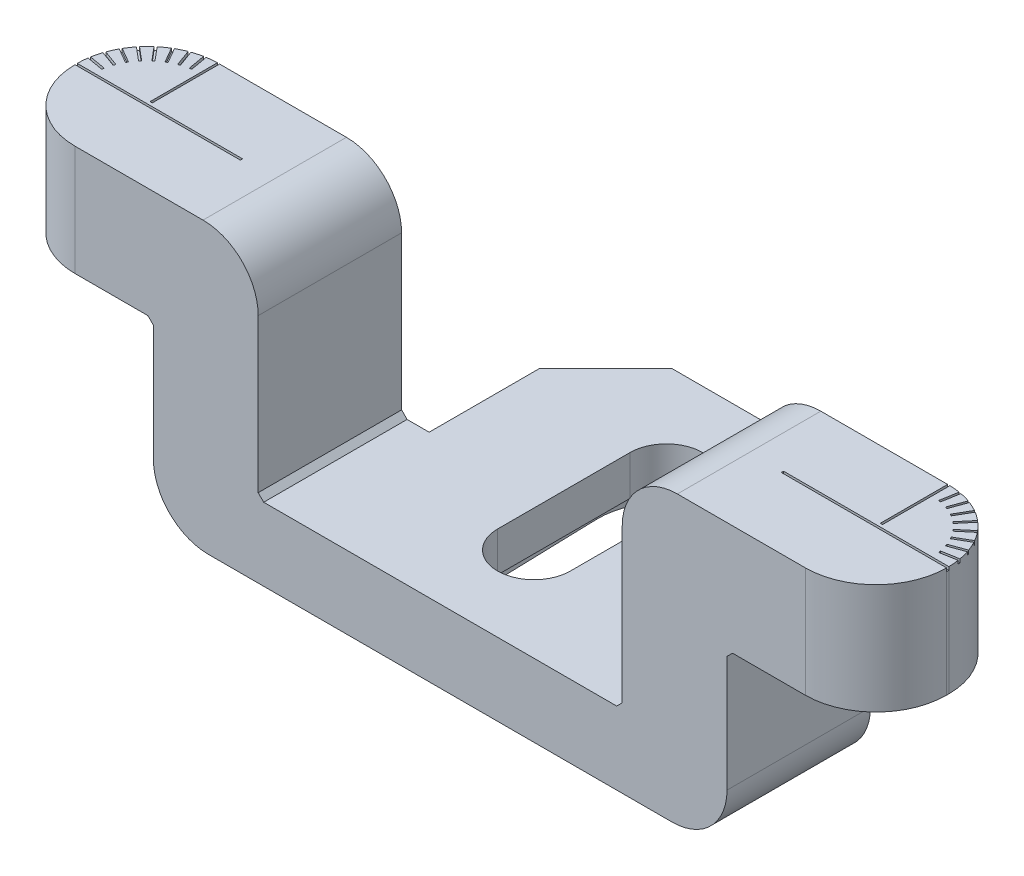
ISO-10303-21;
HEADER;
FILE_DESCRIPTION(('STEP AP214'),'2;1');
FILE_NAME('part.step','',(''),(''),'','','');
FILE_SCHEMA(('AUTOMOTIVE_DESIGN { 1 0 10303 214 1 1 1 1 }'));
ENDSEC;
DATA;
#1=APPLICATION_CONTEXT('core data for automotive mechanical design processes');
#2=APPLICATION_PROTOCOL_DEFINITION('international standard','automotive_design',2000,#1);
#3=PRODUCT_CONTEXT('',#1,'mechanical');
#4=PRODUCT('Part','Part','',(#3));
#5=PRODUCT_RELATED_PRODUCT_CATEGORY('part','',(#4));
#6=PRODUCT_DEFINITION_FORMATION('','',#4);
#7=PRODUCT_DEFINITION_CONTEXT('part definition',#1,'design');
#8=PRODUCT_DEFINITION('design','',#6,#7);
#9=PRODUCT_DEFINITION_SHAPE('','',#8);
#10=(LENGTH_UNIT() NAMED_UNIT(*) SI_UNIT(.MILLI.,.METRE.));
#11=(NAMED_UNIT(*) PLANE_ANGLE_UNIT() SI_UNIT($,.RADIAN.));
#12=(NAMED_UNIT(*) SI_UNIT($,.STERADIAN.) SOLID_ANGLE_UNIT());
#13=UNCERTAINTY_MEASURE_WITH_UNIT(LENGTH_MEASURE(1.E-05),#10,'distance_accuracy_value','');
#14=(GEOMETRIC_REPRESENTATION_CONTEXT(3) GLOBAL_UNCERTAINTY_ASSIGNED_CONTEXT((#13)) GLOBAL_UNIT_ASSIGNED_CONTEXT((#10,
#11,#12)) REPRESENTATION_CONTEXT('',''));
#15=CARTESIAN_POINT('',(0.,0.,0.));
#16=DIRECTION('',(0.,0.,1.));
#17=DIRECTION('',(1.,0.,0.));
#18=AXIS2_PLACEMENT_3D('',#15,#16,#17);
#19=CARTESIAN_POINT('',(0.,20.3,-7.5));
#20=DIRECTION('',(0.,-1.,0.));
#21=DIRECTION('',(1.,0.,0.));
#22=AXIS2_PLACEMENT_3D('',#19,#20,#21);
#23=CYLINDRICAL_SURFACE('',#22,3.3);
#24=CARTESIAN_POINT('',(0.,3.,-7.5));
#25=DIRECTION('',(0.,-1.,0.));
#26=DIRECTION('',(1.,0.,0.));
#27=AXIS2_PLACEMENT_3D('',#24,#25,#26);
#28=CIRCLE('',#27,3.3);
#29=CARTESIAN_POINT('',(3.3,3.,-7.5));
#30=VERTEX_POINT('',#29);
#31=CARTESIAN_POINT('',(-3.3,3.,-7.5));
#32=VERTEX_POINT('',#31);
#33=EDGE_CURVE('E777',#30,#32,#28,.F.);
#34=ORIENTED_EDGE('',*,*,#33,.F.);
#35=DIRECTION('',(0.,-1.,0.));
#36=VECTOR('',#35,1.);
#37=CARTESIAN_POINT('',(3.3,20.3,-7.5));
#38=LINE('',#37,#36);
#39=CARTESIAN_POINT('',(3.3,6.6,-7.5));
#40=VERTEX_POINT('',#39);
#41=EDGE_CURVE('E779',#40,#30,#38,.T.);
#42=ORIENTED_EDGE('',*,*,#41,.F.);
#43=CARTESIAN_POINT('',(0.,6.6,-7.5));
#44=DIRECTION('',(0.,-1.,0.));
#45=DIRECTION('',(0.,0.,-1.));
#46=AXIS2_PLACEMENT_3D('',#43,#44,#45);
#47=CIRCLE('',#46,3.3);
#48=CARTESIAN_POINT('',(-3.3,6.6,-7.5));
#49=VERTEX_POINT('',#48);
#50=EDGE_CURVE('E800',#49,#40,#47,.T.);
#51=ORIENTED_EDGE('',*,*,#50,.F.);
#52=DIRECTION('',(0.,-1.,0.));
#53=VECTOR('',#52,1.);
#54=CARTESIAN_POINT('',(-3.3,20.3,-7.5));
#55=LINE('',#54,#53);
#56=EDGE_CURVE('E780',#49,#32,#55,.T.);
#57=ORIENTED_EDGE('',*,*,#56,.T.);
#58=EDGE_LOOP('',(#34,#42,#51,#57));
#59=FACE_BOUND('',#58,.T.);
#60=ADVANCED_FACE('F18',(#59),#23,.F.);
#61=CARTESIAN_POINT('',(-3.3,20.3,-7.5));
#62=DIRECTION('',(-1.,0.,0.));
#63=DIRECTION('',(0.,0.,1.));
#64=AXIS2_PLACEMENT_3D('',#61,#62,#63);
#65=PLANE('',#64);
#66=DIRECTION('',(0.,0.,1.));
#67=VECTOR('',#66,1.);
#68=CARTESIAN_POINT('',(-3.3,3.,-7.5));
#69=LINE('',#68,#67);
#70=CARTESIAN_POINT('',(-3.3,3.,4.5));
#71=VERTEX_POINT('',#70);
#72=EDGE_CURVE('E775',#32,#71,#69,.T.);
#73=ORIENTED_EDGE('',*,*,#72,.F.);
#74=ORIENTED_EDGE('',*,*,#56,.F.);
#75=DIRECTION('',(0.,0.,-1.));
#76=VECTOR('',#75,1.);
#77=CARTESIAN_POINT('',(-3.3,6.6,13.));
#78=LINE('',#77,#76);
#79=CARTESIAN_POINT('',(-3.3,6.6,4.5));
#80=VERTEX_POINT('',#79);
#81=EDGE_CURVE('E797',#80,#49,#78,.T.);
#82=ORIENTED_EDGE('',*,*,#81,.F.);
#83=DIRECTION('',(0.,-1.,0.));
#84=VECTOR('',#83,1.);
#85=CARTESIAN_POINT('',(-3.3,20.3,4.5));
#86=LINE('',#85,#84);
#87=EDGE_CURVE('E784',#80,#71,#86,.T.);
#88=ORIENTED_EDGE('',*,*,#87,.T.);
#89=EDGE_LOOP('',(#73,#74,#82,#88));
#90=FACE_BOUND('',#89,.T.);
#91=ADVANCED_FACE('F1883',(#90),#65,.F.);
#92=CARTESIAN_POINT('',(0.,20.3,4.5));
#93=DIRECTION('',(0.,-1.,0.));
#94=DIRECTION('',(1.,0.,0.));
#95=AXIS2_PLACEMENT_3D('',#92,#93,#94);
#96=CYLINDRICAL_SURFACE('',#95,3.3);
#97=CARTESIAN_POINT('',(0.,3.,4.5));
#98=DIRECTION('',(0.,-1.,0.));
#99=DIRECTION('',(1.,0.,0.));
#100=AXIS2_PLACEMENT_3D('',#97,#98,#99);
#101=CIRCLE('',#100,3.3);
#102=CARTESIAN_POINT('',(3.3,3.,4.5));
#103=VERTEX_POINT('',#102);
#104=EDGE_CURVE('E40',#71,#103,#101,.F.);
#105=ORIENTED_EDGE('',*,*,#104,.F.);
#106=ORIENTED_EDGE('',*,*,#87,.F.);
#107=CARTESIAN_POINT('',(0.,6.6,4.5));
#108=DIRECTION('',(0.,-1.,0.));
#109=DIRECTION('',(0.,0.,-1.));
#110=AXIS2_PLACEMENT_3D('',#107,#108,#109);
#111=CIRCLE('',#110,3.3);
#112=CARTESIAN_POINT('',(3.3,6.6,4.5));
#113=VERTEX_POINT('',#112);
#114=EDGE_CURVE('E794',#113,#80,#111,.T.);
#115=ORIENTED_EDGE('',*,*,#114,.F.);
#116=DIRECTION('',(0.,-1.,0.));
#117=VECTOR('',#116,1.);
#118=CARTESIAN_POINT('',(3.3,20.3,4.5));
#119=LINE('',#118,#117);
#120=EDGE_CURVE('E787',#113,#103,#119,.T.);
#121=ORIENTED_EDGE('',*,*,#120,.T.);
#122=EDGE_LOOP('',(#105,#106,#115,#121));
#123=FACE_BOUND('',#122,.T.);
#124=ADVANCED_FACE('F1891',(#123),#96,.F.);
#125=CARTESIAN_POINT('',(3.3,20.3,-7.5));
#126=DIRECTION('',(1.,0.,0.));
#127=DIRECTION('',(0.,1.,0.));
#128=AXIS2_PLACEMENT_3D('',#125,#126,#127);
#129=PLANE('',#128);
#130=DIRECTION('',(0.,0.,-1.));
#131=VECTOR('',#130,1.);
#132=CARTESIAN_POINT('',(3.3,3.,-7.5));
#133=LINE('',#132,#131);
#134=EDGE_CURVE('E11',#103,#30,#133,.T.);
#135=ORIENTED_EDGE('',*,*,#134,.F.);
#136=ORIENTED_EDGE('',*,*,#120,.F.);
#137=DIRECTION('',(0.,0.,1.));
#138=VECTOR('',#137,1.);
#139=CARTESIAN_POINT('',(3.3,6.6,13.));
#140=LINE('',#139,#138);
#141=EDGE_CURVE('E783',#40,#113,#140,.T.);
#142=ORIENTED_EDGE('',*,*,#141,.F.);
#143=ORIENTED_EDGE('',*,*,#41,.T.);
#144=EDGE_LOOP('',(#135,#136,#142,#143));
#145=FACE_BOUND('',#144,.T.);
#146=ADVANCED_FACE('F1897',(#145),#129,.F.);
#147=CARTESIAN_POINT('',(0.,0.,0.));
#148=DIRECTION('',(0.,0.,-1.));
#149=DIRECTION('',(-1.,0.,0.));
#150=AXIS2_PLACEMENT_3D('',#147,#148,#149);
#151=PLANE('',#150);
#152=DIRECTION('',(0.,1.,0.));
#153=VECTOR('',#152,1.);
#154=CARTESIAN_POINT('',(-14.,0.,0.));
#155=LINE('',#154,#153);
#156=CARTESIAN_POINT('',(-14.,0.,0.));
#157=VERTEX_POINT('',#156);
#158=CARTESIAN_POINT('',(-14.,6.6,0.));
#159=VERTEX_POINT('',#158);
#160=EDGE_CURVE('E1559',#157,#159,#155,.T.);
#161=ORIENTED_EDGE('',*,*,#160,.F.);
#162=DIRECTION('',(1.,0.,0.));
#163=VECTOR('',#162,1.);
#164=CARTESIAN_POINT('',(0.,0.,0.));
#165=LINE('',#164,#163);
#166=CARTESIAN_POINT('',(-21.,0.,0.));
#167=VERTEX_POINT('',#166);
#168=EDGE_CURVE('E1397',#167,#157,#165,.T.);
#169=ORIENTED_EDGE('',*,*,#168,.F.);
#170=CARTESIAN_POINT('',(-21.,5.,0.));
#171=DIRECTION('',(0.,0.,-1.));
#172=DIRECTION('',(-1.,0.,0.));
#173=AXIS2_PLACEMENT_3D('',#170,#171,#172);
#174=CIRCLE('',#173,5.);
#175=CARTESIAN_POINT('',(-26.,5.,0.));
#176=VERTEX_POINT('',#175);
#177=EDGE_CURVE('E1457',#167,#176,#174,.T.);
#178=ORIENTED_EDGE('',*,*,#177,.T.);
#179=DIRECTION('',(0.,-1.,0.));
#180=VECTOR('',#179,1.);
#181=CARTESIAN_POINT('',(-26.,0.,0.));
#182=LINE('',#181,#180);
#183=CARTESIAN_POINT('',(-26.,15.5,0.));
#184=VERTEX_POINT('',#183);
#185=EDGE_CURVE('E1420',#184,#176,#182,.T.);
#186=ORIENTED_EDGE('',*,*,#185,.F.);
#187=DIRECTION('',(0.707106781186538,-0.707106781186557,0.));
#188=VECTOR('',#187,1.);
#189=CARTESIAN_POINT('',(-26.,15.5,0.));
#190=LINE('',#189,#188);
#191=CARTESIAN_POINT('',(-26.5,16.,0.));
#192=VERTEX_POINT('',#191);
#193=EDGE_CURVE('E1484',#184,#192,#190,.F.);
#194=ORIENTED_EDGE('',*,*,#193,.T.);
#195=DIRECTION('',(1.,0.,0.));
#196=VECTOR('',#195,1.);
#197=CARTESIAN_POINT('',(-26.,16.,0.));
#198=LINE('',#197,#196);
#199=CARTESIAN_POINT('',(-33.1,16.,0.));
#200=VERTEX_POINT('',#199);
#201=EDGE_CURVE('E1417',#200,#192,#198,.T.);
#202=ORIENTED_EDGE('',*,*,#201,.F.);
#203=DIRECTION('',(0.,-1.,0.));
#204=VECTOR('',#203,1.);
#205=CARTESIAN_POINT('',(-33.1,26.,0.));
#206=LINE('',#205,#204);
#207=CARTESIAN_POINT('',(-33.1,25.7,0.));
#208=VERTEX_POINT('',#207);
#209=EDGE_CURVE('E1448',#200,#208,#206,.F.);
#210=ORIENTED_EDGE('',*,*,#209,.T.);
#211=DIRECTION('',(1.,0.,0.));
#212=VECTOR('',#211,1.);
#213=CARTESIAN_POINT('',(0.,25.7,0.));
#214=LINE('',#213,#212);
#215=CARTESIAN_POINT('',(-33.,25.7,0.));
#216=VERTEX_POINT('',#215);
#217=EDGE_CURVE('E1342',#208,#216,#214,.T.);
#218=ORIENTED_EDGE('',*,*,#217,.T.);
#219=DIRECTION('',(0.,-1.,0.));
#220=VECTOR('',#219,1.);
#221=CARTESIAN_POINT('',(-33.,0.,0.));
#222=LINE('',#221,#220);
#223=CARTESIAN_POINT('',(-33.,26.,0.));
#224=VERTEX_POINT('',#223);
#225=EDGE_CURVE('E1554',#224,#216,#222,.T.);
#226=ORIENTED_EDGE('',*,*,#225,.F.);
#227=DIRECTION('',(-1.,0.,0.));
#228=VECTOR('',#227,1.);
#229=CARTESIAN_POINT('',(-39.5,26.,0.));
#230=LINE('',#229,#228);
#231=CARTESIAN_POINT('',(-21.5,26.,0.));
#232=VERTEX_POINT('',#231);
#233=EDGE_CURVE('E1414',#232,#224,#230,.T.);
#234=ORIENTED_EDGE('',*,*,#233,.F.);
#235=CARTESIAN_POINT('',(-21.5,21.,0.));
#236=DIRECTION('',(0.,0.,-1.));
#237=DIRECTION('',(-1.,0.,0.));
#238=AXIS2_PLACEMENT_3D('',#235,#236,#237);
#239=CIRCLE('',#238,5.);
#240=CARTESIAN_POINT('',(-16.5,21.,0.));
#241=VERTEX_POINT('',#240);
#242=EDGE_CURVE('E1454',#232,#241,#239,.T.);
#243=ORIENTED_EDGE('',*,*,#242,.T.);
#244=DIRECTION('',(0.,1.,0.));
#245=VECTOR('',#244,1.);
#246=CARTESIAN_POINT('',(-16.5,26.,0.));
#247=LINE('',#246,#245);
#248=CARTESIAN_POINT('',(-16.5,7.1,0.));
#249=VERTEX_POINT('',#248);
#250=EDGE_CURVE('E1412',#249,#241,#247,.T.);
#251=ORIENTED_EDGE('',*,*,#250,.F.);
#252=DIRECTION('',(-0.707106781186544,0.707106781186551,0.));
#253=VECTOR('',#252,1.);
#254=CARTESIAN_POINT('',(-16.5,7.1,0.));
#255=LINE('',#254,#253);
#256=CARTESIAN_POINT('',(-16.,6.6,0.));
#257=VERTEX_POINT('',#256);
#258=EDGE_CURVE('E1488',#249,#257,#255,.F.);
#259=ORIENTED_EDGE('',*,*,#258,.T.);
#260=DIRECTION('',(-1.,0.,0.));
#261=VECTOR('',#260,1.);
#262=CARTESIAN_POINT('',(-16.5,6.6,0.));
#263=LINE('',#262,#261);
#264=EDGE_CURVE('E1393',#159,#257,#263,.T.);
#265=ORIENTED_EDGE('',*,*,#264,.F.);
#266=EDGE_LOOP('',(#161,#169,#178,#186,#194,#202,#210,#218,#226,#234,#243,#251,#259,#265));
#267=FACE_BOUND('',#266,.T.);
#268=ADVANCED_FACE('F1660',(#267),#151,.T.);
#269=CARTESIAN_POINT('',(-39.5,16.,13.));
#270=DIRECTION('',(1.,0.,0.));
#271=DIRECTION('',(0.,1.,0.));
#272=AXIS2_PLACEMENT_3D('',#269,#270,#271);
#273=PLANE('',#272);
#274=DIRECTION('',(0.,0.,1.));
#275=VECTOR('',#274,1.);
#276=CARTESIAN_POINT('',(-39.5,25.7,13.));
#277=LINE('',#276,#275);
#278=CARTESIAN_POINT('',(-39.5,25.7,6.4));
#279=VERTEX_POINT('',#278);
#280=CARTESIAN_POINT('',(-39.5,25.7,6.6));
#281=VERTEX_POINT('',#280);
#282=EDGE_CURVE('E1384',#279,#281,#277,.T.);
#283=ORIENTED_EDGE('',*,*,#282,.F.);
#284=DIRECTION('',(0.,-1.,0.));
#285=VECTOR('',#284,1.);
#286=CARTESIAN_POINT('',(-39.5,16.,6.4));
#287=LINE('',#286,#285);
#288=CARTESIAN_POINT('',(-39.5,16.,6.4));
#289=VERTEX_POINT('',#288);
#290=EDGE_CURVE('E1434',#279,#289,#287,.T.);
#291=ORIENTED_EDGE('',*,*,#290,.T.);
#292=DIRECTION('',(0.,0.,-1.));
#293=VECTOR('',#292,1.);
#294=CARTESIAN_POINT('',(-39.5,16.,13.));
#295=LINE('',#294,#293);
#296=CARTESIAN_POINT('',(-39.5,16.,6.6));
#297=VERTEX_POINT('',#296);
#298=EDGE_CURVE('E1408',#297,#289,#295,.T.);
#299=ORIENTED_EDGE('',*,*,#298,.F.);
#300=DIRECTION('',(0.,-1.,0.));
#301=VECTOR('',#300,1.);
#302=CARTESIAN_POINT('',(-39.5,16.,6.6));
#303=LINE('',#302,#301);
#304=EDGE_CURVE('E1438',#297,#281,#303,.F.);
#305=ORIENTED_EDGE('',*,*,#304,.T.);
#306=EDGE_LOOP('',(#283,#291,#299,#305));
#307=FACE_BOUND('',#306,.T.);
#308=ADVANCED_FACE('F2943',(#307),#273,.F.);
#309=CARTESIAN_POINT('',(-16.5,6.6,13.));
#310=DIRECTION('',(0.,-1.,0.));
#311=DIRECTION('',(0.,0.,-1.));
#312=AXIS2_PLACEMENT_3D('',#309,#310,#311);
#313=PLANE('',#312);
#314=ORIENTED_EDGE('',*,*,#81,.T.);
#315=ORIENTED_EDGE('',*,*,#50,.T.);
#316=ORIENTED_EDGE('',*,*,#141,.T.);
#317=ORIENTED_EDGE('',*,*,#114,.T.);
#318=EDGE_LOOP('',(#314,#315,#316,#317));
#319=FACE_BOUND('',#318,.T.);
#320=DIRECTION('',(-1.,0.,0.));
#321=VECTOR('',#320,1.);
#322=CARTESIAN_POINT('',(-14.,6.6,-16.));
#323=LINE('',#322,#321);
#324=CARTESIAN_POINT('',(8.,6.6,-16.));
#325=VERTEX_POINT('',#324);
#326=CARTESIAN_POINT('',(-8.,6.6,-16.));
#327=VERTEX_POINT('',#326);
#328=EDGE_CURVE('E807',#325,#327,#323,.T.);
#329=ORIENTED_EDGE('',*,*,#328,.T.);
#330=DIRECTION('',(0.707106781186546,0.,-0.707106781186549));
#331=VECTOR('',#330,1.);
#332=CARTESIAN_POINT('',(-8.,6.6,-16.));
#333=LINE('',#332,#331);
#334=CARTESIAN_POINT('',(-14.,6.6,-10.));
#335=VERTEX_POINT('',#334);
#336=EDGE_CURVE('E1569',#327,#335,#333,.F.);
#337=ORIENTED_EDGE('',*,*,#336,.T.);
#338=DIRECTION('',(0.,0.,1.));
#339=VECTOR('',#338,1.);
#340=CARTESIAN_POINT('',(-14.,6.6,13.));
#341=LINE('',#340,#339);
#342=EDGE_CURVE('E803',#335,#159,#341,.T.);
#343=ORIENTED_EDGE('',*,*,#342,.T.);
#344=ORIENTED_EDGE('',*,*,#264,.T.);
#345=DIRECTION('',(0.,0.,1.));
#346=VECTOR('',#345,1.);
#347=CARTESIAN_POINT('',(-16.,6.6,13.));
#348=LINE('',#347,#346);
#349=CARTESIAN_POINT('',(-16.,6.6,13.));
#350=VERTEX_POINT('',#349);
#351=EDGE_CURVE('E1481',#257,#350,#348,.T.);
#352=ORIENTED_EDGE('',*,*,#351,.T.);
#353=DIRECTION('',(-1.,0.,0.));
#354=VECTOR('',#353,1.);
#355=CARTESIAN_POINT('',(-16.5,6.6,13.));
#356=LINE('',#355,#354);
#357=CARTESIAN_POINT('',(16.,6.6,13.));
#358=VERTEX_POINT('',#357);
#359=EDGE_CURVE('E1394',#358,#350,#356,.T.);
#360=ORIENTED_EDGE('',*,*,#359,.F.);
#361=DIRECTION('',(0.,0.,1.));
#362=VECTOR('',#361,1.);
#363=CARTESIAN_POINT('',(16.,6.6,13.));
#364=LINE('',#363,#362);
#365=CARTESIAN_POINT('',(16.,6.6,0.));
#366=VERTEX_POINT('',#365);
#367=EDGE_CURVE('E1106',#366,#358,#364,.T.);
#368=ORIENTED_EDGE('',*,*,#367,.F.);
#369=CARTESIAN_POINT('',(14.,6.6,0.));
#370=VERTEX_POINT('',#369);
#371=EDGE_CURVE('E1409',#366,#370,#263,.T.);
#372=ORIENTED_EDGE('',*,*,#371,.T.);
#373=DIRECTION('',(0.,0.,-1.));
#374=VECTOR('',#373,1.);
#375=CARTESIAN_POINT('',(14.,6.6,13.));
#376=LINE('',#375,#374);
#377=CARTESIAN_POINT('',(14.,6.6,-10.));
#378=VERTEX_POINT('',#377);
#379=EDGE_CURVE('E815',#370,#378,#376,.T.);
#380=ORIENTED_EDGE('',*,*,#379,.T.);
#381=DIRECTION('',(0.707106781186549,0.,0.707106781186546));
#382=VECTOR('',#381,1.);
#383=CARTESIAN_POINT('',(14.,6.6,-10.));
#384=LINE('',#383,#382);
#385=EDGE_CURVE('E1567',#378,#325,#384,.F.);
#386=ORIENTED_EDGE('',*,*,#385,.T.);
#387=EDGE_LOOP('',(#329,#337,#343,#344,#352,#360,#368,#372,#380,#386));
#388=FACE_BOUND('',#387,.T.);
#389=ADVANCED_FACE('F1585',(#319,#388),#313,.F.);
#390=CARTESIAN_POINT('',(-16.5,26.,13.));
#391=DIRECTION('',(-1.,0.,0.));
#392=DIRECTION('',(0.,-1.,0.));
#393=AXIS2_PLACEMENT_3D('',#390,#391,#392);
#394=PLANE('',#393);
#395=DIRECTION('',(0.,1.,0.));
#396=VECTOR('',#395,1.);
#397=CARTESIAN_POINT('',(-16.5,26.,13.));
#398=LINE('',#397,#396);
#399=CARTESIAN_POINT('',(-16.5,7.1,13.));
#400=VERTEX_POINT('',#399);
#401=CARTESIAN_POINT('',(-16.5,21.,13.));
#402=VERTEX_POINT('',#401);
#403=EDGE_CURVE('E1396',#400,#402,#398,.T.);
#404=ORIENTED_EDGE('',*,*,#403,.F.);
#405=DIRECTION('',(0.,0.,-1.));
#406=VECTOR('',#405,1.);
#407=CARTESIAN_POINT('',(-16.5,7.1,0.));
#408=LINE('',#407,#406);
#409=EDGE_CURVE('E1478',#400,#249,#408,.T.);
#410=ORIENTED_EDGE('',*,*,#409,.T.);
#411=ORIENTED_EDGE('',*,*,#250,.T.);
#412=DIRECTION('',(0.,0.,-1.));
#413=VECTOR('',#412,1.);
#414=CARTESIAN_POINT('',(-16.5,21.,13.));
#415=LINE('',#414,#413);
#416=EDGE_CURVE('E1470',#241,#402,#415,.F.);
#417=ORIENTED_EDGE('',*,*,#416,.T.);
#418=EDGE_LOOP('',(#404,#410,#411,#417));
#419=FACE_BOUND('',#418,.T.);
#420=ADVANCED_FACE('F1671',(#419),#394,.F.);
#421=CARTESIAN_POINT('',(-39.5,26.,13.));
#422=DIRECTION('',(0.,-1.,0.));
#423=DIRECTION('',(0.,0.,-1.));
#424=AXIS2_PLACEMENT_3D('',#421,#422,#423);
#425=PLANE('',#424);
#426=CARTESIAN_POINT('',(-33.1,26.,6.4));
#427=DIRECTION('',(0.,-1.,0.));
#428=DIRECTION('',(0.,0.,-1.));
#429=AXIS2_PLACEMENT_3D('',#426,#427,#428);
#430=CIRCLE('',#429,6.4);
#431=CARTESIAN_POINT('',(-36.4290247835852,26.,0.933959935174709));
#432=VERTEX_POINT('',#431);
#433=CARTESIAN_POINT('',(-37.1864125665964,26.,1.4744307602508));
#434=VERTEX_POINT('',#433);
#435=EDGE_CURVE('E5878',#432,#434,#430,.F.);
#436=ORIENTED_EDGE('',*,*,#435,.T.);
#437=DIRECTION('',(-0.64278760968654,0.,-0.766044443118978));
#438=VECTOR('',#437,1.);
#439=CARTESIAN_POINT('',(-37.454408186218,26.,1.15504601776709));
#440=LINE('',#439,#438);
#441=CARTESIAN_POINT('',(-36.168832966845,26.,2.68713490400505));
#442=VERTEX_POINT('',#441);
#443=EDGE_CURVE('E1250',#442,#434,#440,.T.);
#444=ORIENTED_EDGE('',*,*,#443,.F.);
#445=DIRECTION('',(0.766044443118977,0.,-0.64278760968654));
#446=VECTOR('',#445,1.);
#447=CARTESIAN_POINT('',(-36.168832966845,26.,2.68713490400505));
#448=LINE('',#447,#446);
#449=CARTESIAN_POINT('',(-36.3220418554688,26.,2.81569242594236));
#450=VERTEX_POINT('',#449);
#451=EDGE_CURVE('E1257',#450,#442,#448,.T.);
#452=ORIENTED_EDGE('',*,*,#451,.F.);
#453=DIRECTION('',(0.642787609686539,0.,0.766044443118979));
#454=VECTOR('',#453,1.);
#455=CARTESIAN_POINT('',(-36.3220418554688,26.,2.81569242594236));
#456=LINE('',#455,#454);
#457=CARTESIAN_POINT('',(-37.3383300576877,26.,1.60452730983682));
#458=VERTEX_POINT('',#457);
#459=EDGE_CURVE('E1244',#458,#450,#456,.T.);
#460=ORIENTED_EDGE('',*,*,#459,.F.);
#461=CARTESIAN_POINT('',(-37.9876133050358,26.,2.26826474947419));
#462=VERTEX_POINT('',#461);
#463=EDGE_CURVE('E5875',#458,#462,#430,.F.);
#464=ORIENTED_EDGE('',*,*,#463,.T.);
#465=DIRECTION('',(-0.766044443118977,0.,-0.642787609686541));
#466=VECTOR('',#465,1.);
#467=CARTESIAN_POINT('',(-38.3163964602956,26.,1.99238292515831));
#468=LINE('',#467,#466);
#469=CARTESIAN_POINT('',(-36.7843075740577,26.,3.27795814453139));
#470=VERTEX_POINT('',#469);
#471=EDGE_CURVE('E1269',#470,#462,#468,.T.);
#472=ORIENTED_EDGE('',*,*,#471,.F.);
#473=DIRECTION('',(0.64278760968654,0.,-0.766044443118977));
#474=VECTOR('',#473,1.);
#475=CARTESIAN_POINT('',(-36.7843075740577,26.,3.27795814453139));
#476=LINE('',#475,#474);
#477=CARTESIAN_POINT('',(-36.912865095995,26.,3.43116703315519));
#478=VERTEX_POINT('',#477);
#479=EDGE_CURVE('E1276',#478,#470,#476,.T.);
#480=ORIENTED_EDGE('',*,*,#479,.F.);
#481=DIRECTION('',(0.766044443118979,0.,0.642787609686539));
#482=VECTOR('',#481,1.);
#483=CARTESIAN_POINT('',(-36.912865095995,26.,3.43116703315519));
#484=LINE('',#483,#482);
#485=CARTESIAN_POINT('',(-38.1143366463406,26.,2.42301269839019));
#486=VERTEX_POINT('',#485);
#487=EDGE_CURVE('E1263',#486,#478,#484,.T.);
#488=ORIENTED_EDGE('',*,*,#487,.F.);
#489=CARTESIAN_POINT('',(-38.6358517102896,26.,3.18840447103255));
#490=VERTEX_POINT('',#489);
#491=EDGE_CURVE('E5879',#486,#490,#430,.F.);
#492=ORIENTED_EDGE('',*,*,#491,.T.);
#493=DIRECTION('',(-0.866025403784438,0.,-0.5));
#494=VECTOR('',#493,1.);
#495=CARTESIAN_POINT('',(-39.0198871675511,26.,2.96668149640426));
#496=LINE('',#495,#494);
#497=CARTESIAN_POINT('',(-37.2878363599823,26.,3.96668149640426));
#498=VERTEX_POINT('',#497);
#499=EDGE_CURVE('E1288',#498,#490,#496,.T.);
#500=ORIENTED_EDGE('',*,*,#499,.F.);
#501=DIRECTION('',(0.499999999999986,0.,-0.866025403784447));
#502=VECTOR('',#501,1.);
#503=CARTESIAN_POINT('',(-37.2878363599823,26.,3.96668149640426));
#504=LINE('',#503,#502);
#505=CARTESIAN_POINT('',(-37.3878363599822,26.,4.13988657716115));
#506=VERTEX_POINT('',#505);
#507=EDGE_CURVE('E1295',#506,#498,#504,.T.);
#508=ORIENTED_EDGE('',*,*,#507,.F.);
#509=DIRECTION('',(0.866025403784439,0.,0.5));
#510=VECTOR('',#509,1.);
#511=CARTESIAN_POINT('',(-37.3878363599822,26.,4.13988657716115));
#512=LINE('',#511,#510);
#513=CARTESIAN_POINT('',(-38.7335074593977,26.,3.36296300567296));
#514=VERTEX_POINT('',#513);
#515=EDGE_CURVE('E1282',#514,#506,#512,.T.);
#516=ORIENTED_EDGE('',*,*,#515,.F.);
#517=CARTESIAN_POINT('',(-39.1119674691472,26.,4.20540501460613));
#518=VERTEX_POINT('',#517);
#519=EDGE_CURVE('E5882',#514,#518,#430,.F.);
#520=ORIENTED_EDGE('',*,*,#519,.T.);
#521=DIRECTION('',(-0.939692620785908,0.,-0.342020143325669));
#522=VECTOR('',#521,1.);
#523=CARTESIAN_POINT('',(-39.5435050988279,26.,4.04833816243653));
#524=LINE('',#523,#522);
#525=CARTESIAN_POINT('',(-37.6641198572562,26.,4.73237844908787));
#526=VERTEX_POINT('',#525);
#527=EDGE_CURVE('E1307',#526,#518,#524,.T.);
#528=ORIENTED_EDGE('',*,*,#527,.F.);
#529=DIRECTION('',(0.342020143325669,0.,-0.939692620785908));
#530=VECTOR('',#529,1.);
#531=CARTESIAN_POINT('',(-37.6641198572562,26.,4.73237844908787));
#532=LINE('',#531,#530);
#533=CARTESIAN_POINT('',(-37.7325238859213,26.,4.92031697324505));
#534=VERTEX_POINT('',#533);
#535=EDGE_CURVE('E1314',#534,#526,#532,.T.);
#536=ORIENTED_EDGE('',*,*,#535,.F.);
#537=DIRECTION('',(0.939692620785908,0.,0.342020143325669));
#538=VECTOR('',#537,1.);
#539=CARTESIAN_POINT('',(-37.7325238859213,26.,4.92031697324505));
#540=LINE('',#539,#538);
#541=CARTESIAN_POINT('',(-39.1776114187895,26.,4.39434812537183));
#542=VERTEX_POINT('',#541);
#543=EDGE_CURVE('E1301',#542,#534,#540,.T.);
#544=ORIENTED_EDGE('',*,*,#543,.F.);
#545=CARTESIAN_POINT('',(-39.4025056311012,26.,5.28715554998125));
#546=VERTEX_POINT('',#545);
#547=EDGE_CURVE('E1443',#542,#546,#430,.F.);
#548=ORIENTED_EDGE('',*,*,#547,.T.);
#549=DIRECTION('',(-0.984807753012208,0.,-0.17364817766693));
#550=VECTOR('',#549,1.);
#551=CARTESIAN_POINT('',(-39.8713403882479,26.,5.2044873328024));
#552=LINE('',#551,#550);
#553=CARTESIAN_POINT('',(-37.9017248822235,26.,5.55178368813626));
#554=VERTEX_POINT('',#553);
#555=EDGE_CURVE('E1348',#554,#546,#552,.T.);
#556=ORIENTED_EDGE('',*,*,#555,.F.);
#557=DIRECTION('',(0.173648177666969,0.,-0.984807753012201));
#558=VECTOR('',#557,1.);
#559=CARTESIAN_POINT('',(-37.9017248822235,26.,5.55178368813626));
#560=LINE('',#559,#558);
#561=CARTESIAN_POINT('',(-37.9364545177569,26.,5.7487452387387));
#562=VERTEX_POINT('',#561);
#563=EDGE_CURVE('E1355',#562,#554,#560,.T.);
#564=ORIENTED_EDGE('',*,*,#563,.F.);
#565=DIRECTION('',(0.984807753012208,0.,0.17364817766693));
#566=VECTOR('',#565,1.);
#567=CARTESIAN_POINT('',(-37.9364545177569,26.,5.7487452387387));
#568=LINE('',#567,#566);
#569=CARTESIAN_POINT('',(-39.4342037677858,26.,5.48465163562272));
#570=VERTEX_POINT('',#569);
#571=EDGE_CURVE('E1320',#570,#562,#568,.T.);
#572=ORIENTED_EDGE('',*,*,#571,.F.);
#573=CARTESIAN_POINT('',(-39.5,26.,6.4));
#574=VERTEX_POINT('',#573);
#575=EDGE_CURVE('E1441',#570,#574,#430,.F.);
#576=ORIENTED_EDGE('',*,*,#575,.T.);
#577=DIRECTION('',(-1.,0.,0.));
#578=VECTOR('',#577,1.);
#579=CARTESIAN_POINT('',(-41.6808657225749,26.,6.4));
#580=LINE('',#579,#578);
#581=CARTESIAN_POINT('',(-24.519134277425,26.,6.4));
#582=VERTEX_POINT('',#581);
#583=EDGE_CURVE('E1377',#582,#574,#580,.T.);
#584=ORIENTED_EDGE('',*,*,#583,.F.);
#585=DIRECTION('',(0.,0.,-1.));
#586=VECTOR('',#585,1.);
#587=CARTESIAN_POINT('',(-24.519134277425,26.,6.4));
#588=LINE('',#587,#586);
#589=CARTESIAN_POINT('',(-24.519134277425,26.,6.6));
#590=VERTEX_POINT('',#589);
#591=EDGE_CURVE('E1364',#590,#582,#588,.T.);
#592=ORIENTED_EDGE('',*,*,#591,.F.);
#593=DIRECTION('',(1.,0.,0.));
#594=VECTOR('',#593,1.);
#595=CARTESIAN_POINT('',(-41.6808657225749,26.,6.6));
#596=LINE('',#595,#594);
#597=CARTESIAN_POINT('',(-39.5,26.,6.6));
#598=VERTEX_POINT('',#597);
#599=EDGE_CURVE('E1369',#598,#590,#596,.T.);
#600=ORIENTED_EDGE('',*,*,#599,.F.);
#601=CARTESIAN_POINT('',(-33.1,26.,6.6));
#602=DIRECTION('',(0.,-1.,0.));
#603=DIRECTION('',(0.,0.,-1.));
#604=AXIS2_PLACEMENT_3D('',#601,#602,#603);
#605=CIRCLE('',#604,6.4);
#606=CARTESIAN_POINT('',(-33.1,26.,13.));
#607=VERTEX_POINT('',#606);
#608=EDGE_CURVE('E1445',#598,#607,#605,.F.);
#609=ORIENTED_EDGE('',*,*,#608,.T.);
#610=DIRECTION('',(-1.,0.,0.));
#611=VECTOR('',#610,1.);
#612=CARTESIAN_POINT('',(-39.5,26.,13.));
#613=LINE('',#612,#611);
#614=CARTESIAN_POINT('',(-21.5,26.,13.));
#615=VERTEX_POINT('',#614);
#616=EDGE_CURVE('E1399',#615,#607,#613,.T.);
#617=ORIENTED_EDGE('',*,*,#616,.F.);
#618=DIRECTION('',(0.,0.,-1.));
#619=VECTOR('',#618,1.);
#620=CARTESIAN_POINT('',(-21.5,26.,13.));
#621=LINE('',#620,#619);
#622=EDGE_CURVE('E1467',#615,#232,#621,.T.);
#623=ORIENTED_EDGE('',*,*,#622,.T.);
#624=ORIENTED_EDGE('',*,*,#233,.T.);
#625=DIRECTION('',(0.,0.,-1.));
#626=VECTOR('',#625,1.);
#627=CARTESIAN_POINT('',(-33.,26.,-2.88286754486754));
#628=LINE('',#627,#626);
#629=CARTESIAN_POINT('',(-33.,26.,6.10044405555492));
#630=VERTEX_POINT('',#629);
#631=EDGE_CURVE('E1333',#630,#224,#628,.T.);
#632=ORIENTED_EDGE('',*,*,#631,.F.);
#633=DIRECTION('',(1.,0.,0.));
#634=VECTOR('',#633,1.);
#635=CARTESIAN_POINT('',(-33.2,26.,6.10044405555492));
#636=LINE('',#635,#634);
#637=CARTESIAN_POINT('',(-33.2,26.,6.10044405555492));
#638=VERTEX_POINT('',#637);
#639=EDGE_CURVE('E1327',#638,#630,#636,.T.);
#640=ORIENTED_EDGE('',*,*,#639,.F.);
#641=DIRECTION('',(0.,0.,1.));
#642=VECTOR('',#641,1.);
#643=CARTESIAN_POINT('',(-33.2,26.,-2.88286754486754));
#644=LINE('',#643,#642);
#645=CARTESIAN_POINT('',(-33.2,26.,0.000781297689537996));
#646=VERTEX_POINT('',#645);
#647=EDGE_CURVE('E1335',#646,#638,#644,.T.);
#648=ORIENTED_EDGE('',*,*,#647,.F.);
#649=CARTESIAN_POINT('',(-34.1298759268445,26.,0.0834063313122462));
#650=VERTEX_POINT('',#649);
#651=EDGE_CURVE('E1444',#646,#650,#430,.F.);
#652=ORIENTED_EDGE('',*,*,#651,.T.);
#653=DIRECTION('',(-0.173648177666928,0.,-0.984807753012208));
#654=VECTOR('',#653,1.);
#655=CARTESIAN_POINT('',(-34.1985511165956,26.,-0.306070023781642));
#656=LINE('',#655,#654);
#657=CARTESIAN_POINT('',(-33.8512547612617,26.,1.66354548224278));
#658=VERTEX_POINT('',#657);
#659=EDGE_CURVE('E1214',#658,#650,#656,.T.);
#660=ORIENTED_EDGE('',*,*,#659,.F.);
#661=DIRECTION('',(0.984807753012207,0.,-0.173648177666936));
#662=VECTOR('',#661,1.);
#663=CARTESIAN_POINT('',(-33.8512547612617,26.,1.66354548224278));
#664=LINE('',#663,#662);
#665=CARTESIAN_POINT('',(-34.0482163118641,26.,1.69827511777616));
#666=VERTEX_POINT('',#665);
#667=EDGE_CURVE('E1221',#666,#658,#664,.T.);
#668=ORIENTED_EDGE('',*,*,#667,.F.);
#669=DIRECTION('',(0.173648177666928,0.,0.984807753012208));
#670=VECTOR('',#669,1.);
#671=CARTESIAN_POINT('',(-34.0482163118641,26.,1.69827511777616));
#672=LINE('',#671,#670);
#673=CARTESIAN_POINT('',(-34.326743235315,26.,0.118670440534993));
#674=VERTEX_POINT('',#673);
#675=EDGE_CURVE('E1189',#674,#666,#672,.T.);
#676=ORIENTED_EDGE('',*,*,#675,.F.);
#677=CARTESIAN_POINT('',(-35.226983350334,26.,0.363780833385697));
#678=VERTEX_POINT('',#677);
#679=EDGE_CURVE('E5930',#674,#678,#430,.F.);
#680=ORIENTED_EDGE('',*,*,#679,.T.);
#681=DIRECTION('',(-0.342020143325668,0.,-0.939692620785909));
#682=VECTOR('',#681,1.);
#683=CARTESIAN_POINT('',(-35.3637233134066,26.,-0.0119091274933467));
#684=LINE('',#683,#682);
#685=CARTESIAN_POINT('',(-34.6796830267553,26.,1.86747611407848));
#686=VERTEX_POINT('',#685);
#687=EDGE_CURVE('E1193',#686,#678,#684,.T.);
#688=ORIENTED_EDGE('',*,*,#687,.F.);
#689=DIRECTION('',(0.939692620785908,0.,-0.342020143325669));
#690=VECTOR('',#689,1.);
#691=CARTESIAN_POINT('',(-34.6796830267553,26.,1.86747611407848));
#692=LINE('',#691,#690);
#693=CARTESIAN_POINT('',(-34.8676215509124,26.,1.93588014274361));
#694=VERTEX_POINT('',#693);
#695=EDGE_CURVE('E1201',#694,#686,#692,.T.);
#696=ORIENTED_EDGE('',*,*,#695,.F.);
#697=DIRECTION('',(0.342020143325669,0.,0.939692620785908));
#698=VECTOR('',#697,1.);
#699=CARTESIAN_POINT('',(-34.8676215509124,26.,1.93588014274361));
#700=LINE('',#699,#698);
#701=CARTESIAN_POINT('',(-35.4145562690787,26.,0.433189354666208));
#702=VERTEX_POINT('',#701);
#703=EDGE_CURVE('E1199',#702,#694,#700,.T.);
#704=ORIENTED_EDGE('',*,*,#703,.F.);
#705=CARTESIAN_POINT('',(-36.2566010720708,26.,0.832606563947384));
#706=VERTEX_POINT('',#705);
#707=EDGE_CURVE('E5880',#702,#706,#430,.F.);
#708=ORIENTED_EDGE('',*,*,#707,.T.);
#709=DIRECTION('',(-0.5,0.,-0.866025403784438));
#710=VECTOR('',#709,1.);
#711=CARTESIAN_POINT('',(-36.4601134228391,26.,0.480112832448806));
#712=LINE('',#711,#710);
#713=CARTESIAN_POINT('',(-35.4601134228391,26.,2.21216364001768));
#714=VERTEX_POINT('',#713);
#715=EDGE_CURVE('E1231',#714,#706,#712,.T.);
#716=ORIENTED_EDGE('',*,*,#715,.F.);
#717=DIRECTION('',(0.866025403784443,0.,-0.499999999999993));
#718=VECTOR('',#717,1.);
#719=CARTESIAN_POINT('',(-35.4601134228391,26.,2.21216364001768));
#720=LINE('',#719,#718);
#721=CARTESIAN_POINT('',(-35.633318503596,26.,2.31216364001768));
#722=VERTEX_POINT('',#721);
#723=EDGE_CURVE('E1238',#722,#714,#720,.T.);
#724=ORIENTED_EDGE('',*,*,#723,.F.);
#725=DIRECTION('',(0.5,0.,0.866025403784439));
#726=VECTOR('',#725,1.);
#727=CARTESIAN_POINT('',(-35.633318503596,26.,2.31216364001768));
#728=LINE('',#727,#726);
#729=EDGE_CURVE('E1208',#432,#722,#728,.T.);
#730=ORIENTED_EDGE('',*,*,#729,.F.);
#731=EDGE_LOOP('',(#436,#444,#452,#460,#464,#472,#480,#488,#492,#500,#508,#516,#520,#528,#536,
#544,#548,#556,#564,#572,#576,#584,#592,#600,#609,#617,#623,#624,#632,#640,#648,#652,#660,#668,
#676,#680,#688,#696,#704,#708,#716,#724,#730));
#732=FACE_BOUND('',#731,.T.);
#733=ADVANCED_FACE('F1680',(#732),#425,.F.);
#734=CARTESIAN_POINT('',(-26.,16.,13.));
#735=DIRECTION('',(0.,1.,0.));
#736=DIRECTION('',(0.,0.,1.));
#737=AXIS2_PLACEMENT_3D('',#734,#735,#736);
#738=PLANE('',#737);
#739=CARTESIAN_POINT('',(-33.,16.,6.5));
#740=DIRECTION('',(0.,-1.,0.));
#741=DIRECTION('',(0.,0.,-1.));
#742=AXIS2_PLACEMENT_3D('',#739,#740,#741);
#743=CIRCLE('',#742,2.1);
#744=CARTESIAN_POINT('',(-33.,16.,4.4));
#745=VERTEX_POINT('',#744);
#746=EDGE_CURVE('E1387',#745,#745,#743,.T.);
#747=ORIENTED_EDGE('',*,*,#746,.F.);
#748=EDGE_LOOP('',(#747));
#749=FACE_BOUND('',#748,.T.);
#750=ORIENTED_EDGE('',*,*,#201,.T.);
#751=DIRECTION('',(0.,0.,1.));
#752=VECTOR('',#751,1.);
#753=CARTESIAN_POINT('',(-26.5,16.,13.));
#754=LINE('',#753,#752);
#755=CARTESIAN_POINT('',(-26.5,16.,13.));
#756=VERTEX_POINT('',#755);
#757=EDGE_CURVE('E1476',#192,#756,#754,.T.);
#758=ORIENTED_EDGE('',*,*,#757,.T.);
#759=DIRECTION('',(1.,0.,0.));
#760=VECTOR('',#759,1.);
#761=CARTESIAN_POINT('',(-26.,16.,13.));
#762=LINE('',#761,#760);
#763=CARTESIAN_POINT('',(-33.1,16.,13.));
#764=VERTEX_POINT('',#763);
#765=EDGE_CURVE('E1401',#764,#756,#762,.T.);
#766=ORIENTED_EDGE('',*,*,#765,.F.);
#767=CARTESIAN_POINT('',(-33.1,16.,6.6));
#768=DIRECTION('',(0.,1.,0.));
#769=DIRECTION('',(0.,0.,1.));
#770=AXIS2_PLACEMENT_3D('',#767,#768,#769);
#771=CIRCLE('',#770,6.4);
#772=EDGE_CURVE('E1432',#764,#297,#771,.F.);
#773=ORIENTED_EDGE('',*,*,#772,.T.);
#774=ORIENTED_EDGE('',*,*,#298,.T.);
#775=CARTESIAN_POINT('',(-33.1,16.,6.4));
#776=DIRECTION('',(0.,1.,0.));
#777=DIRECTION('',(0.,0.,1.));
#778=AXIS2_PLACEMENT_3D('',#775,#776,#777);
#779=CIRCLE('',#778,6.4);
#780=EDGE_CURVE('E1430',#289,#200,#779,.F.);
#781=ORIENTED_EDGE('',*,*,#780,.T.);
#782=EDGE_LOOP('',(#750,#758,#766,#773,#774,#781));
#783=FACE_BOUND('',#782,.T.);
#784=ADVANCED_FACE('F1693',(#749,#783),#738,.F.);
#785=CARTESIAN_POINT('',(-26.,0.,13.));
#786=DIRECTION('',(1.,0.,0.));
#787=DIRECTION('',(0.,0.,-1.));
#788=AXIS2_PLACEMENT_3D('',#785,#786,#787);
#789=PLANE('',#788);
#790=DIRECTION('',(0.,-1.,0.));
#791=VECTOR('',#790,1.);
#792=CARTESIAN_POINT('',(-26.,0.,13.));
#793=LINE('',#792,#791);
#794=CARTESIAN_POINT('',(-26.,15.5,13.));
#795=VERTEX_POINT('',#794);
#796=CARTESIAN_POINT('',(-26.,5.,13.));
#797=VERTEX_POINT('',#796);
#798=EDGE_CURVE('E1404',#795,#797,#793,.T.);
#799=ORIENTED_EDGE('',*,*,#798,.F.);
#800=DIRECTION('',(0.,0.,-1.));
#801=VECTOR('',#800,1.);
#802=CARTESIAN_POINT('',(-26.,15.5,0.));
#803=LINE('',#802,#801);
#804=EDGE_CURVE('E1473',#795,#184,#803,.T.);
#805=ORIENTED_EDGE('',*,*,#804,.T.);
#806=ORIENTED_EDGE('',*,*,#185,.T.);
#807=DIRECTION('',(0.,0.,-1.));
#808=VECTOR('',#807,1.);
#809=CARTESIAN_POINT('',(-26.,5.,13.));
#810=LINE('',#809,#808);
#811=EDGE_CURVE('E1460',#176,#797,#810,.F.);
#812=ORIENTED_EDGE('',*,*,#811,.T.);
#813=EDGE_LOOP('',(#799,#805,#806,#812));
#814=FACE_BOUND('',#813,.T.);
#815=ADVANCED_FACE('F1702',(#814),#789,.F.);
#816=CARTESIAN_POINT('',(0.,0.,13.));
#817=DIRECTION('',(0.,1.,0.));
#818=DIRECTION('',(-1.,0.,0.));
#819=AXIS2_PLACEMENT_3D('',#816,#817,#818);
#820=PLANE('',#819);
#821=DIRECTION('',(0.0287133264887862,0.,0.999587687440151));
#822=VECTOR('',#821,1.);
#823=CARTESIAN_POINT('',(5.82517510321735,0.,-7.67227995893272));
#824=LINE('',#823,#822);
#825=CARTESIAN_POINT('',(5.82517510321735,0.,-7.67227995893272));
#826=VERTEX_POINT('',#825);
#827=CARTESIAN_POINT('',(6.16987714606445,0.,4.32772004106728));
#828=VERTEX_POINT('',#827);
#829=EDGE_CURVE('E765',#826,#828,#824,.T.);
#830=ORIENTED_EDGE('',*,*,#829,.F.);
#831=CARTESIAN_POINT('',(-0.172351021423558,0.,-7.5));
#832=DIRECTION('',(0.,-1.,0.));
#833=DIRECTION('',(1.,0.,0.));
#834=AXIS2_PLACEMENT_3D('',#831,#832,#833);
#835=CIRCLE('',#834,6.);
#836=CARTESIAN_POINT('',(-6.16987714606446,0.,-7.32772004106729));
#837=VERTEX_POINT('',#836);
#838=EDGE_CURVE('E33',#837,#826,#835,.T.);
#839=ORIENTED_EDGE('',*,*,#838,.F.);
#840=DIRECTION('',(-0.0287133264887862,0.,-0.999587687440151));
#841=VECTOR('',#840,1.);
#842=CARTESIAN_POINT('',(-6.16987714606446,0.,-7.32772004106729));
#843=LINE('',#842,#841);
#844=CARTESIAN_POINT('',(-5.82517510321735,0.,4.67227995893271));
#845=VERTEX_POINT('',#844);
#846=EDGE_CURVE('E756',#845,#837,#843,.T.);
#847=ORIENTED_EDGE('',*,*,#846,.F.);
#848=CARTESIAN_POINT('',(0.172351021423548,0.,4.5));
#849=DIRECTION('',(0.,-1.,0.));
#850=DIRECTION('',(1.,0.,0.));
#851=AXIS2_PLACEMENT_3D('',#848,#849,#850);
#852=CIRCLE('',#851,6.);
#853=EDGE_CURVE('E759',#828,#845,#852,.T.);
#854=ORIENTED_EDGE('',*,*,#853,.F.);
#855=EDGE_LOOP('',(#830,#839,#847,#854));
#856=FACE_BOUND('',#855,.T.);
#857=DIRECTION('',(0.,0.,-1.));
#858=VECTOR('',#857,1.);
#859=CARTESIAN_POINT('',(-14.,0.,13.));
#860=LINE('',#859,#858);
#861=CARTESIAN_POINT('',(-14.,0.,-10.));
#862=VERTEX_POINT('',#861);
#863=EDGE_CURVE('E810',#157,#862,#860,.T.);
#864=ORIENTED_EDGE('',*,*,#863,.T.);
#865=DIRECTION('',(-0.707106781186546,0.,0.707106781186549));
#866=VECTOR('',#865,1.);
#867=CARTESIAN_POINT('',(-8.,0.,-16.));
#868=LINE('',#867,#866);
#869=CARTESIAN_POINT('',(-8.,0.,-16.));
#870=VERTEX_POINT('',#869);
#871=EDGE_CURVE('E1575',#862,#870,#868,.F.);
#872=ORIENTED_EDGE('',*,*,#871,.T.);
#873=DIRECTION('',(1.,0.,0.));
#874=VECTOR('',#873,1.);
#875=CARTESIAN_POINT('',(-14.,0.,-16.));
#876=LINE('',#875,#874);
#877=CARTESIAN_POINT('',(8.,0.,-16.));
#878=VERTEX_POINT('',#877);
#879=EDGE_CURVE('E806',#870,#878,#876,.T.);
#880=ORIENTED_EDGE('',*,*,#879,.T.);
#881=DIRECTION('',(-0.707106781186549,0.,-0.707106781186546));
#882=VECTOR('',#881,1.);
#883=CARTESIAN_POINT('',(14.,0.,-10.));
#884=LINE('',#883,#882);
#885=CARTESIAN_POINT('',(14.,0.,-10.));
#886=VERTEX_POINT('',#885);
#887=EDGE_CURVE('E1573',#878,#886,#884,.F.);
#888=ORIENTED_EDGE('',*,*,#887,.T.);
#889=DIRECTION('',(0.,0.,1.));
#890=VECTOR('',#889,1.);
#891=CARTESIAN_POINT('',(14.,0.,13.));
#892=LINE('',#891,#890);
#893=CARTESIAN_POINT('',(14.,0.,0.));
#894=VERTEX_POINT('',#893);
#895=EDGE_CURVE('E804',#886,#894,#892,.T.);
#896=ORIENTED_EDGE('',*,*,#895,.T.);
#897=CARTESIAN_POINT('',(21.,0.,0.));
#898=VERTEX_POINT('',#897);
#899=EDGE_CURVE('E1422',#894,#898,#165,.T.);
#900=ORIENTED_EDGE('',*,*,#899,.T.);
#901=DIRECTION('',(0.,0.,-1.));
#902=VECTOR('',#901,1.);
#903=CARTESIAN_POINT('',(21.,0.,13.));
#904=LINE('',#903,#902);
#905=CARTESIAN_POINT('',(21.,0.,13.));
#906=VERTEX_POINT('',#905);
#907=EDGE_CURVE('E1076',#906,#898,#904,.T.);
#908=ORIENTED_EDGE('',*,*,#907,.F.);
#909=DIRECTION('',(1.,0.,0.));
#910=VECTOR('',#909,1.);
#911=CARTESIAN_POINT('',(0.,0.,13.));
#912=LINE('',#911,#910);
#913=CARTESIAN_POINT('',(-21.,0.,13.));
#914=VERTEX_POINT('',#913);
#915=EDGE_CURVE('E1406',#914,#906,#912,.T.);
#916=ORIENTED_EDGE('',*,*,#915,.F.);
#917=DIRECTION('',(0.,0.,-1.));
#918=VECTOR('',#917,1.);
#919=CARTESIAN_POINT('',(-21.,0.,13.));
#920=LINE('',#919,#918);
#921=EDGE_CURVE('E1451',#914,#167,#920,.T.);
#922=ORIENTED_EDGE('',*,*,#921,.T.);
#923=ORIENTED_EDGE('',*,*,#168,.T.);
#924=EDGE_LOOP('',(#864,#872,#880,#888,#896,#900,#908,#916,#922,#923));
#925=FACE_BOUND('',#924,.T.);
#926=ADVANCED_FACE('F1642',(#856,#925),#820,.F.);
#927=CARTESIAN_POINT('',(0.,0.,13.));
#928=DIRECTION('',(0.,0.,-1.));
#929=DIRECTION('',(-1.,0.,0.));
#930=AXIS2_PLACEMENT_3D('',#927,#928,#929);
#931=PLANE('',#930);
#932=ORIENTED_EDGE('',*,*,#359,.T.);
#933=DIRECTION('',(0.707106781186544,-0.707106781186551,0.));
#934=VECTOR('',#933,1.);
#935=CARTESIAN_POINT('',(-4.70000000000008,-4.7,13.));
#936=LINE('',#935,#934);
#937=EDGE_CURVE('E1491',#350,#400,#936,.F.);
#938=ORIENTED_EDGE('',*,*,#937,.T.);
#939=ORIENTED_EDGE('',*,*,#403,.T.);
#940=CARTESIAN_POINT('',(-21.5,21.,13.));
#941=DIRECTION('',(0.,0.,-1.));
#942=DIRECTION('',(-1.,0.,0.));
#943=AXIS2_PLACEMENT_3D('',#940,#941,#942);
#944=CIRCLE('',#943,5.);
#945=EDGE_CURVE('E1463',#402,#615,#944,.F.);
#946=ORIENTED_EDGE('',*,*,#945,.T.);
#947=ORIENTED_EDGE('',*,*,#616,.T.);
#948=DIRECTION('',(0.,-1.,0.));
#949=VECTOR('',#948,1.);
#950=CARTESIAN_POINT('',(-33.1,0.,13.));
#951=LINE('',#950,#949);
#952=EDGE_CURVE('E1427',#607,#764,#951,.T.);
#953=ORIENTED_EDGE('',*,*,#952,.T.);
#954=ORIENTED_EDGE('',*,*,#765,.T.);
#955=DIRECTION('',(-0.707106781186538,0.707106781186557,0.));
#956=VECTOR('',#955,1.);
#957=CARTESIAN_POINT('',(-5.25000000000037,-5.25000000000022,13.));
#958=LINE('',#957,#956);
#959=EDGE_CURVE('E1486',#756,#795,#958,.F.);
#960=ORIENTED_EDGE('',*,*,#959,.T.);
#961=ORIENTED_EDGE('',*,*,#798,.T.);
#962=CARTESIAN_POINT('',(-21.,5.,13.));
#963=DIRECTION('',(0.,0.,-1.));
#964=DIRECTION('',(-1.,0.,0.));
#965=AXIS2_PLACEMENT_3D('',#962,#963,#964);
#966=CIRCLE('',#965,5.);
#967=EDGE_CURVE('E1465',#797,#914,#966,.F.);
#968=ORIENTED_EDGE('',*,*,#967,.T.);
#969=ORIENTED_EDGE('',*,*,#915,.T.);
#970=CARTESIAN_POINT('',(21.,5.,13.));
#971=DIRECTION('',(0.,0.,1.));
#972=DIRECTION('',(1.,0.,0.));
#973=AXIS2_PLACEMENT_3D('',#970,#971,#972);
#974=CIRCLE('',#973,5.);
#975=CARTESIAN_POINT('',(26.,5.,13.));
#976=VERTEX_POINT('',#975);
#977=EDGE_CURVE('E1088',#976,#906,#974,.F.);
#978=ORIENTED_EDGE('',*,*,#977,.F.);
#979=DIRECTION('',(0.,-1.,0.));
#980=VECTOR('',#979,1.);
#981=CARTESIAN_POINT('',(26.,0.,13.));
#982=LINE('',#981,#980);
#983=CARTESIAN_POINT('',(26.,15.5,13.));
#984=VERTEX_POINT('',#983);
#985=EDGE_CURVE('E1034',#984,#976,#982,.T.);
#986=ORIENTED_EDGE('',*,*,#985,.F.);
#987=DIRECTION('',(0.707106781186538,0.707106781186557,0.));
#988=VECTOR('',#987,1.);
#989=CARTESIAN_POINT('',(5.25000000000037,-5.25000000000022,13.));
#990=LINE('',#989,#988);
#991=CARTESIAN_POINT('',(26.5,16.,13.));
#992=VERTEX_POINT('',#991);
#993=EDGE_CURVE('E1111',#992,#984,#990,.F.);
#994=ORIENTED_EDGE('',*,*,#993,.F.);
#995=DIRECTION('',(-1.,0.,0.));
#996=VECTOR('',#995,1.);
#997=CARTESIAN_POINT('',(26.,16.,13.));
#998=LINE('',#997,#996);
#999=CARTESIAN_POINT('',(33.1,16.,13.));
#1000=VERTEX_POINT('',#999);
#1001=EDGE_CURVE('E1031',#1000,#992,#998,.T.);
#1002=ORIENTED_EDGE('',*,*,#1001,.F.);
#1003=DIRECTION('',(0.,-1.,0.));
#1004=VECTOR('',#1003,1.);
#1005=CARTESIAN_POINT('',(33.1,0.,13.));
#1006=LINE('',#1005,#1004);
#1007=CARTESIAN_POINT('',(33.1,26.,13.));
#1008=VERTEX_POINT('',#1007);
#1009=EDGE_CURVE('E1050',#1008,#1000,#1006,.T.);
#1010=ORIENTED_EDGE('',*,*,#1009,.F.);
#1011=DIRECTION('',(1.,0.,0.));
#1012=VECTOR('',#1011,1.);
#1013=CARTESIAN_POINT('',(39.5,26.,13.));
#1014=LINE('',#1013,#1012);
#1015=CARTESIAN_POINT('',(21.5,26.,13.));
#1016=VERTEX_POINT('',#1015);
#1017=EDGE_CURVE('E1027',#1016,#1008,#1014,.T.);
#1018=ORIENTED_EDGE('',*,*,#1017,.F.);
#1019=CARTESIAN_POINT('',(21.5,21.,13.));
#1020=DIRECTION('',(0.,0.,1.));
#1021=DIRECTION('',(1.,0.,0.));
#1022=AXIS2_PLACEMENT_3D('',#1019,#1020,#1021);
#1023=CIRCLE('',#1022,5.);
#1024=CARTESIAN_POINT('',(16.5,21.,13.));
#1025=VERTEX_POINT('',#1024);
#1026=EDGE_CURVE('E1086',#1025,#1016,#1023,.F.);
#1027=ORIENTED_EDGE('',*,*,#1026,.F.);
#1028=DIRECTION('',(0.,1.,0.));
#1029=VECTOR('',#1028,1.);
#1030=CARTESIAN_POINT('',(16.5,26.,13.));
#1031=LINE('',#1030,#1029);
#1032=CARTESIAN_POINT('',(16.5,7.1,13.));
#1033=VERTEX_POINT('',#1032);
#1034=EDGE_CURVE('E1024',#1033,#1025,#1031,.T.);
#1035=ORIENTED_EDGE('',*,*,#1034,.F.);
#1036=DIRECTION('',(-0.707106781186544,-0.707106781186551,0.));
#1037=VECTOR('',#1036,1.);
#1038=CARTESIAN_POINT('',(4.70000000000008,-4.7,13.));
#1039=LINE('',#1038,#1037);
#1040=EDGE_CURVE('E1116',#358,#1033,#1039,.F.);
#1041=ORIENTED_EDGE('',*,*,#1040,.F.);
#1042=EDGE_LOOP('',(#932,#938,#939,#946,#947,#953,#954,#960,#961,#968,#969,#978,#986,#994,#1002,
#1010,#1018,#1027,#1035,#1041));
#1043=FACE_BOUND('',#1042,.T.);
#1044=ADVANCED_FACE('F1669',(#1043),#931,.F.);
#1045=DIRECTION('',(0.,-1.,0.));
#1046=VECTOR('',#1045,1.);
#1047=CARTESIAN_POINT('',(14.,0.,0.));
#1048=LINE('',#1047,#1046);
#1049=EDGE_CURVE('E1556',#370,#894,#1048,.T.);
#1050=ORIENTED_EDGE('',*,*,#1049,.F.);
#1051=ORIENTED_EDGE('',*,*,#371,.F.);
#1052=DIRECTION('',(0.707106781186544,0.707106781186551,0.));
#1053=VECTOR('',#1052,1.);
#1054=CARTESIAN_POINT('',(16.5,7.1,0.));
#1055=LINE('',#1054,#1053);
#1056=CARTESIAN_POINT('',(16.5,7.1,0.));
#1057=VERTEX_POINT('',#1056);
#1058=EDGE_CURVE('E1113',#1057,#366,#1055,.F.);
#1059=ORIENTED_EDGE('',*,*,#1058,.F.);
#1060=DIRECTION('',(0.,1.,0.));
#1061=VECTOR('',#1060,1.);
#1062=CARTESIAN_POINT('',(16.5,26.,0.));
#1063=LINE('',#1062,#1061);
#1064=CARTESIAN_POINT('',(16.5,21.,0.));
#1065=VERTEX_POINT('',#1064);
#1066=EDGE_CURVE('E1023',#1057,#1065,#1063,.T.);
#1067=ORIENTED_EDGE('',*,*,#1066,.T.);
#1068=CARTESIAN_POINT('',(21.5,21.,0.));
#1069=DIRECTION('',(0.,0.,1.));
#1070=DIRECTION('',(1.,0.,0.));
#1071=AXIS2_PLACEMENT_3D('',#1068,#1069,#1070);
#1072=CIRCLE('',#1071,5.);
#1073=CARTESIAN_POINT('',(21.5,26.,0.));
#1074=VERTEX_POINT('',#1073);
#1075=EDGE_CURVE('E1079',#1074,#1065,#1072,.T.);
#1076=ORIENTED_EDGE('',*,*,#1075,.F.);
#1077=DIRECTION('',(1.,0.,0.));
#1078=VECTOR('',#1077,1.);
#1079=CARTESIAN_POINT('',(39.5,26.,0.));
#1080=LINE('',#1079,#1078);
#1081=CARTESIAN_POINT('',(33.,26.,0.));
#1082=VERTEX_POINT('',#1081);
#1083=EDGE_CURVE('E1040',#1074,#1082,#1080,.T.);
#1084=ORIENTED_EDGE('',*,*,#1083,.T.);
#1085=DIRECTION('',(0.,-1.,0.));
#1086=VECTOR('',#1085,1.);
#1087=CARTESIAN_POINT('',(33.,0.,0.));
#1088=LINE('',#1087,#1086);
#1089=CARTESIAN_POINT('',(33.,25.7,0.));
#1090=VERTEX_POINT('',#1089);
#1091=EDGE_CURVE('E1186',#1082,#1090,#1088,.T.);
#1092=ORIENTED_EDGE('',*,*,#1091,.T.);
#1093=DIRECTION('',(-1.,0.,0.));
#1094=VECTOR('',#1093,1.);
#1095=CARTESIAN_POINT('',(0.,25.7,0.));
#1096=LINE('',#1095,#1094);
#1097=CARTESIAN_POINT('',(33.1,25.7,0.));
#1098=VERTEX_POINT('',#1097);
#1099=EDGE_CURVE('E972',#1098,#1090,#1096,.T.);
#1100=ORIENTED_EDGE('',*,*,#1099,.F.);
#1101=DIRECTION('',(0.,-1.,0.));
#1102=VECTOR('',#1101,1.);
#1103=CARTESIAN_POINT('',(33.1,26.,0.));
#1104=LINE('',#1103,#1102);
#1105=CARTESIAN_POINT('',(33.1,16.,0.));
#1106=VERTEX_POINT('',#1105);
#1107=EDGE_CURVE('E1073',#1106,#1098,#1104,.F.);
#1108=ORIENTED_EDGE('',*,*,#1107,.F.);
#1109=DIRECTION('',(-1.,0.,0.));
#1110=VECTOR('',#1109,1.);
#1111=CARTESIAN_POINT('',(26.,16.,0.));
#1112=LINE('',#1111,#1110);
#1113=CARTESIAN_POINT('',(26.5,16.,0.));
#1114=VERTEX_POINT('',#1113);
#1115=EDGE_CURVE('E1043',#1106,#1114,#1112,.T.);
#1116=ORIENTED_EDGE('',*,*,#1115,.T.);
#1117=DIRECTION('',(-0.707106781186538,-0.707106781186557,0.));
#1118=VECTOR('',#1117,1.);
#1119=CARTESIAN_POINT('',(26.,15.5,0.));
#1120=LINE('',#1119,#1118);
#1121=CARTESIAN_POINT('',(26.,15.5,0.));
#1122=VERTEX_POINT('',#1121);
#1123=EDGE_CURVE('E1109',#1122,#1114,#1120,.F.);
#1124=ORIENTED_EDGE('',*,*,#1123,.F.);
#1125=DIRECTION('',(0.,-1.,0.));
#1126=VECTOR('',#1125,1.);
#1127=CARTESIAN_POINT('',(26.,0.,0.));
#1128=LINE('',#1127,#1126);
#1129=CARTESIAN_POINT('',(26.,5.,0.));
#1130=VERTEX_POINT('',#1129);
#1131=EDGE_CURVE('E1028',#1122,#1130,#1128,.T.);
#1132=ORIENTED_EDGE('',*,*,#1131,.T.);
#1133=CARTESIAN_POINT('',(21.,5.,0.));
#1134=DIRECTION('',(0.,0.,1.));
#1135=DIRECTION('',(1.,0.,0.));
#1136=AXIS2_PLACEMENT_3D('',#1133,#1134,#1135);
#1137=CIRCLE('',#1136,5.);
#1138=EDGE_CURVE('E1081',#898,#1130,#1137,.T.);
#1139=ORIENTED_EDGE('',*,*,#1138,.F.);
#1140=ORIENTED_EDGE('',*,*,#899,.F.);
#1141=EDGE_LOOP('',(#1050,#1051,#1059,#1067,#1076,#1084,#1092,#1100,#1108,#1116,#1124,#1132,
#1139,#1140));
#1142=FACE_BOUND('',#1141,.T.);
#1143=ADVANCED_FACE('F1589',(#1142),#151,.T.);
#1144=CARTESIAN_POINT('',(-33.1,0.,6.6));
#1145=DIRECTION('',(0.,-1.,0.));
#1146=DIRECTION('',(1.,0.,0.));
#1147=AXIS2_PLACEMENT_3D('',#1144,#1145,#1146);
#1148=CYLINDRICAL_SURFACE('',#1147,6.4);
#1149=ORIENTED_EDGE('',*,*,#608,.F.);
#1150=EDGE_CURVE('E1437',#281,#598,#303,.F.);
#1151=ORIENTED_EDGE('',*,*,#1150,.F.);
#1152=ORIENTED_EDGE('',*,*,#304,.F.);
#1153=ORIENTED_EDGE('',*,*,#772,.F.);
#1154=ORIENTED_EDGE('',*,*,#952,.F.);
#1155=EDGE_LOOP('',(#1149,#1151,#1152,#1153,#1154));
#1156=FACE_BOUND('',#1155,.T.);
#1157=ADVANCED_FACE('F1688',(#1156),#1148,.T.);
#1158=CARTESIAN_POINT('',(-33.1,16.,6.4));
#1159=DIRECTION('',(0.,1.,0.));
#1160=DIRECTION('',(-1.,0.,0.));
#1161=AXIS2_PLACEMENT_3D('',#1158,#1159,#1160);
#1162=CYLINDRICAL_SURFACE('',#1161,6.4);
#1163=DIRECTION('',(0.,1.,0.));
#1164=VECTOR('',#1163,1.);
#1165=CARTESIAN_POINT('',(-37.1864125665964,16.,1.4744307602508));
#1166=LINE('',#1165,#1164);
#1167=CARTESIAN_POINT('',(-37.1864125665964,25.7,1.4744307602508));
#1168=VERTEX_POINT('',#1167);
#1169=EDGE_CURVE('E1551',#434,#1168,#1166,.F.);
#1170=ORIENTED_EDGE('',*,*,#1169,.F.);
#1171=ORIENTED_EDGE('',*,*,#435,.F.);
#1172=DIRECTION('',(0.,1.,0.));
#1173=VECTOR('',#1172,1.);
#1174=CARTESIAN_POINT('',(-36.4290247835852,16.,0.933959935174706));
#1175=LINE('',#1174,#1173);
#1176=CARTESIAN_POINT('',(-36.4290247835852,25.7,0.933959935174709));
#1177=VERTEX_POINT('',#1176);
#1178=EDGE_CURVE('E1521',#1177,#432,#1175,.T.);
#1179=ORIENTED_EDGE('',*,*,#1178,.F.);
#1180=CARTESIAN_POINT('',(-33.1,25.7,6.4));
#1181=DIRECTION('',(0.,-1.,0.));
#1182=DIRECTION('',(0.,0.,-1.));
#1183=AXIS2_PLACEMENT_3D('',#1180,#1181,#1182);
#1184=CIRCLE('',#1183,6.4);
#1185=CARTESIAN_POINT('',(-36.2566010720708,25.7,0.832606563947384));
#1186=VERTEX_POINT('',#1185);
#1187=EDGE_CURVE('E1519',#1186,#1177,#1184,.F.);
#1188=ORIENTED_EDGE('',*,*,#1187,.F.);
#1189=DIRECTION('',(0.,1.,0.));
#1190=VECTOR('',#1189,1.);
#1191=CARTESIAN_POINT('',(-36.2566010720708,16.,0.832606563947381));
#1192=LINE('',#1191,#1190);
#1193=EDGE_CURVE('E1523',#706,#1186,#1192,.F.);
#1194=ORIENTED_EDGE('',*,*,#1193,.F.);
#1195=ORIENTED_EDGE('',*,*,#707,.F.);
#1196=DIRECTION('',(0.,1.,0.));
#1197=VECTOR('',#1196,1.);
#1198=CARTESIAN_POINT('',(-35.4145562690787,16.,0.433189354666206));
#1199=LINE('',#1198,#1197);
#1200=CARTESIAN_POINT('',(-35.4145562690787,25.7,0.433189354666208));
#1201=VERTEX_POINT('',#1200);
#1202=EDGE_CURVE('E1528',#1201,#702,#1199,.T.);
#1203=ORIENTED_EDGE('',*,*,#1202,.F.);
#1204=CARTESIAN_POINT('',(-33.1,25.7,6.4));
#1205=DIRECTION('',(0.,-1.,0.));
#1206=DIRECTION('',(0.,0.,-1.));
#1207=AXIS2_PLACEMENT_3D('',#1204,#1205,#1206);
#1208=CIRCLE('',#1207,6.4);
#1209=CARTESIAN_POINT('',(-35.226983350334,25.7,0.363780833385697));
#1210=VERTEX_POINT('',#1209);
#1211=EDGE_CURVE('E1526',#1210,#1201,#1208,.F.);
#1212=ORIENTED_EDGE('',*,*,#1211,.F.);
#1213=DIRECTION('',(0.,1.,0.));
#1214=VECTOR('',#1213,1.);
#1215=CARTESIAN_POINT('',(-35.226983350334,16.,0.363780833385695));
#1216=LINE('',#1215,#1214);
#1217=EDGE_CURVE('E1530',#678,#1210,#1216,.F.);
#1218=ORIENTED_EDGE('',*,*,#1217,.F.);
#1219=ORIENTED_EDGE('',*,*,#679,.F.);
#1220=DIRECTION('',(0.,1.,0.));
#1221=VECTOR('',#1220,1.);
#1222=CARTESIAN_POINT('',(-34.326743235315,16.,0.118670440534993));
#1223=LINE('',#1222,#1221);
#1224=CARTESIAN_POINT('',(-34.326743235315,25.7,0.118670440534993));
#1225=VERTEX_POINT('',#1224);
#1226=EDGE_CURVE('E1535',#1225,#674,#1223,.T.);
#1227=ORIENTED_EDGE('',*,*,#1226,.F.);
#1228=CARTESIAN_POINT('',(-33.1,25.7,6.4));
#1229=DIRECTION('',(0.,-1.,0.));
#1230=DIRECTION('',(0.,0.,-1.));
#1231=AXIS2_PLACEMENT_3D('',#1228,#1229,#1230);
#1232=CIRCLE('',#1231,6.4);
#1233=CARTESIAN_POINT('',(-34.1298759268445,25.7,0.0834063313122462));
#1234=VERTEX_POINT('',#1233);
#1235=EDGE_CURVE('E1533',#1234,#1225,#1232,.F.);
#1236=ORIENTED_EDGE('',*,*,#1235,.F.);
#1237=DIRECTION('',(0.,1.,0.));
#1238=VECTOR('',#1237,1.);
#1239=CARTESIAN_POINT('',(-34.1298759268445,16.,0.0834063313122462));
#1240=LINE('',#1239,#1238);
#1241=EDGE_CURVE('E1537',#650,#1234,#1240,.F.);
#1242=ORIENTED_EDGE('',*,*,#1241,.F.);
#1243=ORIENTED_EDGE('',*,*,#651,.F.);
#1244=DIRECTION('',(0.,1.,0.));
#1245=VECTOR('',#1244,1.);
#1246=CARTESIAN_POINT('',(-33.2,16.,0.000781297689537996));
#1247=LINE('',#1246,#1245);
#1248=CARTESIAN_POINT('',(-33.2,25.7,0.000781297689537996));
#1249=VERTEX_POINT('',#1248);
#1250=EDGE_CURVE('E1517',#1249,#646,#1247,.T.);
#1251=ORIENTED_EDGE('',*,*,#1250,.F.);
#1252=CARTESIAN_POINT('',(-33.1,25.7,6.4));
#1253=DIRECTION('',(0.,1.,0.));
#1254=DIRECTION('',(0.,0.,1.));
#1255=AXIS2_PLACEMENT_3D('',#1252,#1253,#1254);
#1256=CIRCLE('',#1255,6.4);
#1257=EDGE_CURVE('E1514',#1249,#208,#1256,.F.);
#1258=ORIENTED_EDGE('',*,*,#1257,.T.);
#1259=ORIENTED_EDGE('',*,*,#209,.F.);
#1260=ORIENTED_EDGE('',*,*,#780,.F.);
#1261=ORIENTED_EDGE('',*,*,#290,.F.);
#1262=EDGE_CURVE('E1435',#574,#279,#287,.T.);
#1263=ORIENTED_EDGE('',*,*,#1262,.F.);
#1264=ORIENTED_EDGE('',*,*,#575,.F.);
#1265=DIRECTION('',(0.,1.,0.));
#1266=VECTOR('',#1265,1.);
#1267=CARTESIAN_POINT('',(-39.4342037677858,16.,5.48465163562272));
#1268=LINE('',#1267,#1266);
#1269=CARTESIAN_POINT('',(-39.4342037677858,25.7,5.48465163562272));
#1270=VERTEX_POINT('',#1269);
#1271=EDGE_CURVE('E1509',#1270,#570,#1268,.T.);
#1272=ORIENTED_EDGE('',*,*,#1271,.F.);
#1273=CARTESIAN_POINT('',(-33.1,25.7,6.4));
#1274=DIRECTION('',(0.,-1.,0.));
#1275=DIRECTION('',(0.,0.,-1.));
#1276=AXIS2_PLACEMENT_3D('',#1273,#1274,#1275);
#1277=CIRCLE('',#1276,6.4);
#1278=CARTESIAN_POINT('',(-39.4025056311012,25.7,5.28715554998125));
#1279=VERTEX_POINT('',#1278);
#1280=EDGE_CURVE('E1507',#1279,#1270,#1277,.F.);
#1281=ORIENTED_EDGE('',*,*,#1280,.F.);
#1282=DIRECTION('',(0.,1.,0.));
#1283=VECTOR('',#1282,1.);
#1284=CARTESIAN_POINT('',(-39.4025056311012,16.,5.28715554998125));
#1285=LINE('',#1284,#1283);
#1286=EDGE_CURVE('E1511',#546,#1279,#1285,.F.);
#1287=ORIENTED_EDGE('',*,*,#1286,.F.);
#1288=ORIENTED_EDGE('',*,*,#547,.F.);
#1289=DIRECTION('',(0.,1.,0.));
#1290=VECTOR('',#1289,1.);
#1291=CARTESIAN_POINT('',(-39.1776114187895,16.,4.39434812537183));
#1292=LINE('',#1291,#1290);
#1293=CARTESIAN_POINT('',(-39.1776114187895,25.7,4.39434812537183));
#1294=VERTEX_POINT('',#1293);
#1295=EDGE_CURVE('E1495',#1294,#542,#1292,.T.);
#1296=ORIENTED_EDGE('',*,*,#1295,.F.);
#1297=CARTESIAN_POINT('',(-33.1,25.7,6.4));
#1298=DIRECTION('',(0.,-1.,0.));
#1299=DIRECTION('',(0.,0.,-1.));
#1300=AXIS2_PLACEMENT_3D('',#1297,#1298,#1299);
#1301=CIRCLE('',#1300,6.4);
#1302=CARTESIAN_POINT('',(-39.1119674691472,25.7,4.20540501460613));
#1303=VERTEX_POINT('',#1302);
#1304=EDGE_CURVE('E1493',#1303,#1294,#1301,.F.);
#1305=ORIENTED_EDGE('',*,*,#1304,.F.);
#1306=DIRECTION('',(0.,1.,0.));
#1307=VECTOR('',#1306,1.);
#1308=CARTESIAN_POINT('',(-39.1119674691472,16.,4.20540501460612));
#1309=LINE('',#1308,#1307);
#1310=EDGE_CURVE('E1497',#518,#1303,#1309,.F.);
#1311=ORIENTED_EDGE('',*,*,#1310,.F.);
#1312=ORIENTED_EDGE('',*,*,#519,.F.);
#1313=DIRECTION('',(0.,1.,0.));
#1314=VECTOR('',#1313,1.);
#1315=CARTESIAN_POINT('',(-38.7335074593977,16.,3.36296300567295));
#1316=LINE('',#1315,#1314);
#1317=CARTESIAN_POINT('',(-38.7335074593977,25.7,3.36296300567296));
#1318=VERTEX_POINT('',#1317);
#1319=EDGE_CURVE('E1502',#1318,#514,#1316,.T.);
#1320=ORIENTED_EDGE('',*,*,#1319,.F.);
#1321=CARTESIAN_POINT('',(-33.1,25.7,6.4));
#1322=DIRECTION('',(0.,-1.,0.));
#1323=DIRECTION('',(0.,0.,-1.));
#1324=AXIS2_PLACEMENT_3D('',#1321,#1322,#1323);
#1325=CIRCLE('',#1324,6.4);
#1326=CARTESIAN_POINT('',(-38.6358517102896,25.7,3.18840447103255));
#1327=VERTEX_POINT('',#1326);
#1328=EDGE_CURVE('E1500',#1327,#1318,#1325,.F.);
#1329=ORIENTED_EDGE('',*,*,#1328,.F.);
#1330=DIRECTION('',(0.,1.,0.));
#1331=VECTOR('',#1330,1.);
#1332=CARTESIAN_POINT('',(-38.6358517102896,16.,3.18840447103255));
#1333=LINE('',#1332,#1331);
#1334=EDGE_CURVE('E1504',#490,#1327,#1333,.F.);
#1335=ORIENTED_EDGE('',*,*,#1334,.F.);
#1336=ORIENTED_EDGE('',*,*,#491,.F.);
#1337=DIRECTION('',(0.,1.,0.));
#1338=VECTOR('',#1337,1.);
#1339=CARTESIAN_POINT('',(-38.1143366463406,16.,2.42301269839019));
#1340=LINE('',#1339,#1338);
#1341=CARTESIAN_POINT('',(-38.1143366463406,25.7,2.42301269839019));
#1342=VERTEX_POINT('',#1341);
#1343=EDGE_CURVE('E1542',#1342,#486,#1340,.T.);
#1344=ORIENTED_EDGE('',*,*,#1343,.F.);
#1345=CARTESIAN_POINT('',(-33.1,25.7,6.4));
#1346=DIRECTION('',(0.,-1.,0.));
#1347=DIRECTION('',(0.,0.,-1.));
#1348=AXIS2_PLACEMENT_3D('',#1345,#1346,#1347);
#1349=CIRCLE('',#1348,6.4);
#1350=CARTESIAN_POINT('',(-37.9876133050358,25.7,2.26826474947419));
#1351=VERTEX_POINT('',#1350);
#1352=EDGE_CURVE('E1540',#1351,#1342,#1349,.F.);
#1353=ORIENTED_EDGE('',*,*,#1352,.F.);
#1354=DIRECTION('',(0.,1.,0.));
#1355=VECTOR('',#1354,1.);
#1356=CARTESIAN_POINT('',(-37.9876133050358,16.,2.26826474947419));
#1357=LINE('',#1356,#1355);
#1358=EDGE_CURVE('E1544',#462,#1351,#1357,.F.);
#1359=ORIENTED_EDGE('',*,*,#1358,.F.);
#1360=ORIENTED_EDGE('',*,*,#463,.F.);
#1361=DIRECTION('',(0.,1.,0.));
#1362=VECTOR('',#1361,1.);
#1363=CARTESIAN_POINT('',(-37.3383300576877,16.,1.60452730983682));
#1364=LINE('',#1363,#1362);
#1365=CARTESIAN_POINT('',(-37.3383300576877,25.7,1.60452730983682));
#1366=VERTEX_POINT('',#1365);
#1367=EDGE_CURVE('E1549',#1366,#458,#1364,.T.);
#1368=ORIENTED_EDGE('',*,*,#1367,.F.);
#1369=CARTESIAN_POINT('',(-33.1,25.7,6.4));
#1370=DIRECTION('',(0.,-1.,0.));
#1371=DIRECTION('',(0.,0.,-1.));
#1372=AXIS2_PLACEMENT_3D('',#1369,#1370,#1371);
#1373=CIRCLE('',#1372,6.4);
#1374=EDGE_CURVE('E1547',#1168,#1366,#1373,.F.);
#1375=ORIENTED_EDGE('',*,*,#1374,.F.);
#1376=EDGE_LOOP('',(#1170,#1171,#1179,#1188,#1194,#1195,#1203,#1212,#1218,#1219,#1227,#1236,
#1242,#1243,#1251,#1258,#1259,#1260,#1261,#1263,#1264,#1272,#1281,#1287,#1288,#1296,#1305,#1311,
#1312,#1320,#1329,#1335,#1336,#1344,#1353,#1359,#1360,#1368,#1375));
#1377=FACE_BOUND('',#1376,.T.);
#1378=ADVANCED_FACE('F3037',(#1377),#1162,.T.);
#1379=CARTESIAN_POINT('',(-33.,24.,6.5));
#1380=DIRECTION('',(0.,-1.,0.));
#1381=DIRECTION('',(0.,0.,-1.));
#1382=AXIS2_PLACEMENT_3D('',#1379,#1380,#1381);
#1383=CONICAL_SURFACE('',#1382,2.1,1.02974425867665);
#1384=CARTESIAN_POINT('',(-33.,25.2618072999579,6.5));
#1385=VERTEX_POINT('',#1384);
#1386=VERTEX_LOOP('',#1385);
#1387=FACE_BOUND('',#1386,.T.);
#1388=CARTESIAN_POINT('',(-33.,24.,6.5));
#1389=DIRECTION('',(0.,-1.,0.));
#1390=DIRECTION('',(0.,0.,-1.));
#1391=AXIS2_PLACEMENT_3D('',#1388,#1389,#1390);
#1392=CIRCLE('',#1391,2.1);
#1393=CARTESIAN_POINT('',(-33.,24.,4.4));
#1394=VERTEX_POINT('',#1393);
#1395=EDGE_CURVE('E1390',#1394,#1394,#1392,.T.);
#1396=ORIENTED_EDGE('',*,*,#1395,.T.);
#1397=EDGE_LOOP('',(#1396));
#1398=FACE_BOUND('',#1397,.T.);
#1399=ADVANCED_FACE('F2303',(#1387,#1398),#1383,.F.);
#1400=CARTESIAN_POINT('',(-33.,16.,6.5));
#1401=DIRECTION('',(0.,-1.,0.));
#1402=DIRECTION('',(0.,0.,-1.));
#1403=AXIS2_PLACEMENT_3D('',#1400,#1401,#1402);
#1404=CYLINDRICAL_SURFACE('',#1403,2.1);
#1405=ORIENTED_EDGE('',*,*,#1395,.F.);
#1406=EDGE_LOOP('',(#1405));
#1407=FACE_BOUND('',#1406,.T.);
#1408=ORIENTED_EDGE('',*,*,#746,.T.);
#1409=EDGE_LOOP('',(#1408));
#1410=FACE_BOUND('',#1409,.T.);
#1411=ADVANCED_FACE('F2298',(#1407,#1410),#1404,.F.);
#1412=CARTESIAN_POINT('',(-21.,5.,13.));
#1413=DIRECTION('',(0.,0.,-1.));
#1414=DIRECTION('',(-1.,0.,0.));
#1415=AXIS2_PLACEMENT_3D('',#1412,#1413,#1414);
#1416=CYLINDRICAL_SURFACE('',#1415,5.);
#1417=ORIENTED_EDGE('',*,*,#967,.F.);
#1418=ORIENTED_EDGE('',*,*,#811,.F.);
#1419=ORIENTED_EDGE('',*,*,#177,.F.);
#1420=ORIENTED_EDGE('',*,*,#921,.F.);
#1421=EDGE_LOOP('',(#1417,#1418,#1419,#1420));
#1422=FACE_BOUND('',#1421,.T.);
#1423=ADVANCED_FACE('F1708',(#1422),#1416,.T.);
#1424=CARTESIAN_POINT('',(-21.5,21.,13.));
#1425=DIRECTION('',(0.,0.,-1.));
#1426=DIRECTION('',(-1.,0.,0.));
#1427=AXIS2_PLACEMENT_3D('',#1424,#1425,#1426);
#1428=CYLINDRICAL_SURFACE('',#1427,5.);
#1429=ORIENTED_EDGE('',*,*,#945,.F.);
#1430=ORIENTED_EDGE('',*,*,#416,.F.);
#1431=ORIENTED_EDGE('',*,*,#242,.F.);
#1432=ORIENTED_EDGE('',*,*,#622,.F.);
#1433=EDGE_LOOP('',(#1429,#1430,#1431,#1432));
#1434=FACE_BOUND('',#1433,.T.);
#1435=ADVANCED_FACE('F1676',(#1434),#1428,.T.);
#1436=CARTESIAN_POINT('',(-26.,15.5,13.));
#1437=DIRECTION('',(-0.707106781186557,-0.707106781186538,0.));
#1438=DIRECTION('',(0.,0.,1.));
#1439=AXIS2_PLACEMENT_3D('',#1436,#1437,#1438);
#1440=PLANE('',#1439);
#1441=ORIENTED_EDGE('',*,*,#959,.F.);
#1442=ORIENTED_EDGE('',*,*,#757,.F.);
#1443=ORIENTED_EDGE('',*,*,#193,.F.);
#1444=ORIENTED_EDGE('',*,*,#804,.F.);
#1445=EDGE_LOOP('',(#1441,#1442,#1443,#1444));
#1446=FACE_BOUND('',#1445,.T.);
#1447=ADVANCED_FACE('F1698',(#1446),#1440,.T.);
#1448=CARTESIAN_POINT('',(-16.5,7.1,13.));
#1449=DIRECTION('',(0.707106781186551,0.707106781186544,0.));
#1450=DIRECTION('',(0.,0.,1.));
#1451=AXIS2_PLACEMENT_3D('',#1448,#1449,#1450);
#1452=PLANE('',#1451);
#1453=ORIENTED_EDGE('',*,*,#937,.F.);
#1454=ORIENTED_EDGE('',*,*,#351,.F.);
#1455=ORIENTED_EDGE('',*,*,#258,.F.);
#1456=ORIENTED_EDGE('',*,*,#409,.F.);
#1457=EDGE_LOOP('',(#1453,#1454,#1455,#1456));
#1458=FACE_BOUND('',#1457,.T.);
#1459=ADVANCED_FACE('F1666',(#1458),#1452,.T.);
#1460=CARTESIAN_POINT('',(0.,25.7,0.));
#1461=DIRECTION('',(0.,1.,0.));
#1462=DIRECTION('',(0.,0.,1.));
#1463=AXIS2_PLACEMENT_3D('',#1460,#1461,#1462);
#1464=PLANE('',#1463);
#1465=ORIENTED_EDGE('',*,*,#282,.T.);
#1466=DIRECTION('',(1.,0.,0.));
#1467=VECTOR('',#1466,1.);
#1468=CARTESIAN_POINT('',(-41.6808657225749,25.7,6.6));
#1469=LINE('',#1468,#1467);
#1470=CARTESIAN_POINT('',(-24.519134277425,25.7,6.6));
#1471=VERTEX_POINT('',#1470);
#1472=EDGE_CURVE('E1372',#281,#1471,#1469,.T.);
#1473=ORIENTED_EDGE('',*,*,#1472,.T.);
#1474=DIRECTION('',(0.,0.,-1.));
#1475=VECTOR('',#1474,1.);
#1476=CARTESIAN_POINT('',(-24.519134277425,25.7,6.4));
#1477=LINE('',#1476,#1475);
#1478=CARTESIAN_POINT('',(-24.519134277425,25.7,6.4));
#1479=VERTEX_POINT('',#1478);
#1480=EDGE_CURVE('E1365',#1471,#1479,#1477,.T.);
#1481=ORIENTED_EDGE('',*,*,#1480,.T.);
#1482=DIRECTION('',(-1.,0.,0.));
#1483=VECTOR('',#1482,1.);
#1484=CARTESIAN_POINT('',(-41.6808657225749,25.7,6.4));
#1485=LINE('',#1484,#1483);
#1486=EDGE_CURVE('E1368',#1479,#279,#1485,.T.);
#1487=ORIENTED_EDGE('',*,*,#1486,.T.);
#1488=EDGE_LOOP('',(#1465,#1473,#1481,#1487));
#1489=FACE_BOUND('',#1488,.T.);
#1490=ADVANCED_FACE('F3092',(#1489),#1464,.T.);
#1491=CARTESIAN_POINT('',(-24.519134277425,25.7,6.4));
#1492=DIRECTION('',(1.,0.,0.));
#1493=DIRECTION('',(0.,0.,-1.));
#1494=AXIS2_PLACEMENT_3D('',#1491,#1492,#1493);
#1495=PLANE('',#1494);
#1496=ORIENTED_EDGE('',*,*,#591,.T.);
#1497=DIRECTION('',(0.,1.,0.));
#1498=VECTOR('',#1497,1.);
#1499=CARTESIAN_POINT('',(-24.519134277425,25.7,6.4));
#1500=LINE('',#1499,#1498);
#1501=EDGE_CURVE('E1374',#1479,#582,#1500,.T.);
#1502=ORIENTED_EDGE('',*,*,#1501,.F.);
#1503=ORIENTED_EDGE('',*,*,#1480,.F.);
#1504=DIRECTION('',(0.,1.,0.));
#1505=VECTOR('',#1504,1.);
#1506=CARTESIAN_POINT('',(-24.519134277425,25.7,6.6));
#1507=LINE('',#1506,#1505);
#1508=EDGE_CURVE('E1381',#1471,#590,#1507,.T.);
#1509=ORIENTED_EDGE('',*,*,#1508,.T.);
#1510=EDGE_LOOP('',(#1496,#1502,#1503,#1509));
#1511=FACE_BOUND('',#1510,.T.);
#1512=ADVANCED_FACE('F3327',(#1511),#1495,.F.);
#1513=CARTESIAN_POINT('',(-41.6808657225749,25.7,6.6));
#1514=DIRECTION('',(0.,0.,1.));
#1515=DIRECTION('',(1.,0.,0.));
#1516=AXIS2_PLACEMENT_3D('',#1513,#1514,#1515);
#1517=PLANE('',#1516);
#1518=ORIENTED_EDGE('',*,*,#1150,.T.);
#1519=ORIENTED_EDGE('',*,*,#599,.T.);
#1520=ORIENTED_EDGE('',*,*,#1508,.F.);
#1521=ORIENTED_EDGE('',*,*,#1472,.F.);
#1522=EDGE_LOOP('',(#1518,#1519,#1520,#1521));
#1523=FACE_BOUND('',#1522,.T.);
#1524=ADVANCED_FACE('F3338',(#1523),#1517,.F.);
#1525=CARTESIAN_POINT('',(-41.6808657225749,25.7,6.4));
#1526=DIRECTION('',(0.,0.,-1.));
#1527=DIRECTION('',(-1.,0.,0.));
#1528=AXIS2_PLACEMENT_3D('',#1525,#1526,#1527);
#1529=PLANE('',#1528);
#1530=ORIENTED_EDGE('',*,*,#1262,.T.);
#1531=ORIENTED_EDGE('',*,*,#1486,.F.);
#1532=ORIENTED_EDGE('',*,*,#1501,.T.);
#1533=ORIENTED_EDGE('',*,*,#583,.T.);
#1534=EDGE_LOOP('',(#1530,#1531,#1532,#1533));
#1535=FACE_BOUND('',#1534,.T.);
#1536=ADVANCED_FACE('F3349',(#1535),#1529,.F.);
#1537=CARTESIAN_POINT('',(-39.5435050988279,25.7,4.04833816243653));
#1538=DIRECTION('',(0.342020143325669,0.,-0.939692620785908));
#1539=DIRECTION('',(-0.939692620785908,0.,-0.342020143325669));
#1540=AXIS2_PLACEMENT_3D('',#1537,#1538,#1539);
#1541=PLANE('',#1540);
#1542=ORIENTED_EDGE('',*,*,#1310,.T.);
#1543=DIRECTION('',(-0.939692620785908,0.,-0.342020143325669));
#1544=VECTOR('',#1543,1.);
#1545=CARTESIAN_POINT('',(-39.5435050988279,25.7,4.04833816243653));
#1546=LINE('',#1545,#1544);
#1547=CARTESIAN_POINT('',(-37.6641198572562,25.7,4.73237844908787));
#1548=VERTEX_POINT('',#1547);
#1549=EDGE_CURVE('E1310',#1548,#1303,#1546,.T.);
#1550=ORIENTED_EDGE('',*,*,#1549,.F.);
#1551=DIRECTION('',(0.,1.,0.));
#1552=VECTOR('',#1551,1.);
#1553=CARTESIAN_POINT('',(-37.6641198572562,25.7,4.73237844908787));
#1554=LINE('',#1553,#1552);
#1555=EDGE_CURVE('E1318',#1548,#526,#1554,.T.);
#1556=ORIENTED_EDGE('',*,*,#1555,.T.);
#1557=ORIENTED_EDGE('',*,*,#527,.T.);
#1558=EDGE_LOOP('',(#1542,#1550,#1556,#1557));
#1559=FACE_BOUND('',#1558,.T.);
#1560=ADVANCED_FACE('F3360',(#1559),#1541,.F.);
#1561=CARTESIAN_POINT('',(-37.6641198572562,25.7,4.73237844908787));
#1562=DIRECTION('',(0.939692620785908,0.,0.342020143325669));
#1563=DIRECTION('',(0.342020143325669,0.,-0.939692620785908));
#1564=AXIS2_PLACEMENT_3D('',#1561,#1562,#1563);
#1565=PLANE('',#1564);
#1566=ORIENTED_EDGE('',*,*,#535,.T.);
#1567=ORIENTED_EDGE('',*,*,#1555,.F.);
#1568=DIRECTION('',(0.342020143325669,0.,-0.939692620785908));
#1569=VECTOR('',#1568,1.);
#1570=CARTESIAN_POINT('',(-37.6641198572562,25.7,4.73237844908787));
#1571=LINE('',#1570,#1569);
#1572=CARTESIAN_POINT('',(-37.7325238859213,25.7,4.92031697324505));
#1573=VERTEX_POINT('',#1572);
#1574=EDGE_CURVE('E1306',#1573,#1548,#1571,.T.);
#1575=ORIENTED_EDGE('',*,*,#1574,.F.);
#1576=DIRECTION('',(0.,1.,0.));
#1577=VECTOR('',#1576,1.);
#1578=CARTESIAN_POINT('',(-37.7325238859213,25.7,4.92031697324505));
#1579=LINE('',#1578,#1577);
#1580=EDGE_CURVE('E1312',#1573,#534,#1579,.T.);
#1581=ORIENTED_EDGE('',*,*,#1580,.T.);
#1582=EDGE_LOOP('',(#1566,#1567,#1575,#1581));
#1583=FACE_BOUND('',#1582,.T.);
#1584=ADVANCED_FACE('F3371',(#1583),#1565,.F.);
#1585=CARTESIAN_POINT('',(-37.7325238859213,25.7,4.92031697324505));
#1586=DIRECTION('',(-0.342020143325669,0.,0.939692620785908));
#1587=DIRECTION('',(0.939692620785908,0.,0.342020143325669));
#1588=AXIS2_PLACEMENT_3D('',#1585,#1586,#1587);
#1589=PLANE('',#1588);
#1590=ORIENTED_EDGE('',*,*,#1295,.T.);
#1591=ORIENTED_EDGE('',*,*,#543,.T.);
#1592=ORIENTED_EDGE('',*,*,#1580,.F.);
#1593=DIRECTION('',(0.939692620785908,0.,0.342020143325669));
#1594=VECTOR('',#1593,1.);
#1595=CARTESIAN_POINT('',(-37.7325238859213,25.7,4.92031697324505));
#1596=LINE('',#1595,#1594);
#1597=EDGE_CURVE('E1304',#1294,#1573,#1596,.T.);
#1598=ORIENTED_EDGE('',*,*,#1597,.F.);
#1599=EDGE_LOOP('',(#1590,#1591,#1592,#1598));
#1600=FACE_BOUND('',#1599,.T.);
#1601=ADVANCED_FACE('F3382',(#1600),#1589,.F.);
#1602=CARTESIAN_POINT('',(0.,25.7,0.));
#1603=DIRECTION('',(0.,-1.,0.));
#1604=DIRECTION('',(0.,0.,-1.));
#1605=AXIS2_PLACEMENT_3D('',#1602,#1603,#1604);
#1606=PLANE('',#1605);
#1607=ORIENTED_EDGE('',*,*,#1304,.T.);
#1608=ORIENTED_EDGE('',*,*,#1597,.T.);
#1609=ORIENTED_EDGE('',*,*,#1574,.T.);
#1610=ORIENTED_EDGE('',*,*,#1549,.T.);
#1611=EDGE_LOOP('',(#1607,#1608,#1609,#1610));
#1612=FACE_BOUND('',#1611,.T.);
#1613=ADVANCED_FACE('F3393',(#1612),#1606,.F.);
#1614=CARTESIAN_POINT('',(-39.0198871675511,25.7,2.96668149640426));
#1615=DIRECTION('',(0.5,0.,-0.866025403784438));
#1616=DIRECTION('',(-0.866025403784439,0.,-0.5));
#1617=AXIS2_PLACEMENT_3D('',#1614,#1615,#1616);
#1618=PLANE('',#1617);
#1619=ORIENTED_EDGE('',*,*,#1334,.T.);
#1620=DIRECTION('',(-0.866025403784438,0.,-0.5));
#1621=VECTOR('',#1620,1.);
#1622=CARTESIAN_POINT('',(-39.0198871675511,25.7,2.96668149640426));
#1623=LINE('',#1622,#1621);
#1624=CARTESIAN_POINT('',(-37.2878363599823,25.7,3.96668149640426));
#1625=VERTEX_POINT('',#1624);
#1626=EDGE_CURVE('E1291',#1625,#1327,#1623,.T.);
#1627=ORIENTED_EDGE('',*,*,#1626,.F.);
#1628=DIRECTION('',(0.,1.,0.));
#1629=VECTOR('',#1628,1.);
#1630=CARTESIAN_POINT('',(-37.2878363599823,25.7,3.96668149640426));
#1631=LINE('',#1630,#1629);
#1632=EDGE_CURVE('E1299',#1625,#498,#1631,.T.);
#1633=ORIENTED_EDGE('',*,*,#1632,.T.);
#1634=ORIENTED_EDGE('',*,*,#499,.T.);
#1635=EDGE_LOOP('',(#1619,#1627,#1633,#1634));
#1636=FACE_BOUND('',#1635,.T.);
#1637=ADVANCED_FACE('F3404',(#1636),#1618,.F.);
#1638=CARTESIAN_POINT('',(-37.2878363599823,25.7,3.96668149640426));
#1639=DIRECTION('',(0.866025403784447,0.,0.499999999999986));
#1640=DIRECTION('',(0.499999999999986,0.,-0.866025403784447));
#1641=AXIS2_PLACEMENT_3D('',#1638,#1639,#1640);
#1642=PLANE('',#1641);
#1643=ORIENTED_EDGE('',*,*,#507,.T.);
#1644=ORIENTED_EDGE('',*,*,#1632,.F.);
#1645=DIRECTION('',(0.499999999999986,0.,-0.866025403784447));
#1646=VECTOR('',#1645,1.);
#1647=CARTESIAN_POINT('',(-37.2878363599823,25.7,3.96668149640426));
#1648=LINE('',#1647,#1646);
#1649=CARTESIAN_POINT('',(-37.3878363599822,25.7,4.13988657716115));
#1650=VERTEX_POINT('',#1649);
#1651=EDGE_CURVE('E1287',#1650,#1625,#1648,.T.);
#1652=ORIENTED_EDGE('',*,*,#1651,.F.);
#1653=DIRECTION('',(0.,1.,0.));
#1654=VECTOR('',#1653,1.);
#1655=CARTESIAN_POINT('',(-37.3878363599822,25.7,4.13988657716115));
#1656=LINE('',#1655,#1654);
#1657=EDGE_CURVE('E1293',#1650,#506,#1656,.T.);
#1658=ORIENTED_EDGE('',*,*,#1657,.T.);
#1659=EDGE_LOOP('',(#1643,#1644,#1652,#1658));
#1660=FACE_BOUND('',#1659,.T.);
#1661=ADVANCED_FACE('F3415',(#1660),#1642,.F.);
#1662=CARTESIAN_POINT('',(-37.3878363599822,25.7,4.13988657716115));
#1663=DIRECTION('',(-0.5,0.,0.866025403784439));
#1664=DIRECTION('',(0.866025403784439,0.,0.5));
#1665=AXIS2_PLACEMENT_3D('',#1662,#1663,#1664);
#1666=PLANE('',#1665);
#1667=ORIENTED_EDGE('',*,*,#1319,.T.);
#1668=ORIENTED_EDGE('',*,*,#515,.T.);
#1669=ORIENTED_EDGE('',*,*,#1657,.F.);
#1670=DIRECTION('',(0.866025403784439,0.,0.5));
#1671=VECTOR('',#1670,1.);
#1672=CARTESIAN_POINT('',(-37.3878363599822,25.7,4.13988657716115));
#1673=LINE('',#1672,#1671);
#1674=EDGE_CURVE('E1285',#1318,#1650,#1673,.T.);
#1675=ORIENTED_EDGE('',*,*,#1674,.F.);
#1676=EDGE_LOOP('',(#1667,#1668,#1669,#1675));
#1677=FACE_BOUND('',#1676,.T.);
#1678=ADVANCED_FACE('F3426',(#1677),#1666,.F.);
#1679=CARTESIAN_POINT('',(0.,25.7,0.));
#1680=DIRECTION('',(0.,-1.,0.));
#1681=DIRECTION('',(0.,0.,-1.));
#1682=AXIS2_PLACEMENT_3D('',#1679,#1680,#1681);
#1683=PLANE('',#1682);
#1684=ORIENTED_EDGE('',*,*,#1328,.T.);
#1685=ORIENTED_EDGE('',*,*,#1674,.T.);
#1686=ORIENTED_EDGE('',*,*,#1651,.T.);
#1687=ORIENTED_EDGE('',*,*,#1626,.T.);
#1688=EDGE_LOOP('',(#1684,#1685,#1686,#1687));
#1689=FACE_BOUND('',#1688,.T.);
#1690=ADVANCED_FACE('F3437',(#1689),#1683,.F.);
#1691=CARTESIAN_POINT('',(-39.8713403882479,25.7,5.2044873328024));
#1692=DIRECTION('',(0.17364817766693,0.,-0.984807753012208));
#1693=DIRECTION('',(-0.984807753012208,0.,-0.17364817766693));
#1694=AXIS2_PLACEMENT_3D('',#1691,#1692,#1693);
#1695=PLANE('',#1694);
#1696=ORIENTED_EDGE('',*,*,#1286,.T.);
#1697=DIRECTION('',(-0.984807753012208,0.,-0.17364817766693));
#1698=VECTOR('',#1697,1.);
#1699=CARTESIAN_POINT('',(-39.8713403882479,25.7,5.2044873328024));
#1700=LINE('',#1699,#1698);
#1701=CARTESIAN_POINT('',(-37.9017248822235,25.7,5.55178368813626));
#1702=VERTEX_POINT('',#1701);
#1703=EDGE_CURVE('E1351',#1702,#1279,#1700,.T.);
#1704=ORIENTED_EDGE('',*,*,#1703,.F.);
#1705=DIRECTION('',(0.,1.,0.));
#1706=VECTOR('',#1705,1.);
#1707=CARTESIAN_POINT('',(-37.9017248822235,25.7,5.55178368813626));
#1708=LINE('',#1707,#1706);
#1709=EDGE_CURVE('E1336',#1702,#554,#1708,.T.);
#1710=ORIENTED_EDGE('',*,*,#1709,.T.);
#1711=ORIENTED_EDGE('',*,*,#555,.T.);
#1712=EDGE_LOOP('',(#1696,#1704,#1710,#1711));
#1713=FACE_BOUND('',#1712,.T.);
#1714=ADVANCED_FACE('F3448',(#1713),#1695,.F.);
#1715=CARTESIAN_POINT('',(-37.9017248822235,25.7,5.55178368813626));
#1716=DIRECTION('',(0.984807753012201,0.,0.173648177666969));
#1717=DIRECTION('',(0.173648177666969,0.,-0.984807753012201));
#1718=AXIS2_PLACEMENT_3D('',#1715,#1716,#1717);
#1719=PLANE('',#1718);
#1720=ORIENTED_EDGE('',*,*,#563,.T.);
#1721=ORIENTED_EDGE('',*,*,#1709,.F.);
#1722=DIRECTION('',(0.173648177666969,0.,-0.984807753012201));
#1723=VECTOR('',#1722,1.);
#1724=CARTESIAN_POINT('',(-37.9017248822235,25.7,5.55178368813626));
#1725=LINE('',#1724,#1723);
#1726=CARTESIAN_POINT('',(-37.9364545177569,25.7,5.7487452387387));
#1727=VERTEX_POINT('',#1726);
#1728=EDGE_CURVE('E1347',#1727,#1702,#1725,.T.);
#1729=ORIENTED_EDGE('',*,*,#1728,.F.);
#1730=DIRECTION('',(0.,1.,0.));
#1731=VECTOR('',#1730,1.);
#1732=CARTESIAN_POINT('',(-37.9364545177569,25.7,5.7487452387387));
#1733=LINE('',#1732,#1731);
#1734=EDGE_CURVE('E1353',#1727,#562,#1733,.T.);
#1735=ORIENTED_EDGE('',*,*,#1734,.T.);
#1736=EDGE_LOOP('',(#1720,#1721,#1729,#1735));
#1737=FACE_BOUND('',#1736,.T.);
#1738=ADVANCED_FACE('F3459',(#1737),#1719,.F.);
#1739=CARTESIAN_POINT('',(-37.9364545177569,25.7,5.7487452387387));
#1740=DIRECTION('',(-0.17364817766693,0.,0.984807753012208));
#1741=DIRECTION('',(0.984807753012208,0.,0.17364817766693));
#1742=AXIS2_PLACEMENT_3D('',#1739,#1740,#1741);
#1743=PLANE('',#1742);
#1744=ORIENTED_EDGE('',*,*,#1271,.T.);
#1745=ORIENTED_EDGE('',*,*,#571,.T.);
#1746=ORIENTED_EDGE('',*,*,#1734,.F.);
#1747=DIRECTION('',(0.984807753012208,0.,0.17364817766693));
#1748=VECTOR('',#1747,1.);
#1749=CARTESIAN_POINT('',(-37.9364545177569,25.7,5.7487452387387));
#1750=LINE('',#1749,#1748);
#1751=EDGE_CURVE('E1345',#1270,#1727,#1750,.T.);
#1752=ORIENTED_EDGE('',*,*,#1751,.F.);
#1753=EDGE_LOOP('',(#1744,#1745,#1746,#1752));
#1754=FACE_BOUND('',#1753,.T.);
#1755=ADVANCED_FACE('F3470',(#1754),#1743,.F.);
#1756=CARTESIAN_POINT('',(0.,25.7,0.));
#1757=DIRECTION('',(0.,-1.,0.));
#1758=DIRECTION('',(0.,0.,-1.));
#1759=AXIS2_PLACEMENT_3D('',#1756,#1757,#1758);
#1760=PLANE('',#1759);
#1761=ORIENTED_EDGE('',*,*,#1280,.T.);
#1762=ORIENTED_EDGE('',*,*,#1751,.T.);
#1763=ORIENTED_EDGE('',*,*,#1728,.T.);
#1764=ORIENTED_EDGE('',*,*,#1703,.T.);
#1765=EDGE_LOOP('',(#1761,#1762,#1763,#1764));
#1766=FACE_BOUND('',#1765,.T.);
#1767=ADVANCED_FACE('F3481',(#1766),#1760,.F.);
#1768=CARTESIAN_POINT('',(-33.,25.7,-2.88286754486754));
#1769=DIRECTION('',(1.,0.,0.));
#1770=DIRECTION('',(0.,0.,-1.));
#1771=AXIS2_PLACEMENT_3D('',#1768,#1769,#1770);
#1772=PLANE('',#1771);
#1773=ORIENTED_EDGE('',*,*,#225,.T.);
#1774=DIRECTION('',(0.,0.,-1.));
#1775=VECTOR('',#1774,1.);
#1776=CARTESIAN_POINT('',(-33.,25.7,-2.88286754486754));
#1777=LINE('',#1776,#1775);
#1778=CARTESIAN_POINT('',(-33.,25.7,6.10044405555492));
#1779=VERTEX_POINT('',#1778);
#1780=EDGE_CURVE('E1323',#1779,#216,#1777,.T.);
#1781=ORIENTED_EDGE('',*,*,#1780,.F.);
#1782=DIRECTION('',(0.,1.,0.));
#1783=VECTOR('',#1782,1.);
#1784=CARTESIAN_POINT('',(-33.,25.7,6.10044405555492));
#1785=LINE('',#1784,#1783);
#1786=EDGE_CURVE('E1340',#1779,#630,#1785,.T.);
#1787=ORIENTED_EDGE('',*,*,#1786,.T.);
#1788=ORIENTED_EDGE('',*,*,#631,.T.);
#1789=EDGE_LOOP('',(#1773,#1781,#1787,#1788));
#1790=FACE_BOUND('',#1789,.T.);
#1791=ADVANCED_FACE('F3492',(#1790),#1772,.F.);
#1792=CARTESIAN_POINT('',(-33.2,25.7,6.10044405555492));
#1793=DIRECTION('',(0.,0.,1.));
#1794=DIRECTION('',(1.,0.,0.));
#1795=AXIS2_PLACEMENT_3D('',#1792,#1793,#1794);
#1796=PLANE('',#1795);
#1797=ORIENTED_EDGE('',*,*,#639,.T.);
#1798=ORIENTED_EDGE('',*,*,#1786,.F.);
#1799=DIRECTION('',(1.,0.,0.));
#1800=VECTOR('',#1799,1.);
#1801=CARTESIAN_POINT('',(-33.2,25.7,6.10044405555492));
#1802=LINE('',#1801,#1800);
#1803=CARTESIAN_POINT('',(-33.2,25.7,6.10044405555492));
#1804=VERTEX_POINT('',#1803);
#1805=EDGE_CURVE('E1329',#1804,#1779,#1802,.T.);
#1806=ORIENTED_EDGE('',*,*,#1805,.F.);
#1807=DIRECTION('',(0.,1.,0.));
#1808=VECTOR('',#1807,1.);
#1809=CARTESIAN_POINT('',(-33.2,25.7,6.10044405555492));
#1810=LINE('',#1809,#1808);
#1811=EDGE_CURVE('E1332',#1804,#638,#1810,.T.);
#1812=ORIENTED_EDGE('',*,*,#1811,.T.);
#1813=EDGE_LOOP('',(#1797,#1798,#1806,#1812));
#1814=FACE_BOUND('',#1813,.T.);
#1815=ADVANCED_FACE('F3503',(#1814),#1796,.F.);
#1816=CARTESIAN_POINT('',(-33.2,25.7,-2.88286754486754));
#1817=DIRECTION('',(-1.,0.,0.));
#1818=DIRECTION('',(0.,0.,1.));
#1819=AXIS2_PLACEMENT_3D('',#1816,#1817,#1818);
#1820=PLANE('',#1819);
#1821=ORIENTED_EDGE('',*,*,#1250,.T.);
#1822=ORIENTED_EDGE('',*,*,#647,.T.);
#1823=ORIENTED_EDGE('',*,*,#1811,.F.);
#1824=DIRECTION('',(0.,0.,1.));
#1825=VECTOR('',#1824,1.);
#1826=CARTESIAN_POINT('',(-33.2,25.7,-2.88286754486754));
#1827=LINE('',#1826,#1825);
#1828=EDGE_CURVE('E1326',#1249,#1804,#1827,.T.);
#1829=ORIENTED_EDGE('',*,*,#1828,.F.);
#1830=EDGE_LOOP('',(#1821,#1822,#1823,#1829));
#1831=FACE_BOUND('',#1830,.T.);
#1832=ADVANCED_FACE('F3514',(#1831),#1820,.F.);
#1833=CARTESIAN_POINT('',(0.,25.7,0.));
#1834=DIRECTION('',(0.,1.,0.));
#1835=DIRECTION('',(0.,0.,1.));
#1836=AXIS2_PLACEMENT_3D('',#1833,#1834,#1835);
#1837=PLANE('',#1836);
#1838=ORIENTED_EDGE('',*,*,#1257,.F.);
#1839=ORIENTED_EDGE('',*,*,#1828,.T.);
#1840=ORIENTED_EDGE('',*,*,#1805,.T.);
#1841=ORIENTED_EDGE('',*,*,#1780,.T.);
#1842=ORIENTED_EDGE('',*,*,#217,.F.);
#1843=EDGE_LOOP('',(#1838,#1839,#1840,#1841,#1842));
#1844=FACE_BOUND('',#1843,.T.);
#1845=ADVANCED_FACE('F3525',(#1844),#1837,.T.);
#1846=CARTESIAN_POINT('',(-36.4601134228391,25.7,0.480112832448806));
#1847=DIRECTION('',(0.866025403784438,0.,-0.5));
#1848=DIRECTION('',(-0.5,0.,-0.866025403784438));
#1849=AXIS2_PLACEMENT_3D('',#1846,#1847,#1848);
#1850=PLANE('',#1849);
#1851=ORIENTED_EDGE('',*,*,#1193,.T.);
#1852=DIRECTION('',(-0.5,0.,-0.866025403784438));
#1853=VECTOR('',#1852,1.);
#1854=CARTESIAN_POINT('',(-36.4601134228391,25.7,0.480112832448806));
#1855=LINE('',#1854,#1853);
#1856=CARTESIAN_POINT('',(-35.4601134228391,25.7,2.21216364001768));
#1857=VERTEX_POINT('',#1856);
#1858=EDGE_CURVE('E1234',#1857,#1186,#1855,.T.);
#1859=ORIENTED_EDGE('',*,*,#1858,.F.);
#1860=DIRECTION('',(0.,1.,0.));
#1861=VECTOR('',#1860,1.);
#1862=CARTESIAN_POINT('',(-35.4601134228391,25.7,2.21216364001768));
#1863=LINE('',#1862,#1861);
#1864=EDGE_CURVE('E1242',#1857,#714,#1863,.T.);
#1865=ORIENTED_EDGE('',*,*,#1864,.T.);
#1866=ORIENTED_EDGE('',*,*,#715,.T.);
#1867=EDGE_LOOP('',(#1851,#1859,#1865,#1866));
#1868=FACE_BOUND('',#1867,.T.);
#1869=ADVANCED_FACE('F3536',(#1868),#1850,.F.);
#1870=CARTESIAN_POINT('',(-35.4601134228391,25.7,2.21216364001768));
#1871=DIRECTION('',(0.499999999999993,0.,0.866025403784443));
#1872=DIRECTION('',(0.866025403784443,0.,-0.499999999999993));
#1873=AXIS2_PLACEMENT_3D('',#1870,#1871,#1872);
#1874=PLANE('',#1873);
#1875=ORIENTED_EDGE('',*,*,#723,.T.);
#1876=ORIENTED_EDGE('',*,*,#1864,.F.);
#1877=DIRECTION('',(0.866025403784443,0.,-0.499999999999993));
#1878=VECTOR('',#1877,1.);
#1879=CARTESIAN_POINT('',(-35.4601134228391,25.7,2.21216364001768));
#1880=LINE('',#1879,#1878);
#1881=CARTESIAN_POINT('',(-35.633318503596,25.7,2.31216364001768));
#1882=VERTEX_POINT('',#1881);
#1883=EDGE_CURVE('E1230',#1882,#1857,#1880,.T.);
#1884=ORIENTED_EDGE('',*,*,#1883,.F.);
#1885=DIRECTION('',(0.,1.,0.));
#1886=VECTOR('',#1885,1.);
#1887=CARTESIAN_POINT('',(-35.633318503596,25.7,2.31216364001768));
#1888=LINE('',#1887,#1886);
#1889=EDGE_CURVE('E1236',#1882,#722,#1888,.T.);
#1890=ORIENTED_EDGE('',*,*,#1889,.T.);
#1891=EDGE_LOOP('',(#1875,#1876,#1884,#1890));
#1892=FACE_BOUND('',#1891,.T.);
#1893=ADVANCED_FACE('F3547',(#1892),#1874,.F.);
#1894=CARTESIAN_POINT('',(-35.633318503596,25.7,2.31216364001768));
#1895=DIRECTION('',(-0.866025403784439,0.,0.5));
#1896=DIRECTION('',(0.5,0.,0.866025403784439));
#1897=AXIS2_PLACEMENT_3D('',#1894,#1895,#1896);
#1898=PLANE('',#1897);
#1899=ORIENTED_EDGE('',*,*,#1178,.T.);
#1900=ORIENTED_EDGE('',*,*,#729,.T.);
#1901=ORIENTED_EDGE('',*,*,#1889,.F.);
#1902=DIRECTION('',(0.5,0.,0.866025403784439));
#1903=VECTOR('',#1902,1.);
#1904=CARTESIAN_POINT('',(-35.633318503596,25.7,2.31216364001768));
#1905=LINE('',#1904,#1903);
#1906=EDGE_CURVE('E1228',#1177,#1882,#1905,.T.);
#1907=ORIENTED_EDGE('',*,*,#1906,.F.);
#1908=EDGE_LOOP('',(#1899,#1900,#1901,#1907));
#1909=FACE_BOUND('',#1908,.T.);
#1910=ADVANCED_FACE('F3558',(#1909),#1898,.F.);
#1911=CARTESIAN_POINT('',(0.,25.7,0.));
#1912=DIRECTION('',(0.,-1.,0.));
#1913=DIRECTION('',(0.,0.,-1.));
#1914=AXIS2_PLACEMENT_3D('',#1911,#1912,#1913);
#1915=PLANE('',#1914);
#1916=ORIENTED_EDGE('',*,*,#1187,.T.);
#1917=ORIENTED_EDGE('',*,*,#1906,.T.);
#1918=ORIENTED_EDGE('',*,*,#1883,.T.);
#1919=ORIENTED_EDGE('',*,*,#1858,.T.);
#1920=EDGE_LOOP('',(#1916,#1917,#1918,#1919));
#1921=FACE_BOUND('',#1920,.T.);
#1922=ADVANCED_FACE('F3569',(#1921),#1915,.F.);
#1923=CARTESIAN_POINT('',(-35.3637233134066,25.7,-0.0119091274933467));
#1924=DIRECTION('',(0.939692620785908,0.,-0.342020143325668));
#1925=DIRECTION('',(-0.342020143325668,0.,-0.939692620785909));
#1926=AXIS2_PLACEMENT_3D('',#1923,#1924,#1925);
#1927=PLANE('',#1926);
#1928=ORIENTED_EDGE('',*,*,#1217,.T.);
#1929=DIRECTION('',(-0.342020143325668,0.,-0.939692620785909));
#1930=VECTOR('',#1929,1.);
#1931=CARTESIAN_POINT('',(-35.3637233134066,25.7,-0.0119091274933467));
#1932=LINE('',#1931,#1930);
#1933=CARTESIAN_POINT('',(-34.6796830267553,25.7,1.86747611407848));
#1934=VERTEX_POINT('',#1933);
#1935=EDGE_CURVE('E1196',#1934,#1210,#1932,.T.);
#1936=ORIENTED_EDGE('',*,*,#1935,.F.);
#1937=DIRECTION('',(0.,1.,0.));
#1938=VECTOR('',#1937,1.);
#1939=CARTESIAN_POINT('',(-34.6796830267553,25.7,1.86747611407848));
#1940=LINE('',#1939,#1938);
#1941=EDGE_CURVE('E1206',#1934,#686,#1940,.T.);
#1942=ORIENTED_EDGE('',*,*,#1941,.T.);
#1943=ORIENTED_EDGE('',*,*,#687,.T.);
#1944=EDGE_LOOP('',(#1928,#1936,#1942,#1943));
#1945=FACE_BOUND('',#1944,.T.);
#1946=ADVANCED_FACE('F3580',(#1945),#1927,.F.);
#1947=CARTESIAN_POINT('',(-34.6796830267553,25.7,1.86747611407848));
#1948=DIRECTION('',(0.342020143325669,0.,0.939692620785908));
#1949=DIRECTION('',(0.939692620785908,0.,-0.342020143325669));
#1950=AXIS2_PLACEMENT_3D('',#1947,#1948,#1949);
#1951=PLANE('',#1950);
#1952=ORIENTED_EDGE('',*,*,#695,.T.);
#1953=ORIENTED_EDGE('',*,*,#1941,.F.);
#1954=DIRECTION('',(0.939692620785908,0.,-0.342020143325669));
#1955=VECTOR('',#1954,1.);
#1956=CARTESIAN_POINT('',(-34.6796830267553,25.7,1.86747611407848));
#1957=LINE('',#1956,#1955);
#1958=CARTESIAN_POINT('',(-34.8676215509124,25.7,1.93588014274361));
#1959=VERTEX_POINT('',#1958);
#1960=EDGE_CURVE('E1192',#1959,#1934,#1957,.T.);
#1961=ORIENTED_EDGE('',*,*,#1960,.F.);
#1962=DIRECTION('',(0.,1.,0.));
#1963=VECTOR('',#1962,1.);
#1964=CARTESIAN_POINT('',(-34.8676215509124,25.7,1.93588014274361));
#1965=LINE('',#1964,#1963);
#1966=EDGE_CURVE('E1198',#1959,#694,#1965,.T.);
#1967=ORIENTED_EDGE('',*,*,#1966,.T.);
#1968=EDGE_LOOP('',(#1952,#1953,#1961,#1967));
#1969=FACE_BOUND('',#1968,.T.);
#1970=ADVANCED_FACE('F3591',(#1969),#1951,.F.);
#1971=CARTESIAN_POINT('',(-34.8676215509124,25.7,1.93588014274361));
#1972=DIRECTION('',(-0.939692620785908,0.,0.342020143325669));
#1973=DIRECTION('',(0.342020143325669,0.,0.939692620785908));
#1974=AXIS2_PLACEMENT_3D('',#1971,#1972,#1973);
#1975=PLANE('',#1974);
#1976=ORIENTED_EDGE('',*,*,#1202,.T.);
#1977=ORIENTED_EDGE('',*,*,#703,.T.);
#1978=ORIENTED_EDGE('',*,*,#1966,.F.);
#1979=DIRECTION('',(0.342020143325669,0.,0.939692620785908));
#1980=VECTOR('',#1979,1.);
#1981=CARTESIAN_POINT('',(-34.8676215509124,25.7,1.93588014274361));
#1982=LINE('',#1981,#1980);
#1983=EDGE_CURVE('E1190',#1201,#1959,#1982,.T.);
#1984=ORIENTED_EDGE('',*,*,#1983,.F.);
#1985=EDGE_LOOP('',(#1976,#1977,#1978,#1984));
#1986=FACE_BOUND('',#1985,.T.);
#1987=ADVANCED_FACE('F3602',(#1986),#1975,.F.);
#1988=CARTESIAN_POINT('',(0.,25.7,0.));
#1989=DIRECTION('',(0.,-1.,0.));
#1990=DIRECTION('',(0.,0.,-1.));
#1991=AXIS2_PLACEMENT_3D('',#1988,#1989,#1990);
#1992=PLANE('',#1991);
#1993=ORIENTED_EDGE('',*,*,#1211,.T.);
#1994=ORIENTED_EDGE('',*,*,#1983,.T.);
#1995=ORIENTED_EDGE('',*,*,#1960,.T.);
#1996=ORIENTED_EDGE('',*,*,#1935,.T.);
#1997=EDGE_LOOP('',(#1993,#1994,#1995,#1996));
#1998=FACE_BOUND('',#1997,.T.);
#1999=ADVANCED_FACE('F3613',(#1998),#1992,.F.);
#2000=CARTESIAN_POINT('',(-34.1985511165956,25.7,-0.306070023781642));
#2001=DIRECTION('',(0.984807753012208,0.,-0.173648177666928));
#2002=DIRECTION('',(-0.173648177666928,0.,-0.984807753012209));
#2003=AXIS2_PLACEMENT_3D('',#2000,#2001,#2002);
#2004=PLANE('',#2003);
#2005=ORIENTED_EDGE('',*,*,#1241,.T.);
#2006=DIRECTION('',(-0.173648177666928,0.,-0.984807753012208));
#2007=VECTOR('',#2006,1.);
#2008=CARTESIAN_POINT('',(-34.1985511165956,25.7,-0.306070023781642));
#2009=LINE('',#2008,#2007);
#2010=CARTESIAN_POINT('',(-33.8512547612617,25.7,1.66354548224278));
#2011=VERTEX_POINT('',#2010);
#2012=EDGE_CURVE('E1217',#2011,#1234,#2009,.T.);
#2013=ORIENTED_EDGE('',*,*,#2012,.F.);
#2014=DIRECTION('',(0.,1.,0.));
#2015=VECTOR('',#2014,1.);
#2016=CARTESIAN_POINT('',(-33.8512547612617,25.7,1.66354548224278));
#2017=LINE('',#2016,#2015);
#2018=EDGE_CURVE('E1202',#2011,#658,#2017,.T.);
#2019=ORIENTED_EDGE('',*,*,#2018,.T.);
#2020=ORIENTED_EDGE('',*,*,#659,.T.);
#2021=EDGE_LOOP('',(#2005,#2013,#2019,#2020));
#2022=FACE_BOUND('',#2021,.T.);
#2023=ADVANCED_FACE('F3624',(#2022),#2004,.F.);
#2024=CARTESIAN_POINT('',(-33.8512547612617,25.7,1.66354548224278));
#2025=DIRECTION('',(0.173648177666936,0.,0.984807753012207));
#2026=DIRECTION('',(0.984807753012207,0.,-0.173648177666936));
#2027=AXIS2_PLACEMENT_3D('',#2024,#2025,#2026);
#2028=PLANE('',#2027);
#2029=ORIENTED_EDGE('',*,*,#667,.T.);
#2030=ORIENTED_EDGE('',*,*,#2018,.F.);
#2031=DIRECTION('',(0.984807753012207,0.,-0.173648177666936));
#2032=VECTOR('',#2031,1.);
#2033=CARTESIAN_POINT('',(-33.8512547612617,25.7,1.66354548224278));
#2034=LINE('',#2033,#2032);
#2035=CARTESIAN_POINT('',(-34.0482163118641,25.7,1.69827511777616));
#2036=VERTEX_POINT('',#2035);
#2037=EDGE_CURVE('E1213',#2036,#2011,#2034,.T.);
#2038=ORIENTED_EDGE('',*,*,#2037,.F.);
#2039=DIRECTION('',(0.,1.,0.));
#2040=VECTOR('',#2039,1.);
#2041=CARTESIAN_POINT('',(-34.0482163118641,25.7,1.69827511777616));
#2042=LINE('',#2041,#2040);
#2043=EDGE_CURVE('E1219',#2036,#666,#2042,.T.);
#2044=ORIENTED_EDGE('',*,*,#2043,.T.);
#2045=EDGE_LOOP('',(#2029,#2030,#2038,#2044));
#2046=FACE_BOUND('',#2045,.T.);
#2047=ADVANCED_FACE('F3635',(#2046),#2028,.F.);
#2048=CARTESIAN_POINT('',(-34.0482163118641,25.7,1.69827511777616));
#2049=DIRECTION('',(-0.984807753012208,0.,0.173648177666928));
#2050=DIRECTION('',(0.173648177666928,0.,0.984807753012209));
#2051=AXIS2_PLACEMENT_3D('',#2048,#2049,#2050);
#2052=PLANE('',#2051);
#2053=ORIENTED_EDGE('',*,*,#1226,.T.);
#2054=ORIENTED_EDGE('',*,*,#675,.T.);
#2055=ORIENTED_EDGE('',*,*,#2043,.F.);
#2056=DIRECTION('',(0.173648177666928,0.,0.984807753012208));
#2057=VECTOR('',#2056,1.);
#2058=CARTESIAN_POINT('',(-34.0482163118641,25.7,1.69827511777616));
#2059=LINE('',#2058,#2057);
#2060=EDGE_CURVE('E1211',#1225,#2036,#2059,.T.);
#2061=ORIENTED_EDGE('',*,*,#2060,.F.);
#2062=EDGE_LOOP('',(#2053,#2054,#2055,#2061));
#2063=FACE_BOUND('',#2062,.T.);
#2064=ADVANCED_FACE('F3646',(#2063),#2052,.F.);
#2065=CARTESIAN_POINT('',(0.,25.7,0.));
#2066=DIRECTION('',(0.,-1.,0.));
#2067=DIRECTION('',(0.,0.,-1.));
#2068=AXIS2_PLACEMENT_3D('',#2065,#2066,#2067);
#2069=PLANE('',#2068);
#2070=ORIENTED_EDGE('',*,*,#1235,.T.);
#2071=ORIENTED_EDGE('',*,*,#2060,.T.);
#2072=ORIENTED_EDGE('',*,*,#2037,.T.);
#2073=ORIENTED_EDGE('',*,*,#2012,.T.);
#2074=EDGE_LOOP('',(#2070,#2071,#2072,#2073));
#2075=FACE_BOUND('',#2074,.T.);
#2076=ADVANCED_FACE('F3657',(#2075),#2069,.F.);
#2077=CARTESIAN_POINT('',(-38.3163964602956,25.7,1.99238292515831));
#2078=DIRECTION('',(0.642787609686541,0.,-0.766044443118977));
#2079=DIRECTION('',(-0.766044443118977,0.,-0.642787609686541));
#2080=AXIS2_PLACEMENT_3D('',#2077,#2078,#2079);
#2081=PLANE('',#2080);
#2082=ORIENTED_EDGE('',*,*,#1358,.T.);
#2083=DIRECTION('',(-0.766044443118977,0.,-0.642787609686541));
#2084=VECTOR('',#2083,1.);
#2085=CARTESIAN_POINT('',(-38.3163964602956,25.7,1.99238292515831));
#2086=LINE('',#2085,#2084);
#2087=CARTESIAN_POINT('',(-36.7843075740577,25.7,3.27795814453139));
#2088=VERTEX_POINT('',#2087);
#2089=EDGE_CURVE('E1272',#2088,#1351,#2086,.T.);
#2090=ORIENTED_EDGE('',*,*,#2089,.F.);
#2091=DIRECTION('',(0.,1.,0.));
#2092=VECTOR('',#2091,1.);
#2093=CARTESIAN_POINT('',(-36.7843075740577,25.7,3.27795814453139));
#2094=LINE('',#2093,#2092);
#2095=EDGE_CURVE('E1280',#2088,#470,#2094,.T.);
#2096=ORIENTED_EDGE('',*,*,#2095,.T.);
#2097=ORIENTED_EDGE('',*,*,#471,.T.);
#2098=EDGE_LOOP('',(#2082,#2090,#2096,#2097));
#2099=FACE_BOUND('',#2098,.T.);
#2100=ADVANCED_FACE('F3668',(#2099),#2081,.F.);
#2101=CARTESIAN_POINT('',(-36.7843075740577,25.7,3.27795814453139));
#2102=DIRECTION('',(0.766044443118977,0.,0.64278760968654));
#2103=DIRECTION('',(0.64278760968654,0.,-0.766044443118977));
#2104=AXIS2_PLACEMENT_3D('',#2101,#2102,#2103);
#2105=PLANE('',#2104);
#2106=ORIENTED_EDGE('',*,*,#479,.T.);
#2107=ORIENTED_EDGE('',*,*,#2095,.F.);
#2108=DIRECTION('',(0.64278760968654,0.,-0.766044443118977));
#2109=VECTOR('',#2108,1.);
#2110=CARTESIAN_POINT('',(-36.7843075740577,25.7,3.27795814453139));
#2111=LINE('',#2110,#2109);
#2112=CARTESIAN_POINT('',(-36.912865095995,25.7,3.43116703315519));
#2113=VERTEX_POINT('',#2112);
#2114=EDGE_CURVE('E1268',#2113,#2088,#2111,.T.);
#2115=ORIENTED_EDGE('',*,*,#2114,.F.);
#2116=DIRECTION('',(0.,1.,0.));
#2117=VECTOR('',#2116,1.);
#2118=CARTESIAN_POINT('',(-36.912865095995,25.7,3.43116703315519));
#2119=LINE('',#2118,#2117);
#2120=EDGE_CURVE('E1274',#2113,#478,#2119,.T.);
#2121=ORIENTED_EDGE('',*,*,#2120,.T.);
#2122=EDGE_LOOP('',(#2106,#2107,#2115,#2121));
#2123=FACE_BOUND('',#2122,.T.);
#2124=ADVANCED_FACE('F3679',(#2123),#2105,.F.);
#2125=CARTESIAN_POINT('',(-36.912865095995,25.7,3.43116703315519));
#2126=DIRECTION('',(-0.642787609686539,0.,0.766044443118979));
#2127=DIRECTION('',(0.766044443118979,0.,0.642787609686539));
#2128=AXIS2_PLACEMENT_3D('',#2125,#2126,#2127);
#2129=PLANE('',#2128);
#2130=ORIENTED_EDGE('',*,*,#1343,.T.);
#2131=ORIENTED_EDGE('',*,*,#487,.T.);
#2132=ORIENTED_EDGE('',*,*,#2120,.F.);
#2133=DIRECTION('',(0.766044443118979,0.,0.642787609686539));
#2134=VECTOR('',#2133,1.);
#2135=CARTESIAN_POINT('',(-36.912865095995,25.7,3.43116703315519));
#2136=LINE('',#2135,#2134);
#2137=EDGE_CURVE('E1266',#1342,#2113,#2136,.T.);
#2138=ORIENTED_EDGE('',*,*,#2137,.F.);
#2139=EDGE_LOOP('',(#2130,#2131,#2132,#2138));
#2140=FACE_BOUND('',#2139,.T.);
#2141=ADVANCED_FACE('F3690',(#2140),#2129,.F.);
#2142=CARTESIAN_POINT('',(0.,25.7,0.));
#2143=DIRECTION('',(0.,-1.,0.));
#2144=DIRECTION('',(0.,0.,-1.));
#2145=AXIS2_PLACEMENT_3D('',#2142,#2143,#2144);
#2146=PLANE('',#2145);
#2147=ORIENTED_EDGE('',*,*,#1352,.T.);
#2148=ORIENTED_EDGE('',*,*,#2137,.T.);
#2149=ORIENTED_EDGE('',*,*,#2114,.T.);
#2150=ORIENTED_EDGE('',*,*,#2089,.T.);
#2151=EDGE_LOOP('',(#2147,#2148,#2149,#2150));
#2152=FACE_BOUND('',#2151,.T.);
#2153=ADVANCED_FACE('F3701',(#2152),#2146,.F.);
#2154=CARTESIAN_POINT('',(-37.454408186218,25.7,1.15504601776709));
#2155=DIRECTION('',(0.766044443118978,0.,-0.64278760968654));
#2156=DIRECTION('',(-0.64278760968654,0.,-0.766044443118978));
#2157=AXIS2_PLACEMENT_3D('',#2154,#2155,#2156);
#2158=PLANE('',#2157);
#2159=ORIENTED_EDGE('',*,*,#1169,.T.);
#2160=DIRECTION('',(-0.64278760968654,0.,-0.766044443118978));
#2161=VECTOR('',#2160,1.);
#2162=CARTESIAN_POINT('',(-37.454408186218,25.7,1.15504601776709));
#2163=LINE('',#2162,#2161);
#2164=CARTESIAN_POINT('',(-36.168832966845,25.7,2.68713490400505));
#2165=VERTEX_POINT('',#2164);
#2166=EDGE_CURVE('E1253',#2165,#1168,#2163,.T.);
#2167=ORIENTED_EDGE('',*,*,#2166,.F.);
#2168=DIRECTION('',(0.,1.,0.));
#2169=VECTOR('',#2168,1.);
#2170=CARTESIAN_POINT('',(-36.168832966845,25.7,2.68713490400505));
#2171=LINE('',#2170,#2169);
#2172=EDGE_CURVE('E1261',#2165,#442,#2171,.T.);
#2173=ORIENTED_EDGE('',*,*,#2172,.T.);
#2174=ORIENTED_EDGE('',*,*,#443,.T.);
#2175=EDGE_LOOP('',(#2159,#2167,#2173,#2174));
#2176=FACE_BOUND('',#2175,.T.);
#2177=ADVANCED_FACE('F3712',(#2176),#2158,.F.);
#2178=CARTESIAN_POINT('',(-36.168832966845,25.7,2.68713490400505));
#2179=DIRECTION('',(0.64278760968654,0.,0.766044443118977));
#2180=DIRECTION('',(0.766044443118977,0.,-0.64278760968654));
#2181=AXIS2_PLACEMENT_3D('',#2178,#2179,#2180);
#2182=PLANE('',#2181);
#2183=ORIENTED_EDGE('',*,*,#451,.T.);
#2184=ORIENTED_EDGE('',*,*,#2172,.F.);
#2185=DIRECTION('',(0.766044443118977,0.,-0.64278760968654));
#2186=VECTOR('',#2185,1.);
#2187=CARTESIAN_POINT('',(-36.168832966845,25.7,2.68713490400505));
#2188=LINE('',#2187,#2186);
#2189=CARTESIAN_POINT('',(-36.3220418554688,25.7,2.81569242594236));
#2190=VERTEX_POINT('',#2189);
#2191=EDGE_CURVE('E1249',#2190,#2165,#2188,.T.);
#2192=ORIENTED_EDGE('',*,*,#2191,.F.);
#2193=DIRECTION('',(0.,1.,0.));
#2194=VECTOR('',#2193,1.);
#2195=CARTESIAN_POINT('',(-36.3220418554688,25.7,2.81569242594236));
#2196=LINE('',#2195,#2194);
#2197=EDGE_CURVE('E1255',#2190,#450,#2196,.T.);
#2198=ORIENTED_EDGE('',*,*,#2197,.T.);
#2199=EDGE_LOOP('',(#2183,#2184,#2192,#2198));
#2200=FACE_BOUND('',#2199,.T.);
#2201=ADVANCED_FACE('F3723',(#2200),#2182,.F.);
#2202=CARTESIAN_POINT('',(-36.3220418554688,25.7,2.81569242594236));
#2203=DIRECTION('',(-0.766044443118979,0.,0.642787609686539));
#2204=DIRECTION('',(0.642787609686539,0.,0.766044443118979));
#2205=AXIS2_PLACEMENT_3D('',#2202,#2203,#2204);
#2206=PLANE('',#2205);
#2207=ORIENTED_EDGE('',*,*,#1367,.T.);
#2208=ORIENTED_EDGE('',*,*,#459,.T.);
#2209=ORIENTED_EDGE('',*,*,#2197,.F.);
#2210=DIRECTION('',(0.642787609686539,0.,0.766044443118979));
#2211=VECTOR('',#2210,1.);
#2212=CARTESIAN_POINT('',(-36.3220418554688,25.7,2.81569242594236));
#2213=LINE('',#2212,#2211);
#2214=EDGE_CURVE('E1247',#1366,#2190,#2213,.T.);
#2215=ORIENTED_EDGE('',*,*,#2214,.F.);
#2216=EDGE_LOOP('',(#2207,#2208,#2209,#2215));
#2217=FACE_BOUND('',#2216,.T.);
#2218=ADVANCED_FACE('F3734',(#2217),#2206,.F.);
#2219=CARTESIAN_POINT('',(0.,25.7,0.));
#2220=DIRECTION('',(0.,-1.,0.));
#2221=DIRECTION('',(0.,0.,-1.));
#2222=AXIS2_PLACEMENT_3D('',#2219,#2220,#2221);
#2223=PLANE('',#2222);
#2224=ORIENTED_EDGE('',*,*,#1374,.T.);
#2225=ORIENTED_EDGE('',*,*,#2214,.T.);
#2226=ORIENTED_EDGE('',*,*,#2191,.T.);
#2227=ORIENTED_EDGE('',*,*,#2166,.T.);
#2228=EDGE_LOOP('',(#2224,#2225,#2226,#2227));
#2229=FACE_BOUND('',#2228,.T.);
#2230=ADVANCED_FACE('F3104',(#2229),#2223,.F.);
#2231=CARTESIAN_POINT('',(39.5,16.,13.));
#2232=DIRECTION('',(-1.,0.,0.));
#2233=DIRECTION('',(0.,1.,0.));
#2234=AXIS2_PLACEMENT_3D('',#2231,#2232,#2233);
#2235=PLANE('',#2234);
#2236=DIRECTION('',(0.,0.,1.));
#2237=VECTOR('',#2236,1.);
#2238=CARTESIAN_POINT('',(39.5,25.7,13.));
#2239=LINE('',#2238,#2237);
#2240=CARTESIAN_POINT('',(39.5,25.7,6.4));
#2241=VERTEX_POINT('',#2240);
#2242=CARTESIAN_POINT('',(39.5,25.7,6.6));
#2243=VERTEX_POINT('',#2242);
#2244=EDGE_CURVE('E1013',#2241,#2243,#2239,.T.);
#2245=ORIENTED_EDGE('',*,*,#2244,.T.);
#2246=DIRECTION('',(0.,-1.,0.));
#2247=VECTOR('',#2246,1.);
#2248=CARTESIAN_POINT('',(39.5,16.,6.6));
#2249=LINE('',#2248,#2247);
#2250=CARTESIAN_POINT('',(39.5,16.,6.6));
#2251=VERTEX_POINT('',#2250);
#2252=EDGE_CURVE('E1062',#2251,#2243,#2249,.F.);
#2253=ORIENTED_EDGE('',*,*,#2252,.F.);
#2254=DIRECTION('',(0.,0.,-1.));
#2255=VECTOR('',#2254,1.);
#2256=CARTESIAN_POINT('',(39.5,16.,13.));
#2257=LINE('',#2256,#2255);
#2258=CARTESIAN_POINT('',(39.5,16.,6.4));
#2259=VERTEX_POINT('',#2258);
#2260=EDGE_CURVE('E1037',#2251,#2259,#2257,.T.);
#2261=ORIENTED_EDGE('',*,*,#2260,.T.);
#2262=DIRECTION('',(0.,-1.,0.));
#2263=VECTOR('',#2262,1.);
#2264=CARTESIAN_POINT('',(39.5,16.,6.4));
#2265=LINE('',#2264,#2263);
#2266=EDGE_CURVE('E1057',#2241,#2259,#2265,.T.);
#2267=ORIENTED_EDGE('',*,*,#2266,.F.);
#2268=EDGE_LOOP('',(#2245,#2253,#2261,#2267));
#2269=FACE_BOUND('',#2268,.T.);
#2270=ADVANCED_FACE('F3099',(#2269),#2235,.F.);
#2271=CARTESIAN_POINT('',(16.5,26.,13.));
#2272=DIRECTION('',(1.,0.,0.));
#2273=DIRECTION('',(0.,-1.,0.));
#2274=AXIS2_PLACEMENT_3D('',#2271,#2272,#2273);
#2275=PLANE('',#2274);
#2276=ORIENTED_EDGE('',*,*,#1034,.T.);
#2277=DIRECTION('',(0.,0.,-1.));
#2278=VECTOR('',#2277,1.);
#2279=CARTESIAN_POINT('',(16.5,21.,13.));
#2280=LINE('',#2279,#2278);
#2281=EDGE_CURVE('E1094',#1065,#1025,#2280,.F.);
#2282=ORIENTED_EDGE('',*,*,#2281,.F.);
#2283=ORIENTED_EDGE('',*,*,#1066,.F.);
#2284=DIRECTION('',(0.,0.,-1.));
#2285=VECTOR('',#2284,1.);
#2286=CARTESIAN_POINT('',(16.5,7.1,0.));
#2287=LINE('',#2286,#2285);
#2288=EDGE_CURVE('E1103',#1033,#1057,#2287,.T.);
#2289=ORIENTED_EDGE('',*,*,#2288,.F.);
#2290=EDGE_LOOP('',(#2276,#2282,#2283,#2289));
#2291=FACE_BOUND('',#2290,.T.);
#2292=ADVANCED_FACE('F1599',(#2291),#2275,.F.);
#2293=CARTESIAN_POINT('',(39.5,26.,13.));
#2294=DIRECTION('',(0.,-1.,0.));
#2295=DIRECTION('',(0.,0.,-1.));
#2296=AXIS2_PLACEMENT_3D('',#2293,#2294,#2295);
#2297=PLANE('',#2296);
#2298=CARTESIAN_POINT('',(33.1,26.,6.4));
#2299=DIRECTION('',(0.,1.,0.));
#2300=DIRECTION('',(0.,0.,-1.));
#2301=AXIS2_PLACEMENT_3D('',#2298,#2299,#2300);
#2302=CIRCLE('',#2301,6.4);
#2303=CARTESIAN_POINT('',(36.4290247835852,26.,0.933959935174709));
#2304=VERTEX_POINT('',#2303);
#2305=CARTESIAN_POINT('',(37.1864125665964,26.,1.4744307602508));
#2306=VERTEX_POINT('',#2305);
#2307=EDGE_CURVE('E1755',#2304,#2306,#2302,.F.);
#2308=ORIENTED_EDGE('',*,*,#2307,.F.);
#2309=DIRECTION('',(-0.5,0.,0.866025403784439));
#2310=VECTOR('',#2309,1.);
#2311=CARTESIAN_POINT('',(35.633318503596,26.,2.31216364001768));
#2312=LINE('',#2311,#2310);
#2313=CARTESIAN_POINT('',(35.633318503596,26.,2.31216364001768));
#2314=VERTEX_POINT('',#2313);
#2315=EDGE_CURVE('E839',#2304,#2314,#2312,.T.);
#2316=ORIENTED_EDGE('',*,*,#2315,.T.);
#2317=DIRECTION('',(-0.866025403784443,0.,-0.499999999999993));
#2318=VECTOR('',#2317,1.);
#2319=CARTESIAN_POINT('',(35.4601134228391,26.,2.21216364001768));
#2320=LINE('',#2319,#2318);
#2321=CARTESIAN_POINT('',(35.4601134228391,26.,2.21216364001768));
#2322=VERTEX_POINT('',#2321);
#2323=EDGE_CURVE('E868',#2314,#2322,#2320,.T.);
#2324=ORIENTED_EDGE('',*,*,#2323,.T.);
#2325=DIRECTION('',(0.5,0.,-0.866025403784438));
#2326=VECTOR('',#2325,1.);
#2327=CARTESIAN_POINT('',(36.4601134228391,26.,0.480112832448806));
#2328=LINE('',#2327,#2326);
#2329=CARTESIAN_POINT('',(36.2566010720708,26.,0.832606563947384));
#2330=VERTEX_POINT('',#2329);
#2331=EDGE_CURVE('E861',#2322,#2330,#2328,.T.);
#2332=ORIENTED_EDGE('',*,*,#2331,.T.);
#2333=CARTESIAN_POINT('',(35.4145562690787,26.,0.433189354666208));
#2334=VERTEX_POINT('',#2333);
#2335=EDGE_CURVE('E1758',#2334,#2330,#2302,.F.);
#2336=ORIENTED_EDGE('',*,*,#2335,.F.);
#2337=DIRECTION('',(-0.342020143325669,0.,0.939692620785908));
#2338=VECTOR('',#2337,1.);
#2339=CARTESIAN_POINT('',(34.8676215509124,26.,1.93588014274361));
#2340=LINE('',#2339,#2338);
#2341=CARTESIAN_POINT('',(34.8676215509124,26.,1.93588014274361));
#2342=VERTEX_POINT('',#2341);
#2343=EDGE_CURVE('E828',#2334,#2342,#2340,.T.);
#2344=ORIENTED_EDGE('',*,*,#2343,.T.);
#2345=DIRECTION('',(-0.939692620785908,0.,-0.342020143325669));
#2346=VECTOR('',#2345,1.);
#2347=CARTESIAN_POINT('',(34.6796830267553,26.,1.86747611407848));
#2348=LINE('',#2347,#2346);
#2349=CARTESIAN_POINT('',(34.6796830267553,26.,1.86747611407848));
#2350=VERTEX_POINT('',#2349);
#2351=EDGE_CURVE('E831',#2342,#2350,#2348,.T.);
#2352=ORIENTED_EDGE('',*,*,#2351,.T.);
#2353=DIRECTION('',(0.342020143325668,0.,-0.939692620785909));
#2354=VECTOR('',#2353,1.);
#2355=CARTESIAN_POINT('',(35.3637233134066,26.,-0.0119091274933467));
#2356=LINE('',#2355,#2354);
#2357=CARTESIAN_POINT('',(35.226983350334,26.,0.363780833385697));
#2358=VERTEX_POINT('',#2357);
#2359=EDGE_CURVE('E823',#2350,#2358,#2356,.T.);
#2360=ORIENTED_EDGE('',*,*,#2359,.T.);
#2361=CARTESIAN_POINT('',(34.326743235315,26.,0.118670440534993));
#2362=VERTEX_POINT('',#2361);
#2363=EDGE_CURVE('E1760',#2362,#2358,#2302,.F.);
#2364=ORIENTED_EDGE('',*,*,#2363,.F.);
#2365=DIRECTION('',(-0.173648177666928,0.,0.984807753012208));
#2366=VECTOR('',#2365,1.);
#2367=CARTESIAN_POINT('',(34.0482163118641,26.,1.69827511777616));
#2368=LINE('',#2367,#2366);
#2369=CARTESIAN_POINT('',(34.0482163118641,26.,1.69827511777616));
#2370=VERTEX_POINT('',#2369);
#2371=EDGE_CURVE('E813',#2362,#2370,#2368,.T.);
#2372=ORIENTED_EDGE('',*,*,#2371,.T.);
#2373=DIRECTION('',(-0.984807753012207,0.,-0.173648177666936));
#2374=VECTOR('',#2373,1.);
#2375=CARTESIAN_POINT('',(33.8512547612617,26.,1.66354548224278));
#2376=LINE('',#2375,#2374);
#2377=CARTESIAN_POINT('',(33.8512547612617,26.,1.66354548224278));
#2378=VERTEX_POINT('',#2377);
#2379=EDGE_CURVE('E851',#2370,#2378,#2376,.T.);
#2380=ORIENTED_EDGE('',*,*,#2379,.T.);
#2381=DIRECTION('',(0.173648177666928,0.,-0.984807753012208));
#2382=VECTOR('',#2381,1.);
#2383=CARTESIAN_POINT('',(34.1985511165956,26.,-0.306070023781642));
#2384=LINE('',#2383,#2382);
#2385=CARTESIAN_POINT('',(34.1298759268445,26.,0.0834063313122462));
#2386=VERTEX_POINT('',#2385);
#2387=EDGE_CURVE('E844',#2378,#2386,#2384,.T.);
#2388=ORIENTED_EDGE('',*,*,#2387,.T.);
#2389=CARTESIAN_POINT('',(33.2,26.,0.000781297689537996));
#2390=VERTEX_POINT('',#2389);
#2391=EDGE_CURVE('E1069',#2390,#2386,#2302,.F.);
#2392=ORIENTED_EDGE('',*,*,#2391,.F.);
#2393=DIRECTION('',(0.,0.,1.));
#2394=VECTOR('',#2393,1.);
#2395=CARTESIAN_POINT('',(33.2,26.,-2.88286754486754));
#2396=LINE('',#2395,#2394);
#2397=CARTESIAN_POINT('',(33.2,26.,6.10044405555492));
#2398=VERTEX_POINT('',#2397);
#2399=EDGE_CURVE('E964',#2390,#2398,#2396,.T.);
#2400=ORIENTED_EDGE('',*,*,#2399,.T.);
#2401=DIRECTION('',(-1.,0.,0.));
#2402=VECTOR('',#2401,1.);
#2403=CARTESIAN_POINT('',(33.2,26.,6.10044405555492));
#2404=LINE('',#2403,#2402);
#2405=CARTESIAN_POINT('',(33.,26.,6.10044405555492));
#2406=VERTEX_POINT('',#2405);
#2407=EDGE_CURVE('E956',#2398,#2406,#2404,.T.);
#2408=ORIENTED_EDGE('',*,*,#2407,.T.);
#2409=DIRECTION('',(0.,0.,-1.));
#2410=VECTOR('',#2409,1.);
#2411=CARTESIAN_POINT('',(33.,26.,-2.88286754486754));
#2412=LINE('',#2411,#2410);
#2413=EDGE_CURVE('E961',#2406,#1082,#2412,.T.);
#2414=ORIENTED_EDGE('',*,*,#2413,.T.);
#2415=ORIENTED_EDGE('',*,*,#1083,.F.);
#2416=DIRECTION('',(0.,0.,-1.));
#2417=VECTOR('',#2416,1.);
#2418=CARTESIAN_POINT('',(21.5,26.,13.));
#2419=LINE('',#2418,#2417);
#2420=EDGE_CURVE('E1091',#1016,#1074,#2419,.T.);
#2421=ORIENTED_EDGE('',*,*,#2420,.F.);
#2422=ORIENTED_EDGE('',*,*,#1017,.T.);
#2423=CARTESIAN_POINT('',(33.1,26.,6.6));
#2424=DIRECTION('',(0.,1.,0.));
#2425=DIRECTION('',(0.,0.,-1.));
#2426=AXIS2_PLACEMENT_3D('',#2423,#2424,#2425);
#2427=CIRCLE('',#2426,6.4);
#2428=CARTESIAN_POINT('',(39.5,26.,6.6));
#2429=VERTEX_POINT('',#2428);
#2430=EDGE_CURVE('E1070',#2429,#1008,#2427,.F.);
#2431=ORIENTED_EDGE('',*,*,#2430,.F.);
#2432=DIRECTION('',(-1.,0.,0.));
#2433=VECTOR('',#2432,1.);
#2434=CARTESIAN_POINT('',(41.6808657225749,26.,6.6));
#2435=LINE('',#2434,#2433);
#2436=CARTESIAN_POINT('',(24.519134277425,26.,6.6));
#2437=VERTEX_POINT('',#2436);
#2438=EDGE_CURVE('E998',#2429,#2437,#2435,.T.);
#2439=ORIENTED_EDGE('',*,*,#2438,.T.);
#2440=DIRECTION('',(0.,0.,-1.));
#2441=VECTOR('',#2440,1.);
#2442=CARTESIAN_POINT('',(24.519134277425,26.,6.4));
#2443=LINE('',#2442,#2441);
#2444=CARTESIAN_POINT('',(24.519134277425,26.,6.4));
#2445=VERTEX_POINT('',#2444);
#2446=EDGE_CURVE('E993',#2437,#2445,#2443,.T.);
#2447=ORIENTED_EDGE('',*,*,#2446,.T.);
#2448=DIRECTION('',(1.,0.,0.));
#2449=VECTOR('',#2448,1.);
#2450=CARTESIAN_POINT('',(41.6808657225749,26.,6.4));
#2451=LINE('',#2450,#2449);
#2452=CARTESIAN_POINT('',(39.5,26.,6.4));
#2453=VERTEX_POINT('',#2452);
#2454=EDGE_CURVE('E1006',#2445,#2453,#2451,.T.);
#2455=ORIENTED_EDGE('',*,*,#2454,.T.);
#2456=CARTESIAN_POINT('',(39.4342037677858,26.,5.48465163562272));
#2457=VERTEX_POINT('',#2456);
#2458=EDGE_CURVE('E1065',#2457,#2453,#2302,.F.);
#2459=ORIENTED_EDGE('',*,*,#2458,.F.);
#2460=DIRECTION('',(-0.984807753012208,0.,0.17364817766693));
#2461=VECTOR('',#2460,1.);
#2462=CARTESIAN_POINT('',(37.9364545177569,26.,5.7487452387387));
#2463=LINE('',#2462,#2461);
#2464=CARTESIAN_POINT('',(37.9364545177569,26.,5.7487452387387));
#2465=VERTEX_POINT('',#2464);
#2466=EDGE_CURVE('E951',#2457,#2465,#2463,.T.);
#2467=ORIENTED_EDGE('',*,*,#2466,.T.);
#2468=DIRECTION('',(-0.173648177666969,0.,-0.984807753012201));
#2469=VECTOR('',#2468,1.);
#2470=CARTESIAN_POINT('',(37.9017248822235,26.,5.55178368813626));
#2471=LINE('',#2470,#2469);
#2472=CARTESIAN_POINT('',(37.9017248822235,26.,5.55178368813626));
#2473=VERTEX_POINT('',#2472);
#2474=EDGE_CURVE('E984',#2465,#2473,#2471,.T.);
#2475=ORIENTED_EDGE('',*,*,#2474,.T.);
#2476=DIRECTION('',(0.984807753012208,0.,-0.17364817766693));
#2477=VECTOR('',#2476,1.);
#2478=CARTESIAN_POINT('',(39.8713403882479,26.,5.2044873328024));
#2479=LINE('',#2478,#2477);
#2480=CARTESIAN_POINT('',(39.4025056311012,26.,5.28715554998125));
#2481=VERTEX_POINT('',#2480);
#2482=EDGE_CURVE('E977',#2473,#2481,#2479,.T.);
#2483=ORIENTED_EDGE('',*,*,#2482,.T.);
#2484=CARTESIAN_POINT('',(39.1776114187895,26.,4.39434812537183));
#2485=VERTEX_POINT('',#2484);
#2486=EDGE_CURVE('E1068',#2485,#2481,#2302,.F.);
#2487=ORIENTED_EDGE('',*,*,#2486,.F.);
#2488=DIRECTION('',(-0.939692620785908,0.,0.342020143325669));
#2489=VECTOR('',#2488,1.);
#2490=CARTESIAN_POINT('',(37.7325238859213,26.,4.92031697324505));
#2491=LINE('',#2490,#2489);
#2492=CARTESIAN_POINT('',(37.7325238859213,26.,4.92031697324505));
#2493=VERTEX_POINT('',#2492);
#2494=EDGE_CURVE('E932',#2485,#2493,#2491,.T.);
#2495=ORIENTED_EDGE('',*,*,#2494,.T.);
#2496=DIRECTION('',(-0.342020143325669,0.,-0.939692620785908));
#2497=VECTOR('',#2496,1.);
#2498=CARTESIAN_POINT('',(37.6641198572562,26.,4.73237844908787));
#2499=LINE('',#2498,#2497);
#2500=CARTESIAN_POINT('',(37.6641198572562,26.,4.73237844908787));
#2501=VERTEX_POINT('',#2500);
#2502=EDGE_CURVE('E944',#2493,#2501,#2499,.T.);
#2503=ORIENTED_EDGE('',*,*,#2502,.T.);
#2504=DIRECTION('',(0.939692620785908,0.,-0.342020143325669));
#2505=VECTOR('',#2504,1.);
#2506=CARTESIAN_POINT('',(39.5435050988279,26.,4.04833816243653));
#2507=LINE('',#2506,#2505);
#2508=CARTESIAN_POINT('',(39.1119674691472,26.,4.20540501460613));
#2509=VERTEX_POINT('',#2508);
#2510=EDGE_CURVE('E937',#2501,#2509,#2507,.T.);
#2511=ORIENTED_EDGE('',*,*,#2510,.T.);
#2512=CARTESIAN_POINT('',(38.7335074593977,26.,3.36296300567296));
#2513=VERTEX_POINT('',#2512);
#2514=EDGE_CURVE('E1747',#2513,#2509,#2302,.F.);
#2515=ORIENTED_EDGE('',*,*,#2514,.F.);
#2516=DIRECTION('',(-0.866025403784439,0.,0.5));
#2517=VECTOR('',#2516,1.);
#2518=CARTESIAN_POINT('',(37.3878363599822,26.,4.13988657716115));
#2519=LINE('',#2518,#2517);
#2520=CARTESIAN_POINT('',(37.3878363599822,26.,4.13988657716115));
#2521=VERTEX_POINT('',#2520);
#2522=EDGE_CURVE('E913',#2513,#2521,#2519,.T.);
#2523=ORIENTED_EDGE('',*,*,#2522,.T.);
#2524=DIRECTION('',(-0.499999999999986,0.,-0.866025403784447));
#2525=VECTOR('',#2524,1.);
#2526=CARTESIAN_POINT('',(37.2878363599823,26.,3.96668149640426));
#2527=LINE('',#2526,#2525);
#2528=CARTESIAN_POINT('',(37.2878363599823,26.,3.96668149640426));
#2529=VERTEX_POINT('',#2528);
#2530=EDGE_CURVE('E925',#2521,#2529,#2527,.T.);
#2531=ORIENTED_EDGE('',*,*,#2530,.T.);
#2532=DIRECTION('',(0.866025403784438,0.,-0.5));
#2533=VECTOR('',#2532,1.);
#2534=CARTESIAN_POINT('',(39.0198871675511,26.,2.96668149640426));
#2535=LINE('',#2534,#2533);
#2536=CARTESIAN_POINT('',(38.6358517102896,26.,3.18840447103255));
#2537=VERTEX_POINT('',#2536);
#2538=EDGE_CURVE('E918',#2529,#2537,#2535,.T.);
#2539=ORIENTED_EDGE('',*,*,#2538,.T.);
#2540=CARTESIAN_POINT('',(38.1143366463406,26.,2.42301269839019));
#2541=VERTEX_POINT('',#2540);
#2542=EDGE_CURVE('E1749',#2541,#2537,#2302,.F.);
#2543=ORIENTED_EDGE('',*,*,#2542,.F.);
#2544=DIRECTION('',(-0.766044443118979,0.,0.642787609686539));
#2545=VECTOR('',#2544,1.);
#2546=CARTESIAN_POINT('',(36.912865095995,26.,3.43116703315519));
#2547=LINE('',#2546,#2545);
#2548=CARTESIAN_POINT('',(36.912865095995,26.,3.43116703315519));
#2549=VERTEX_POINT('',#2548);
#2550=EDGE_CURVE('E894',#2541,#2549,#2547,.T.);
#2551=ORIENTED_EDGE('',*,*,#2550,.T.);
#2552=DIRECTION('',(-0.64278760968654,0.,-0.766044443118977));
#2553=VECTOR('',#2552,1.);
#2554=CARTESIAN_POINT('',(36.7843075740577,26.,3.27795814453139));
#2555=LINE('',#2554,#2553);
#2556=CARTESIAN_POINT('',(36.7843075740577,26.,3.27795814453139));
#2557=VERTEX_POINT('',#2556);
#2558=EDGE_CURVE('E906',#2549,#2557,#2555,.T.);
#2559=ORIENTED_EDGE('',*,*,#2558,.T.);
#2560=DIRECTION('',(0.766044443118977,0.,-0.642787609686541));
#2561=VECTOR('',#2560,1.);
#2562=CARTESIAN_POINT('',(38.3163964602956,26.,1.99238292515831));
#2563=LINE('',#2562,#2561);
#2564=CARTESIAN_POINT('',(37.9876133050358,26.,2.26826474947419));
#2565=VERTEX_POINT('',#2564);
#2566=EDGE_CURVE('E899',#2557,#2565,#2563,.T.);
#2567=ORIENTED_EDGE('',*,*,#2566,.T.);
#2568=CARTESIAN_POINT('',(37.3383300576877,26.,1.60452730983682));
#2569=VERTEX_POINT('',#2568);
#2570=EDGE_CURVE('E1752',#2569,#2565,#2302,.F.);
#2571=ORIENTED_EDGE('',*,*,#2570,.F.);
#2572=DIRECTION('',(-0.642787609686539,0.,0.766044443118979));
#2573=VECTOR('',#2572,1.);
#2574=CARTESIAN_POINT('',(36.3220418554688,26.,2.81569242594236));
#2575=LINE('',#2574,#2573);
#2576=CARTESIAN_POINT('',(36.3220418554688,26.,2.81569242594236));
#2577=VERTEX_POINT('',#2576);
#2578=EDGE_CURVE('E875',#2569,#2577,#2575,.T.);
#2579=ORIENTED_EDGE('',*,*,#2578,.T.);
#2580=DIRECTION('',(-0.766044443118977,0.,-0.64278760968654));
#2581=VECTOR('',#2580,1.);
#2582=CARTESIAN_POINT('',(36.168832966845,26.,2.68713490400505));
#2583=LINE('',#2582,#2581);
#2584=CARTESIAN_POINT('',(36.168832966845,26.,2.68713490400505));
#2585=VERTEX_POINT('',#2584);
#2586=EDGE_CURVE('E887',#2577,#2585,#2583,.T.);
#2587=ORIENTED_EDGE('',*,*,#2586,.T.);
#2588=DIRECTION('',(0.64278760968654,0.,-0.766044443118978));
#2589=VECTOR('',#2588,1.);
#2590=CARTESIAN_POINT('',(37.454408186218,26.,1.15504601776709));
#2591=LINE('',#2590,#2589);
#2592=EDGE_CURVE('E880',#2585,#2306,#2591,.T.);
#2593=ORIENTED_EDGE('',*,*,#2592,.T.);
#2594=EDGE_LOOP('',(#2308,#2316,#2324,#2332,#2336,#2344,#2352,#2360,#2364,#2372,#2380,#2388,
#2392,#2400,#2408,#2414,#2415,#2421,#2422,#2431,#2439,#2447,#2455,#2459,#2467,#2475,#2483,#2487,
#2495,#2503,#2511,#2515,#2523,#2531,#2539,#2543,#2551,#2559,#2567,#2571,#2579,#2587,#2593));
#2595=FACE_BOUND('',#2594,.T.);
#2596=ADVANCED_FACE('F1607',(#2595),#2297,.F.);
#2597=CARTESIAN_POINT('',(26.,16.,13.));
#2598=DIRECTION('',(0.,1.,0.));
#2599=DIRECTION('',(0.,0.,1.));
#2600=AXIS2_PLACEMENT_3D('',#2597,#2598,#2599);
#2601=PLANE('',#2600);
#2602=CARTESIAN_POINT('',(33.,16.,6.5));
#2603=DIRECTION('',(0.,1.,0.));
#2604=DIRECTION('',(0.,0.,-1.));
#2605=AXIS2_PLACEMENT_3D('',#2602,#2603,#2604);
#2606=CIRCLE('',#2605,2.1);
#2607=CARTESIAN_POINT('',(33.,16.,4.4));
#2608=VERTEX_POINT('',#2607);
#2609=EDGE_CURVE('E1017',#2608,#2608,#2606,.T.);
#2610=ORIENTED_EDGE('',*,*,#2609,.T.);
#2611=EDGE_LOOP('',(#2610));
#2612=FACE_BOUND('',#2611,.T.);
#2613=ORIENTED_EDGE('',*,*,#1115,.F.);
#2614=CARTESIAN_POINT('',(33.1,16.,6.4));
#2615=DIRECTION('',(0.,-1.,0.));
#2616=DIRECTION('',(0.,0.,1.));
#2617=AXIS2_PLACEMENT_3D('',#2614,#2615,#2616);
#2618=CIRCLE('',#2617,6.4);
#2619=EDGE_CURVE('E1052',#2259,#1106,#2618,.F.);
#2620=ORIENTED_EDGE('',*,*,#2619,.F.);
#2621=ORIENTED_EDGE('',*,*,#2260,.F.);
#2622=CARTESIAN_POINT('',(33.1,16.,6.6));
#2623=DIRECTION('',(0.,-1.,0.));
#2624=DIRECTION('',(0.,0.,1.));
#2625=AXIS2_PLACEMENT_3D('',#2622,#2623,#2624);
#2626=CIRCLE('',#2625,6.4);
#2627=EDGE_CURVE('E1055',#1000,#2251,#2626,.F.);
#2628=ORIENTED_EDGE('',*,*,#2627,.F.);
#2629=ORIENTED_EDGE('',*,*,#1001,.T.);
#2630=DIRECTION('',(0.,0.,1.));
#2631=VECTOR('',#2630,1.);
#2632=CARTESIAN_POINT('',(26.5,16.,13.));
#2633=LINE('',#2632,#2631);
#2634=EDGE_CURVE('E1100',#1114,#992,#2633,.T.);
#2635=ORIENTED_EDGE('',*,*,#2634,.F.);
#2636=EDGE_LOOP('',(#2613,#2620,#2621,#2628,#2629,#2635));
#2637=FACE_BOUND('',#2636,.T.);
#2638=ADVANCED_FACE('F1628',(#2612,#2637),#2601,.F.);
#2639=CARTESIAN_POINT('',(26.,0.,13.));
#2640=DIRECTION('',(-1.,0.,0.));
#2641=DIRECTION('',(0.,0.,-1.));
#2642=AXIS2_PLACEMENT_3D('',#2639,#2640,#2641);
#2643=PLANE('',#2642);
#2644=ORIENTED_EDGE('',*,*,#985,.T.);
#2645=DIRECTION('',(0.,0.,-1.));
#2646=VECTOR('',#2645,1.);
#2647=CARTESIAN_POINT('',(26.,5.,13.));
#2648=LINE('',#2647,#2646);
#2649=EDGE_CURVE('E1083',#1130,#976,#2648,.F.);
#2650=ORIENTED_EDGE('',*,*,#2649,.F.);
#2651=ORIENTED_EDGE('',*,*,#1131,.F.);
#2652=DIRECTION('',(0.,0.,-1.));
#2653=VECTOR('',#2652,1.);
#2654=CARTESIAN_POINT('',(26.,15.5,0.));
#2655=LINE('',#2654,#2653);
#2656=EDGE_CURVE('E1097',#984,#1122,#2655,.T.);
#2657=ORIENTED_EDGE('',*,*,#2656,.F.);
#2658=EDGE_LOOP('',(#2644,#2650,#2651,#2657));
#2659=FACE_BOUND('',#2658,.T.);
#2660=ADVANCED_FACE('F1637',(#2659),#2643,.F.);
#2661=CARTESIAN_POINT('',(33.1,0.,6.6));
#2662=DIRECTION('',(0.,-1.,0.));
#2663=DIRECTION('',(-1.,0.,0.));
#2664=AXIS2_PLACEMENT_3D('',#2661,#2662,#2663);
#2665=CYLINDRICAL_SURFACE('',#2664,6.4);
#2666=ORIENTED_EDGE('',*,*,#2430,.T.);
#2667=ORIENTED_EDGE('',*,*,#1009,.T.);
#2668=ORIENTED_EDGE('',*,*,#2627,.T.);
#2669=ORIENTED_EDGE('',*,*,#2252,.T.);
#2670=EDGE_CURVE('E1061',#2243,#2429,#2249,.F.);
#2671=ORIENTED_EDGE('',*,*,#2670,.T.);
#2672=EDGE_LOOP('',(#2666,#2667,#2668,#2669,#2671));
#2673=FACE_BOUND('',#2672,.T.);
#2674=ADVANCED_FACE('F1713',(#2673),#2665,.T.);
#2675=CARTESIAN_POINT('',(33.1,16.,6.4));
#2676=DIRECTION('',(0.,1.,0.));
#2677=DIRECTION('',(1.,0.,0.));
#2678=AXIS2_PLACEMENT_3D('',#2675,#2676,#2677);
#2679=CYLINDRICAL_SURFACE('',#2678,6.4);
#2680=DIRECTION('',(0.,1.,0.));
#2681=VECTOR('',#2680,1.);
#2682=CARTESIAN_POINT('',(37.1864125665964,16.,1.4744307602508));
#2683=LINE('',#2682,#2681);
#2684=CARTESIAN_POINT('',(37.1864125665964,25.7,1.4744307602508));
#2685=VERTEX_POINT('',#2684);
#2686=EDGE_CURVE('E1183',#2306,#2685,#2683,.F.);
#2687=ORIENTED_EDGE('',*,*,#2686,.T.);
#2688=CARTESIAN_POINT('',(33.1,25.7,6.4));
#2689=DIRECTION('',(0.,1.,0.));
#2690=DIRECTION('',(0.,0.,-1.));
#2691=AXIS2_PLACEMENT_3D('',#2688,#2689,#2690);
#2692=CIRCLE('',#2691,6.4);
#2693=CARTESIAN_POINT('',(37.3383300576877,25.7,1.60452730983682));
#2694=VERTEX_POINT('',#2693);
#2695=EDGE_CURVE('E1178',#2685,#2694,#2692,.F.);
#2696=ORIENTED_EDGE('',*,*,#2695,.T.);
#2697=DIRECTION('',(0.,1.,0.));
#2698=VECTOR('',#2697,1.);
#2699=CARTESIAN_POINT('',(37.3383300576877,16.,1.60452730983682));
#2700=LINE('',#2699,#2698);
#2701=EDGE_CURVE('E1181',#2694,#2569,#2700,.T.);
#2702=ORIENTED_EDGE('',*,*,#2701,.T.);
#2703=ORIENTED_EDGE('',*,*,#2570,.T.);
#2704=DIRECTION('',(0.,1.,0.));
#2705=VECTOR('',#2704,1.);
#2706=CARTESIAN_POINT('',(37.9876133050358,16.,2.26826474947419));
#2707=LINE('',#2706,#2705);
#2708=CARTESIAN_POINT('',(37.9876133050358,25.7,2.26826474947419));
#2709=VERTEX_POINT('',#2708);
#2710=EDGE_CURVE('E1175',#2565,#2709,#2707,.F.);
#2711=ORIENTED_EDGE('',*,*,#2710,.T.);
#2712=CARTESIAN_POINT('',(33.1,25.7,6.4));
#2713=DIRECTION('',(0.,1.,0.));
#2714=DIRECTION('',(0.,0.,-1.));
#2715=AXIS2_PLACEMENT_3D('',#2712,#2713,#2714);
#2716=CIRCLE('',#2715,6.4);
#2717=CARTESIAN_POINT('',(38.1143366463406,25.7,2.42301269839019));
#2718=VERTEX_POINT('',#2717);
#2719=EDGE_CURVE('E1170',#2709,#2718,#2716,.F.);
#2720=ORIENTED_EDGE('',*,*,#2719,.T.);
#2721=DIRECTION('',(0.,1.,0.));
#2722=VECTOR('',#2721,1.);
#2723=CARTESIAN_POINT('',(38.1143366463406,16.,2.42301269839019));
#2724=LINE('',#2723,#2722);
#2725=EDGE_CURVE('E1173',#2718,#2541,#2724,.T.);
#2726=ORIENTED_EDGE('',*,*,#2725,.T.);
#2727=ORIENTED_EDGE('',*,*,#2542,.T.);
#2728=DIRECTION('',(0.,1.,0.));
#2729=VECTOR('',#2728,1.);
#2730=CARTESIAN_POINT('',(38.6358517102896,16.,3.18840447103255));
#2731=LINE('',#2730,#2729);
#2732=CARTESIAN_POINT('',(38.6358517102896,25.7,3.18840447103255));
#2733=VERTEX_POINT('',#2732);
#2734=EDGE_CURVE('E1131',#2537,#2733,#2731,.F.);
#2735=ORIENTED_EDGE('',*,*,#2734,.T.);
#2736=CARTESIAN_POINT('',(33.1,25.7,6.4));
#2737=DIRECTION('',(0.,1.,0.));
#2738=DIRECTION('',(0.,0.,-1.));
#2739=AXIS2_PLACEMENT_3D('',#2736,#2737,#2738);
#2740=CIRCLE('',#2739,6.4);
#2741=CARTESIAN_POINT('',(38.7335074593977,25.7,3.36296300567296));
#2742=VERTEX_POINT('',#2741);
#2743=EDGE_CURVE('E1126',#2733,#2742,#2740,.F.);
#2744=ORIENTED_EDGE('',*,*,#2743,.T.);
#2745=DIRECTION('',(0.,1.,0.));
#2746=VECTOR('',#2745,1.);
#2747=CARTESIAN_POINT('',(38.7335074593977,16.,3.36296300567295));
#2748=LINE('',#2747,#2746);
#2749=EDGE_CURVE('E1129',#2742,#2513,#2748,.T.);
#2750=ORIENTED_EDGE('',*,*,#2749,.T.);
#2751=ORIENTED_EDGE('',*,*,#2514,.T.);
#2752=DIRECTION('',(0.,1.,0.));
#2753=VECTOR('',#2752,1.);
#2754=CARTESIAN_POINT('',(39.1119674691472,16.,4.20540501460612));
#2755=LINE('',#2754,#2753);
#2756=CARTESIAN_POINT('',(39.1119674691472,25.7,4.20540501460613));
#2757=VERTEX_POINT('',#2756);
#2758=EDGE_CURVE('E1123',#2509,#2757,#2755,.F.);
#2759=ORIENTED_EDGE('',*,*,#2758,.T.);
#2760=CARTESIAN_POINT('',(33.1,25.7,6.4));
#2761=DIRECTION('',(0.,1.,0.));
#2762=DIRECTION('',(0.,0.,-1.));
#2763=AXIS2_PLACEMENT_3D('',#2760,#2761,#2762);
#2764=CIRCLE('',#2763,6.4);
#2765=CARTESIAN_POINT('',(39.1776114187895,25.7,4.39434812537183));
#2766=VERTEX_POINT('',#2765);
#2767=EDGE_CURVE('E1118',#2757,#2766,#2764,.F.);
#2768=ORIENTED_EDGE('',*,*,#2767,.T.);
#2769=DIRECTION('',(0.,1.,0.));
#2770=VECTOR('',#2769,1.);
#2771=CARTESIAN_POINT('',(39.1776114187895,16.,4.39434812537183));
#2772=LINE('',#2771,#2770);
#2773=EDGE_CURVE('E1121',#2766,#2485,#2772,.T.);
#2774=ORIENTED_EDGE('',*,*,#2773,.T.);
#2775=ORIENTED_EDGE('',*,*,#2486,.T.);
#2776=DIRECTION('',(0.,1.,0.));
#2777=VECTOR('',#2776,1.);
#2778=CARTESIAN_POINT('',(39.4025056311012,16.,5.28715554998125));
#2779=LINE('',#2778,#2777);
#2780=CARTESIAN_POINT('',(39.4025056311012,25.7,5.28715554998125));
#2781=VERTEX_POINT('',#2780);
#2782=EDGE_CURVE('E1139',#2481,#2781,#2779,.F.);
#2783=ORIENTED_EDGE('',*,*,#2782,.T.);
#2784=CARTESIAN_POINT('',(33.1,25.7,6.4));
#2785=DIRECTION('',(0.,1.,0.));
#2786=DIRECTION('',(0.,0.,-1.));
#2787=AXIS2_PLACEMENT_3D('',#2784,#2785,#2786);
#2788=CIRCLE('',#2787,6.4);
#2789=CARTESIAN_POINT('',(39.4342037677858,25.7,5.48465163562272));
#2790=VERTEX_POINT('',#2789);
#2791=EDGE_CURVE('E1134',#2781,#2790,#2788,.F.);
#2792=ORIENTED_EDGE('',*,*,#2791,.T.);
#2793=DIRECTION('',(0.,1.,0.));
#2794=VECTOR('',#2793,1.);
#2795=CARTESIAN_POINT('',(39.4342037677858,16.,5.48465163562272));
#2796=LINE('',#2795,#2794);
#2797=EDGE_CURVE('E1137',#2790,#2457,#2796,.T.);
#2798=ORIENTED_EDGE('',*,*,#2797,.T.);
#2799=ORIENTED_EDGE('',*,*,#2458,.T.);
#2800=EDGE_CURVE('E1058',#2453,#2241,#2265,.T.);
#2801=ORIENTED_EDGE('',*,*,#2800,.T.);
#2802=ORIENTED_EDGE('',*,*,#2266,.T.);
#2803=ORIENTED_EDGE('',*,*,#2619,.T.);
#2804=ORIENTED_EDGE('',*,*,#1107,.T.);
#2805=CARTESIAN_POINT('',(33.1,25.7,6.4));
#2806=DIRECTION('',(0.,-1.,0.));
#2807=DIRECTION('',(0.,0.,1.));
#2808=AXIS2_PLACEMENT_3D('',#2805,#2806,#2807);
#2809=CIRCLE('',#2808,6.4);
#2810=CARTESIAN_POINT('',(33.2,25.7,0.000781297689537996));
#2811=VERTEX_POINT('',#2810);
#2812=EDGE_CURVE('E1142',#2811,#1098,#2809,.F.);
#2813=ORIENTED_EDGE('',*,*,#2812,.F.);
#2814=DIRECTION('',(0.,1.,0.));
#2815=VECTOR('',#2814,1.);
#2816=CARTESIAN_POINT('',(33.2,16.,0.000781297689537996));
#2817=LINE('',#2816,#2815);
#2818=EDGE_CURVE('E1144',#2811,#2390,#2817,.T.);
#2819=ORIENTED_EDGE('',*,*,#2818,.T.);
#2820=ORIENTED_EDGE('',*,*,#2391,.T.);
#2821=DIRECTION('',(0.,1.,0.));
#2822=VECTOR('',#2821,1.);
#2823=CARTESIAN_POINT('',(34.1298759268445,16.,0.0834063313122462));
#2824=LINE('',#2823,#2822);
#2825=CARTESIAN_POINT('',(34.1298759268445,25.7,0.0834063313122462));
#2826=VERTEX_POINT('',#2825);
#2827=EDGE_CURVE('E1167',#2386,#2826,#2824,.F.);
#2828=ORIENTED_EDGE('',*,*,#2827,.T.);
#2829=CARTESIAN_POINT('',(33.1,25.7,6.4));
#2830=DIRECTION('',(0.,1.,0.));
#2831=DIRECTION('',(0.,0.,-1.));
#2832=AXIS2_PLACEMENT_3D('',#2829,#2830,#2831);
#2833=CIRCLE('',#2832,6.4);
#2834=CARTESIAN_POINT('',(34.326743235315,25.7,0.118670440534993));
#2835=VERTEX_POINT('',#2834);
#2836=EDGE_CURVE('E1162',#2826,#2835,#2833,.F.);
#2837=ORIENTED_EDGE('',*,*,#2836,.T.);
#2838=DIRECTION('',(0.,1.,0.));
#2839=VECTOR('',#2838,1.);
#2840=CARTESIAN_POINT('',(34.326743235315,16.,0.118670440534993));
#2841=LINE('',#2840,#2839);
#2842=EDGE_CURVE('E1165',#2835,#2362,#2841,.T.);
#2843=ORIENTED_EDGE('',*,*,#2842,.T.);
#2844=ORIENTED_EDGE('',*,*,#2363,.T.);
#2845=DIRECTION('',(0.,1.,0.));
#2846=VECTOR('',#2845,1.);
#2847=CARTESIAN_POINT('',(35.226983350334,16.,0.363780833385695));
#2848=LINE('',#2847,#2846);
#2849=CARTESIAN_POINT('',(35.226983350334,25.7,0.363780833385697));
#2850=VERTEX_POINT('',#2849);
#2851=EDGE_CURVE('E1159',#2358,#2850,#2848,.F.);
#2852=ORIENTED_EDGE('',*,*,#2851,.T.);
#2853=CARTESIAN_POINT('',(33.1,25.7,6.4));
#2854=DIRECTION('',(0.,1.,0.));
#2855=DIRECTION('',(0.,0.,-1.));
#2856=AXIS2_PLACEMENT_3D('',#2853,#2854,#2855);
#2857=CIRCLE('',#2856,6.4);
#2858=CARTESIAN_POINT('',(35.4145562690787,25.7,0.433189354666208));
#2859=VERTEX_POINT('',#2858);
#2860=EDGE_CURVE('E1154',#2850,#2859,#2857,.F.);
#2861=ORIENTED_EDGE('',*,*,#2860,.T.);
#2862=DIRECTION('',(0.,1.,0.));
#2863=VECTOR('',#2862,1.);
#2864=CARTESIAN_POINT('',(35.4145562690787,16.,0.433189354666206));
#2865=LINE('',#2864,#2863);
#2866=EDGE_CURVE('E1157',#2859,#2334,#2865,.T.);
#2867=ORIENTED_EDGE('',*,*,#2866,.T.);
#2868=ORIENTED_EDGE('',*,*,#2335,.T.);
#2869=DIRECTION('',(0.,1.,0.));
#2870=VECTOR('',#2869,1.);
#2871=CARTESIAN_POINT('',(36.2566010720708,16.,0.832606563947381));
#2872=LINE('',#2871,#2870);
#2873=CARTESIAN_POINT('',(36.2566010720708,25.7,0.832606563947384));
#2874=VERTEX_POINT('',#2873);
#2875=EDGE_CURVE('E1151',#2330,#2874,#2872,.F.);
#2876=ORIENTED_EDGE('',*,*,#2875,.T.);
#2877=CARTESIAN_POINT('',(33.1,25.7,6.4));
#2878=DIRECTION('',(0.,1.,0.));
#2879=DIRECTION('',(0.,0.,-1.));
#2880=AXIS2_PLACEMENT_3D('',#2877,#2878,#2879);
#2881=CIRCLE('',#2880,6.4);
#2882=CARTESIAN_POINT('',(36.4290247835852,25.7,0.933959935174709));
#2883=VERTEX_POINT('',#2882);
#2884=EDGE_CURVE('E1146',#2874,#2883,#2881,.F.);
#2885=ORIENTED_EDGE('',*,*,#2884,.T.);
#2886=DIRECTION('',(0.,1.,0.));
#2887=VECTOR('',#2886,1.);
#2888=CARTESIAN_POINT('',(36.4290247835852,16.,0.933959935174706));
#2889=LINE('',#2888,#2887);
#2890=EDGE_CURVE('E1149',#2883,#2304,#2889,.T.);
#2891=ORIENTED_EDGE('',*,*,#2890,.T.);
#2892=ORIENTED_EDGE('',*,*,#2307,.T.);
#2893=EDGE_LOOP('',(#2687,#2696,#2702,#2703,#2711,#2720,#2726,#2727,#2735,#2744,#2750,#2751,
#2759,#2768,#2774,#2775,#2783,#2792,#2798,#2799,#2801,#2802,#2803,#2804,#2813,#2819,#2820,#2828,
#2837,#2843,#2844,#2852,#2861,#2867,#2868,#2876,#2885,#2891,#2892));
#2894=FACE_BOUND('',#2893,.T.);
#2895=ADVANCED_FACE('F1621',(#2894),#2679,.T.);
#2896=CARTESIAN_POINT('',(33.,24.,6.5));
#2897=DIRECTION('',(0.,-1.,0.));
#2898=DIRECTION('',(0.,0.,-1.));
#2899=AXIS2_PLACEMENT_3D('',#2896,#2897,#2898);
#2900=CONICAL_SURFACE('',#2899,2.1,1.02974425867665);
#2901=CARTESIAN_POINT('',(33.,25.2618072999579,6.5));
#2902=VERTEX_POINT('',#2901);
#2903=VERTEX_LOOP('',#2902);
#2904=FACE_BOUND('',#2903,.T.);
#2905=CARTESIAN_POINT('',(33.,24.,6.5));
#2906=DIRECTION('',(0.,1.,0.));
#2907=DIRECTION('',(0.,0.,-1.));
#2908=AXIS2_PLACEMENT_3D('',#2905,#2906,#2907);
#2909=CIRCLE('',#2908,2.1);
#2910=CARTESIAN_POINT('',(33.,24.,4.4));
#2911=VERTEX_POINT('',#2910);
#2912=EDGE_CURVE('E1020',#2911,#2911,#2909,.T.);
#2913=ORIENTED_EDGE('',*,*,#2912,.F.);
#2914=EDGE_LOOP('',(#2913));
#2915=FACE_BOUND('',#2914,.T.);
#2916=ADVANCED_FACE('F2317',(#2904,#2915),#2900,.F.);
#2917=CARTESIAN_POINT('',(33.,16.,6.5));
#2918=DIRECTION('',(0.,-1.,0.));
#2919=DIRECTION('',(0.,0.,-1.));
#2920=AXIS2_PLACEMENT_3D('',#2917,#2918,#2919);
#2921=CYLINDRICAL_SURFACE('',#2920,2.1);
#2922=ORIENTED_EDGE('',*,*,#2912,.T.);
#2923=EDGE_LOOP('',(#2922));
#2924=FACE_BOUND('',#2923,.T.);
#2925=ORIENTED_EDGE('',*,*,#2609,.F.);
#2926=EDGE_LOOP('',(#2925));
#2927=FACE_BOUND('',#2926,.T.);
#2928=ADVANCED_FACE('F2313',(#2924,#2927),#2921,.F.);
#2929=CARTESIAN_POINT('',(21.,5.,13.));
#2930=DIRECTION('',(0.,0.,-1.));
#2931=DIRECTION('',(1.,0.,0.));
#2932=AXIS2_PLACEMENT_3D('',#2929,#2930,#2931);
#2933=CYLINDRICAL_SURFACE('',#2932,5.);
#2934=ORIENTED_EDGE('',*,*,#977,.T.);
#2935=ORIENTED_EDGE('',*,*,#907,.T.);
#2936=ORIENTED_EDGE('',*,*,#1138,.T.);
#2937=ORIENTED_EDGE('',*,*,#2649,.T.);
#2938=EDGE_LOOP('',(#2934,#2935,#2936,#2937));
#2939=FACE_BOUND('',#2938,.T.);
#2940=ADVANCED_FACE('F1639',(#2939),#2933,.T.);
#2941=CARTESIAN_POINT('',(21.5,21.,13.));
#2942=DIRECTION('',(0.,0.,-1.));
#2943=DIRECTION('',(1.,0.,0.));
#2944=AXIS2_PLACEMENT_3D('',#2941,#2942,#2943);
#2945=CYLINDRICAL_SURFACE('',#2944,5.);
#2946=ORIENTED_EDGE('',*,*,#1026,.T.);
#2947=ORIENTED_EDGE('',*,*,#2420,.T.);
#2948=ORIENTED_EDGE('',*,*,#1075,.T.);
#2949=ORIENTED_EDGE('',*,*,#2281,.T.);
#2950=EDGE_LOOP('',(#2946,#2947,#2948,#2949));
#2951=FACE_BOUND('',#2950,.T.);
#2952=ADVANCED_FACE('F1603',(#2951),#2945,.T.);
#2953=CARTESIAN_POINT('',(26.,15.5,13.));
#2954=DIRECTION('',(0.707106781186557,-0.707106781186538,0.));
#2955=DIRECTION('',(0.,0.,1.));
#2956=AXIS2_PLACEMENT_3D('',#2953,#2954,#2955);
#2957=PLANE('',#2956);
#2958=ORIENTED_EDGE('',*,*,#993,.T.);
#2959=ORIENTED_EDGE('',*,*,#2656,.T.);
#2960=ORIENTED_EDGE('',*,*,#1123,.T.);
#2961=ORIENTED_EDGE('',*,*,#2634,.T.);
#2962=EDGE_LOOP('',(#2958,#2959,#2960,#2961));
#2963=FACE_BOUND('',#2962,.T.);
#2964=ADVANCED_FACE('F1634',(#2963),#2957,.T.);
#2965=CARTESIAN_POINT('',(16.5,7.1,13.));
#2966=DIRECTION('',(-0.707106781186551,0.707106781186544,0.));
#2967=DIRECTION('',(0.,0.,1.));
#2968=AXIS2_PLACEMENT_3D('',#2965,#2966,#2967);
#2969=PLANE('',#2968);
#2970=ORIENTED_EDGE('',*,*,#1040,.T.);
#2971=ORIENTED_EDGE('',*,*,#2288,.T.);
#2972=ORIENTED_EDGE('',*,*,#1058,.T.);
#2973=ORIENTED_EDGE('',*,*,#367,.T.);
#2974=EDGE_LOOP('',(#2970,#2971,#2972,#2973));
#2975=FACE_BOUND('',#2974,.T.);
#2976=ADVANCED_FACE('F1592',(#2975),#2969,.T.);
#2977=CARTESIAN_POINT('',(0.,25.7,0.));
#2978=DIRECTION('',(0.,1.,0.));
#2979=DIRECTION('',(0.,0.,1.));
#2980=AXIS2_PLACEMENT_3D('',#2977,#2978,#2979);
#2981=PLANE('',#2980);
#2982=ORIENTED_EDGE('',*,*,#2244,.F.);
#2983=DIRECTION('',(1.,0.,0.));
#2984=VECTOR('',#2983,1.);
#2985=CARTESIAN_POINT('',(41.6808657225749,25.7,6.4));
#2986=LINE('',#2985,#2984);
#2987=CARTESIAN_POINT('',(24.519134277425,25.7,6.4));
#2988=VERTEX_POINT('',#2987);
#2989=EDGE_CURVE('E997',#2988,#2241,#2986,.T.);
#2990=ORIENTED_EDGE('',*,*,#2989,.F.);
#2991=DIRECTION('',(0.,0.,-1.));
#2992=VECTOR('',#2991,1.);
#2993=CARTESIAN_POINT('',(24.519134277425,25.7,6.4));
#2994=LINE('',#2993,#2992);
#2995=CARTESIAN_POINT('',(24.519134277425,25.7,6.6));
#2996=VERTEX_POINT('',#2995);
#2997=EDGE_CURVE('E994',#2996,#2988,#2994,.T.);
#2998=ORIENTED_EDGE('',*,*,#2997,.F.);
#2999=DIRECTION('',(-1.,0.,0.));
#3000=VECTOR('',#2999,1.);
#3001=CARTESIAN_POINT('',(41.6808657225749,25.7,6.6));
#3002=LINE('',#3001,#3000);
#3003=EDGE_CURVE('E1000',#2243,#2996,#3002,.T.);
#3004=ORIENTED_EDGE('',*,*,#3003,.F.);
#3005=EDGE_LOOP('',(#2982,#2990,#2998,#3004));
#3006=FACE_BOUND('',#3005,.T.);
#3007=ADVANCED_FACE('F2365',(#3006),#2981,.T.);
#3008=CARTESIAN_POINT('',(24.519134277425,25.7,6.4));
#3009=DIRECTION('',(-1.,0.,0.));
#3010=DIRECTION('',(0.,0.,-1.));
#3011=AXIS2_PLACEMENT_3D('',#3008,#3009,#3010);
#3012=PLANE('',#3011);
#3013=ORIENTED_EDGE('',*,*,#2446,.F.);
#3014=DIRECTION('',(0.,1.,0.));
#3015=VECTOR('',#3014,1.);
#3016=CARTESIAN_POINT('',(24.519134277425,25.7,6.6));
#3017=LINE('',#3016,#3015);
#3018=EDGE_CURVE('E1011',#2996,#2437,#3017,.T.);
#3019=ORIENTED_EDGE('',*,*,#3018,.F.);
#3020=ORIENTED_EDGE('',*,*,#2997,.T.);
#3021=DIRECTION('',(0.,1.,0.));
#3022=VECTOR('',#3021,1.);
#3023=CARTESIAN_POINT('',(24.519134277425,25.7,6.4));
#3024=LINE('',#3023,#3022);
#3025=EDGE_CURVE('E1003',#2988,#2445,#3024,.T.);
#3026=ORIENTED_EDGE('',*,*,#3025,.T.);
#3027=EDGE_LOOP('',(#3013,#3019,#3020,#3026));
#3028=FACE_BOUND('',#3027,.T.);
#3029=ADVANCED_FACE('F1722',(#3028),#3012,.F.);
#3030=CARTESIAN_POINT('',(41.6808657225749,25.7,6.6));
#3031=DIRECTION('',(0.,0.,1.));
#3032=DIRECTION('',(-1.,0.,0.));
#3033=AXIS2_PLACEMENT_3D('',#3030,#3031,#3032);
#3034=PLANE('',#3033);
#3035=ORIENTED_EDGE('',*,*,#2670,.F.);
#3036=ORIENTED_EDGE('',*,*,#3003,.T.);
#3037=ORIENTED_EDGE('',*,*,#3018,.T.);
#3038=ORIENTED_EDGE('',*,*,#2438,.F.);
#3039=EDGE_LOOP('',(#3035,#3036,#3037,#3038));
#3040=FACE_BOUND('',#3039,.T.);
#3041=ADVANCED_FACE('F1719',(#3040),#3034,.F.);
#3042=CARTESIAN_POINT('',(41.6808657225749,25.7,6.4));
#3043=DIRECTION('',(0.,0.,-1.));
#3044=DIRECTION('',(1.,0.,0.));
#3045=AXIS2_PLACEMENT_3D('',#3042,#3043,#3044);
#3046=PLANE('',#3045);
#3047=ORIENTED_EDGE('',*,*,#2800,.F.);
#3048=ORIENTED_EDGE('',*,*,#2454,.F.);
#3049=ORIENTED_EDGE('',*,*,#3025,.F.);
#3050=ORIENTED_EDGE('',*,*,#2989,.T.);
#3051=EDGE_LOOP('',(#3047,#3048,#3049,#3050));
#3052=FACE_BOUND('',#3051,.T.);
#3053=ADVANCED_FACE('F1726',(#3052),#3046,.F.);
#3054=CARTESIAN_POINT('',(39.5435050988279,25.7,4.04833816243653));
#3055=DIRECTION('',(-0.342020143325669,0.,-0.939692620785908));
#3056=DIRECTION('',(0.939692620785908,0.,-0.342020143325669));
#3057=AXIS2_PLACEMENT_3D('',#3054,#3055,#3056);
#3058=PLANE('',#3057);
#3059=ORIENTED_EDGE('',*,*,#2758,.F.);
#3060=ORIENTED_EDGE('',*,*,#2510,.F.);
#3061=DIRECTION('',(0.,1.,0.));
#3062=VECTOR('',#3061,1.);
#3063=CARTESIAN_POINT('',(37.6641198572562,25.7,4.73237844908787));
#3064=LINE('',#3063,#3062);
#3065=CARTESIAN_POINT('',(37.6641198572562,25.7,4.73237844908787));
#3066=VERTEX_POINT('',#3065);
#3067=EDGE_CURVE('E949',#3066,#2501,#3064,.T.);
#3068=ORIENTED_EDGE('',*,*,#3067,.F.);
#3069=DIRECTION('',(0.939692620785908,0.,-0.342020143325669));
#3070=VECTOR('',#3069,1.);
#3071=CARTESIAN_POINT('',(39.5435050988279,25.7,4.04833816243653));
#3072=LINE('',#3071,#3070);
#3073=EDGE_CURVE('E939',#3066,#2757,#3072,.T.);
#3074=ORIENTED_EDGE('',*,*,#3073,.T.);
#3075=EDGE_LOOP('',(#3059,#3060,#3068,#3074));
#3076=FACE_BOUND('',#3075,.T.);
#3077=ADVANCED_FACE('F1861',(#3076),#3058,.F.);
#3078=CARTESIAN_POINT('',(37.6641198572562,25.7,4.73237844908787));
#3079=DIRECTION('',(-0.939692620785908,0.,0.342020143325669));
#3080=DIRECTION('',(-0.342020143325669,0.,-0.939692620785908));
#3081=AXIS2_PLACEMENT_3D('',#3078,#3079,#3080);
#3082=PLANE('',#3081);
#3083=ORIENTED_EDGE('',*,*,#2502,.F.);
#3084=DIRECTION('',(0.,1.,0.));
#3085=VECTOR('',#3084,1.);
#3086=CARTESIAN_POINT('',(37.7325238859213,25.7,4.92031697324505));
#3087=LINE('',#3086,#3085);
#3088=CARTESIAN_POINT('',(37.7325238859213,25.7,4.92031697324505));
#3089=VERTEX_POINT('',#3088);
#3090=EDGE_CURVE('E941',#3089,#2493,#3087,.T.);
#3091=ORIENTED_EDGE('',*,*,#3090,.F.);
#3092=DIRECTION('',(-0.342020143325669,0.,-0.939692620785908));
#3093=VECTOR('',#3092,1.);
#3094=CARTESIAN_POINT('',(37.6641198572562,25.7,4.73237844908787));
#3095=LINE('',#3094,#3093);
#3096=EDGE_CURVE('E936',#3089,#3066,#3095,.T.);
#3097=ORIENTED_EDGE('',*,*,#3096,.T.);
#3098=ORIENTED_EDGE('',*,*,#3067,.T.);
#3099=EDGE_LOOP('',(#3083,#3091,#3097,#3098));
#3100=FACE_BOUND('',#3099,.T.);
#3101=ADVANCED_FACE('F1871',(#3100),#3082,.F.);
#3102=CARTESIAN_POINT('',(37.7325238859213,25.7,4.92031697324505));
#3103=DIRECTION('',(0.342020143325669,0.,0.939692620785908));
#3104=DIRECTION('',(-0.939692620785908,0.,0.342020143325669));
#3105=AXIS2_PLACEMENT_3D('',#3102,#3103,#3104);
#3106=PLANE('',#3105);
#3107=ORIENTED_EDGE('',*,*,#2773,.F.);
#3108=DIRECTION('',(-0.939692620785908,0.,0.342020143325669));
#3109=VECTOR('',#3108,1.);
#3110=CARTESIAN_POINT('',(37.7325238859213,25.7,4.92031697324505));
#3111=LINE('',#3110,#3109);
#3112=EDGE_CURVE('E934',#2766,#3089,#3111,.T.);
#3113=ORIENTED_EDGE('',*,*,#3112,.T.);
#3114=ORIENTED_EDGE('',*,*,#3090,.T.);
#3115=ORIENTED_EDGE('',*,*,#2494,.F.);
#3116=EDGE_LOOP('',(#3107,#3113,#3114,#3115));
#3117=FACE_BOUND('',#3116,.T.);
#3118=ADVANCED_FACE('F1869',(#3117),#3106,.F.);
#3119=CARTESIAN_POINT('',(0.,25.7,0.));
#3120=DIRECTION('',(0.,-1.,0.));
#3121=DIRECTION('',(0.,0.,-1.));
#3122=AXIS2_PLACEMENT_3D('',#3119,#3120,#3121);
#3123=PLANE('',#3122);
#3124=ORIENTED_EDGE('',*,*,#2767,.F.);
#3125=ORIENTED_EDGE('',*,*,#3073,.F.);
#3126=ORIENTED_EDGE('',*,*,#3096,.F.);
#3127=ORIENTED_EDGE('',*,*,#3112,.F.);
#3128=EDGE_LOOP('',(#3124,#3125,#3126,#3127));
#3129=FACE_BOUND('',#3128,.T.);
#3130=ADVANCED_FACE('F1865',(#3129),#3123,.F.);
#3131=CARTESIAN_POINT('',(39.0198871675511,25.7,2.96668149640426));
#3132=DIRECTION('',(-0.5,0.,-0.866025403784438));
#3133=DIRECTION('',(0.866025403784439,0.,-0.5));
#3134=AXIS2_PLACEMENT_3D('',#3131,#3132,#3133);
#3135=PLANE('',#3134);
#3136=ORIENTED_EDGE('',*,*,#2734,.F.);
#3137=ORIENTED_EDGE('',*,*,#2538,.F.);
#3138=DIRECTION('',(0.,1.,0.));
#3139=VECTOR('',#3138,1.);
#3140=CARTESIAN_POINT('',(37.2878363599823,25.7,3.96668149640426));
#3141=LINE('',#3140,#3139);
#3142=CARTESIAN_POINT('',(37.2878363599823,25.7,3.96668149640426));
#3143=VERTEX_POINT('',#3142);
#3144=EDGE_CURVE('E930',#3143,#2529,#3141,.T.);
#3145=ORIENTED_EDGE('',*,*,#3144,.F.);
#3146=DIRECTION('',(0.866025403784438,0.,-0.5));
#3147=VECTOR('',#3146,1.);
#3148=CARTESIAN_POINT('',(39.0198871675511,25.7,2.96668149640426));
#3149=LINE('',#3148,#3147);
#3150=EDGE_CURVE('E920',#3143,#2733,#3149,.T.);
#3151=ORIENTED_EDGE('',*,*,#3150,.T.);
#3152=EDGE_LOOP('',(#3136,#3137,#3145,#3151));
#3153=FACE_BOUND('',#3152,.T.);
#3154=ADVANCED_FACE('F1846',(#3153),#3135,.F.);
#3155=CARTESIAN_POINT('',(37.2878363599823,25.7,3.96668149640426));
#3156=DIRECTION('',(-0.866025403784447,0.,0.499999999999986));
#3157=DIRECTION('',(-0.499999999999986,0.,-0.866025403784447));
#3158=AXIS2_PLACEMENT_3D('',#3155,#3156,#3157);
#3159=PLANE('',#3158);
#3160=ORIENTED_EDGE('',*,*,#2530,.F.);
#3161=DIRECTION('',(0.,1.,0.));
#3162=VECTOR('',#3161,1.);
#3163=CARTESIAN_POINT('',(37.3878363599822,25.7,4.13988657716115));
#3164=LINE('',#3163,#3162);
#3165=CARTESIAN_POINT('',(37.3878363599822,25.7,4.13988657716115));
#3166=VERTEX_POINT('',#3165);
#3167=EDGE_CURVE('E922',#3166,#2521,#3164,.T.);
#3168=ORIENTED_EDGE('',*,*,#3167,.F.);
#3169=DIRECTION('',(-0.499999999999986,0.,-0.866025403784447));
#3170=VECTOR('',#3169,1.);
#3171=CARTESIAN_POINT('',(37.2878363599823,25.7,3.96668149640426));
#3172=LINE('',#3171,#3170);
#3173=EDGE_CURVE('E917',#3166,#3143,#3172,.T.);
#3174=ORIENTED_EDGE('',*,*,#3173,.T.);
#3175=ORIENTED_EDGE('',*,*,#3144,.T.);
#3176=EDGE_LOOP('',(#3160,#3168,#3174,#3175));
#3177=FACE_BOUND('',#3176,.T.);
#3178=ADVANCED_FACE('F1959',(#3177),#3159,.F.);
#3179=CARTESIAN_POINT('',(37.3878363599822,25.7,4.13988657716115));
#3180=DIRECTION('',(0.5,0.,0.866025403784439));
#3181=DIRECTION('',(-0.866025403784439,0.,0.5));
#3182=AXIS2_PLACEMENT_3D('',#3179,#3180,#3181);
#3183=PLANE('',#3182);
#3184=ORIENTED_EDGE('',*,*,#2749,.F.);
#3185=DIRECTION('',(-0.866025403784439,0.,0.5));
#3186=VECTOR('',#3185,1.);
#3187=CARTESIAN_POINT('',(37.3878363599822,25.7,4.13988657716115));
#3188=LINE('',#3187,#3186);
#3189=EDGE_CURVE('E915',#2742,#3166,#3188,.T.);
#3190=ORIENTED_EDGE('',*,*,#3189,.T.);
#3191=ORIENTED_EDGE('',*,*,#3167,.T.);
#3192=ORIENTED_EDGE('',*,*,#2522,.F.);
#3193=EDGE_LOOP('',(#3184,#3190,#3191,#3192));
#3194=FACE_BOUND('',#3193,.T.);
#3195=ADVANCED_FACE('F1856',(#3194),#3183,.F.);
#3196=CARTESIAN_POINT('',(0.,25.7,0.));
#3197=DIRECTION('',(0.,-1.,0.));
#3198=DIRECTION('',(0.,0.,-1.));
#3199=AXIS2_PLACEMENT_3D('',#3196,#3197,#3198);
#3200=PLANE('',#3199);
#3201=ORIENTED_EDGE('',*,*,#2743,.F.);
#3202=ORIENTED_EDGE('',*,*,#3150,.F.);
#3203=ORIENTED_EDGE('',*,*,#3173,.F.);
#3204=ORIENTED_EDGE('',*,*,#3189,.F.);
#3205=EDGE_LOOP('',(#3201,#3202,#3203,#3204));
#3206=FACE_BOUND('',#3205,.T.);
#3207=ADVANCED_FACE('F1852',(#3206),#3200,.F.);
#3208=CARTESIAN_POINT('',(39.8713403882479,25.7,5.2044873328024));
#3209=DIRECTION('',(-0.17364817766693,0.,-0.984807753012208));
#3210=DIRECTION('',(0.984807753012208,0.,-0.17364817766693));
#3211=AXIS2_PLACEMENT_3D('',#3208,#3209,#3210);
#3212=PLANE('',#3211);
#3213=ORIENTED_EDGE('',*,*,#2782,.F.);
#3214=ORIENTED_EDGE('',*,*,#2482,.F.);
#3215=DIRECTION('',(0.,1.,0.));
#3216=VECTOR('',#3215,1.);
#3217=CARTESIAN_POINT('',(37.9017248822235,25.7,5.55178368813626));
#3218=LINE('',#3217,#3216);
#3219=CARTESIAN_POINT('',(37.9017248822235,25.7,5.55178368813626));
#3220=VERTEX_POINT('',#3219);
#3221=EDGE_CURVE('E965',#3220,#2473,#3218,.T.);
#3222=ORIENTED_EDGE('',*,*,#3221,.F.);
#3223=DIRECTION('',(0.984807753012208,0.,-0.17364817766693));
#3224=VECTOR('',#3223,1.);
#3225=CARTESIAN_POINT('',(39.8713403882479,25.7,5.2044873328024));
#3226=LINE('',#3225,#3224);
#3227=EDGE_CURVE('E979',#3220,#2781,#3226,.T.);
#3228=ORIENTED_EDGE('',*,*,#3227,.T.);
#3229=EDGE_LOOP('',(#3213,#3214,#3222,#3228));
#3230=FACE_BOUND('',#3229,.T.);
#3231=ADVANCED_FACE('F1743',(#3230),#3212,.F.);
#3232=CARTESIAN_POINT('',(37.9017248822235,25.7,5.55178368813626));
#3233=DIRECTION('',(-0.984807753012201,0.,0.173648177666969));
#3234=DIRECTION('',(-0.173648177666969,0.,-0.984807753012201));
#3235=AXIS2_PLACEMENT_3D('',#3232,#3233,#3234);
#3236=PLANE('',#3235);
#3237=ORIENTED_EDGE('',*,*,#2474,.F.);
#3238=DIRECTION('',(0.,1.,0.));
#3239=VECTOR('',#3238,1.);
#3240=CARTESIAN_POINT('',(37.9364545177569,25.7,5.7487452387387));
#3241=LINE('',#3240,#3239);
#3242=CARTESIAN_POINT('',(37.9364545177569,25.7,5.7487452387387));
#3243=VERTEX_POINT('',#3242);
#3244=EDGE_CURVE('E981',#3243,#2465,#3241,.T.);
#3245=ORIENTED_EDGE('',*,*,#3244,.F.);
#3246=DIRECTION('',(-0.173648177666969,0.,-0.984807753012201));
#3247=VECTOR('',#3246,1.);
#3248=CARTESIAN_POINT('',(37.9017248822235,25.7,5.55178368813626));
#3249=LINE('',#3248,#3247);
#3250=EDGE_CURVE('E976',#3243,#3220,#3249,.T.);
#3251=ORIENTED_EDGE('',*,*,#3250,.T.);
#3252=ORIENTED_EDGE('',*,*,#3221,.T.);
#3253=EDGE_LOOP('',(#3237,#3245,#3251,#3252));
#3254=FACE_BOUND('',#3253,.T.);
#3255=ADVANCED_FACE('F1737',(#3254),#3236,.F.);
#3256=CARTESIAN_POINT('',(37.9364545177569,25.7,5.7487452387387));
#3257=DIRECTION('',(0.17364817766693,0.,0.984807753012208));
#3258=DIRECTION('',(-0.984807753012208,0.,0.17364817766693));
#3259=AXIS2_PLACEMENT_3D('',#3256,#3257,#3258);
#3260=PLANE('',#3259);
#3261=ORIENTED_EDGE('',*,*,#2797,.F.);
#3262=DIRECTION('',(-0.984807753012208,0.,0.17364817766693));
#3263=VECTOR('',#3262,1.);
#3264=CARTESIAN_POINT('',(37.9364545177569,25.7,5.7487452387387));
#3265=LINE('',#3264,#3263);
#3266=EDGE_CURVE('E974',#2790,#3243,#3265,.T.);
#3267=ORIENTED_EDGE('',*,*,#3266,.T.);
#3268=ORIENTED_EDGE('',*,*,#3244,.T.);
#3269=ORIENTED_EDGE('',*,*,#2466,.F.);
#3270=EDGE_LOOP('',(#3261,#3267,#3268,#3269));
#3271=FACE_BOUND('',#3270,.T.);
#3272=ADVANCED_FACE('F1732',(#3271),#3260,.F.);
#3273=CARTESIAN_POINT('',(0.,25.7,0.));
#3274=DIRECTION('',(0.,-1.,0.));
#3275=DIRECTION('',(0.,0.,-1.));
#3276=AXIS2_PLACEMENT_3D('',#3273,#3274,#3275);
#3277=PLANE('',#3276);
#3278=ORIENTED_EDGE('',*,*,#2791,.F.);
#3279=ORIENTED_EDGE('',*,*,#3227,.F.);
#3280=ORIENTED_EDGE('',*,*,#3250,.F.);
#3281=ORIENTED_EDGE('',*,*,#3266,.F.);
#3282=EDGE_LOOP('',(#3278,#3279,#3280,#3281));
#3283=FACE_BOUND('',#3282,.T.);
#3284=ADVANCED_FACE('F2023',(#3283),#3277,.F.);
#3285=CARTESIAN_POINT('',(33.,25.7,-2.88286754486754));
#3286=DIRECTION('',(-1.,0.,0.));
#3287=DIRECTION('',(0.,0.,-1.));
#3288=AXIS2_PLACEMENT_3D('',#3285,#3286,#3287);
#3289=PLANE('',#3288);
#3290=ORIENTED_EDGE('',*,*,#1091,.F.);
#3291=ORIENTED_EDGE('',*,*,#2413,.F.);
#3292=DIRECTION('',(0.,1.,0.));
#3293=VECTOR('',#3292,1.);
#3294=CARTESIAN_POINT('',(33.,25.7,6.10044405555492));
#3295=LINE('',#3294,#3293);
#3296=CARTESIAN_POINT('',(33.,25.7,6.10044405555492));
#3297=VERTEX_POINT('',#3296);
#3298=EDGE_CURVE('E970',#3297,#2406,#3295,.T.);
#3299=ORIENTED_EDGE('',*,*,#3298,.F.);
#3300=DIRECTION('',(0.,0.,-1.));
#3301=VECTOR('',#3300,1.);
#3302=CARTESIAN_POINT('',(33.,25.7,-2.88286754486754));
#3303=LINE('',#3302,#3301);
#3304=EDGE_CURVE('E953',#3297,#1090,#3303,.T.);
#3305=ORIENTED_EDGE('',*,*,#3304,.T.);
#3306=EDGE_LOOP('',(#3290,#3291,#3299,#3305));
#3307=FACE_BOUND('',#3306,.T.);
#3308=ADVANCED_FACE('F1612',(#3307),#3289,.F.);
#3309=CARTESIAN_POINT('',(33.2,25.7,6.10044405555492));
#3310=DIRECTION('',(0.,0.,1.));
#3311=DIRECTION('',(-1.,0.,0.));
#3312=AXIS2_PLACEMENT_3D('',#3309,#3310,#3311);
#3313=PLANE('',#3312);
#3314=ORIENTED_EDGE('',*,*,#2407,.F.);
#3315=DIRECTION('',(0.,1.,0.));
#3316=VECTOR('',#3315,1.);
#3317=CARTESIAN_POINT('',(33.2,25.7,6.10044405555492));
#3318=LINE('',#3317,#3316);
#3319=CARTESIAN_POINT('',(33.2,25.7,6.10044405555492));
#3320=VERTEX_POINT('',#3319);
#3321=EDGE_CURVE('E960',#3320,#2398,#3318,.T.);
#3322=ORIENTED_EDGE('',*,*,#3321,.F.);
#3323=DIRECTION('',(-1.,0.,0.));
#3324=VECTOR('',#3323,1.);
#3325=CARTESIAN_POINT('',(33.2,25.7,6.10044405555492));
#3326=LINE('',#3325,#3324);
#3327=EDGE_CURVE('E958',#3320,#3297,#3326,.T.);
#3328=ORIENTED_EDGE('',*,*,#3327,.T.);
#3329=ORIENTED_EDGE('',*,*,#3298,.T.);
#3330=EDGE_LOOP('',(#3314,#3322,#3328,#3329));
#3331=FACE_BOUND('',#3330,.T.);
#3332=ADVANCED_FACE('F2041',(#3331),#3313,.F.);
#3333=CARTESIAN_POINT('',(33.2,25.7,-2.88286754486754));
#3334=DIRECTION('',(1.,0.,0.));
#3335=DIRECTION('',(0.,0.,1.));
#3336=AXIS2_PLACEMENT_3D('',#3333,#3334,#3335);
#3337=PLANE('',#3336);
#3338=ORIENTED_EDGE('',*,*,#2818,.F.);
#3339=DIRECTION('',(0.,0.,1.));
#3340=VECTOR('',#3339,1.);
#3341=CARTESIAN_POINT('',(33.2,25.7,-2.88286754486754));
#3342=LINE('',#3341,#3340);
#3343=EDGE_CURVE('E955',#2811,#3320,#3342,.T.);
#3344=ORIENTED_EDGE('',*,*,#3343,.T.);
#3345=ORIENTED_EDGE('',*,*,#3321,.T.);
#3346=ORIENTED_EDGE('',*,*,#2399,.F.);
#3347=EDGE_LOOP('',(#3338,#3344,#3345,#3346));
#3348=FACE_BOUND('',#3347,.T.);
#3349=ADVANCED_FACE('F2050',(#3348),#3337,.F.);
#3350=CARTESIAN_POINT('',(0.,25.7,0.));
#3351=DIRECTION('',(0.,1.,0.));
#3352=DIRECTION('',(0.,0.,1.));
#3353=AXIS2_PLACEMENT_3D('',#3350,#3351,#3352);
#3354=PLANE('',#3353);
#3355=ORIENTED_EDGE('',*,*,#2812,.T.);
#3356=ORIENTED_EDGE('',*,*,#1099,.T.);
#3357=ORIENTED_EDGE('',*,*,#3304,.F.);
#3358=ORIENTED_EDGE('',*,*,#3327,.F.);
#3359=ORIENTED_EDGE('',*,*,#3343,.F.);
#3360=EDGE_LOOP('',(#3355,#3356,#3357,#3358,#3359));
#3361=FACE_BOUND('',#3360,.T.);
#3362=ADVANCED_FACE('F1616',(#3361),#3354,.T.);
#3363=CARTESIAN_POINT('',(36.4601134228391,25.7,0.480112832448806));
#3364=DIRECTION('',(-0.866025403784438,0.,-0.5));
#3365=DIRECTION('',(0.5,0.,-0.866025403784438));
#3366=AXIS2_PLACEMENT_3D('',#3363,#3364,#3365);
#3367=PLANE('',#3366);
#3368=ORIENTED_EDGE('',*,*,#2875,.F.);
#3369=ORIENTED_EDGE('',*,*,#2331,.F.);
#3370=DIRECTION('',(0.,1.,0.));
#3371=VECTOR('',#3370,1.);
#3372=CARTESIAN_POINT('',(35.4601134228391,25.7,2.21216364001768));
#3373=LINE('',#3372,#3371);
#3374=CARTESIAN_POINT('',(35.4601134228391,25.7,2.21216364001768));
#3375=VERTEX_POINT('',#3374);
#3376=EDGE_CURVE('E873',#3375,#2322,#3373,.T.);
#3377=ORIENTED_EDGE('',*,*,#3376,.F.);
#3378=DIRECTION('',(0.5,0.,-0.866025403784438));
#3379=VECTOR('',#3378,1.);
#3380=CARTESIAN_POINT('',(36.4601134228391,25.7,0.480112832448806));
#3381=LINE('',#3380,#3379);
#3382=EDGE_CURVE('E863',#3375,#2874,#3381,.T.);
#3383=ORIENTED_EDGE('',*,*,#3382,.T.);
#3384=EDGE_LOOP('',(#3368,#3369,#3377,#3383));
#3385=FACE_BOUND('',#3384,.T.);
#3386=ADVANCED_FACE('F1801',(#3385),#3367,.F.);
#3387=CARTESIAN_POINT('',(35.4601134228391,25.7,2.21216364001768));
#3388=DIRECTION('',(-0.499999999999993,0.,0.866025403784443));
#3389=DIRECTION('',(-0.866025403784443,0.,-0.499999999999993));
#3390=AXIS2_PLACEMENT_3D('',#3387,#3388,#3389);
#3391=PLANE('',#3390);
#3392=ORIENTED_EDGE('',*,*,#2323,.F.);
#3393=DIRECTION('',(0.,1.,0.));
#3394=VECTOR('',#3393,1.);
#3395=CARTESIAN_POINT('',(35.633318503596,25.7,2.31216364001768));
#3396=LINE('',#3395,#3394);
#3397=CARTESIAN_POINT('',(35.633318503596,25.7,2.31216364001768));
#3398=VERTEX_POINT('',#3397);
#3399=EDGE_CURVE('E865',#3398,#2314,#3396,.T.);
#3400=ORIENTED_EDGE('',*,*,#3399,.F.);
#3401=DIRECTION('',(-0.866025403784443,0.,-0.499999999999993));
#3402=VECTOR('',#3401,1.);
#3403=CARTESIAN_POINT('',(35.4601134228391,25.7,2.21216364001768));
#3404=LINE('',#3403,#3402);
#3405=EDGE_CURVE('E860',#3398,#3375,#3404,.T.);
#3406=ORIENTED_EDGE('',*,*,#3405,.T.);
#3407=ORIENTED_EDGE('',*,*,#3376,.T.);
#3408=EDGE_LOOP('',(#3392,#3400,#3406,#3407));
#3409=FACE_BOUND('',#3408,.T.);
#3410=ADVANCED_FACE('F1929',(#3409),#3391,.F.);
#3411=CARTESIAN_POINT('',(35.633318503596,25.7,2.31216364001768));
#3412=DIRECTION('',(0.866025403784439,0.,0.5));
#3413=DIRECTION('',(-0.5,0.,0.866025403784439));
#3414=AXIS2_PLACEMENT_3D('',#3411,#3412,#3413);
#3415=PLANE('',#3414);
#3416=ORIENTED_EDGE('',*,*,#2890,.F.);
#3417=DIRECTION('',(-0.5,0.,0.866025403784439));
#3418=VECTOR('',#3417,1.);
#3419=CARTESIAN_POINT('',(35.633318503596,25.7,2.31216364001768));
#3420=LINE('',#3419,#3418);
#3421=EDGE_CURVE('E858',#2883,#3398,#3420,.T.);
#3422=ORIENTED_EDGE('',*,*,#3421,.T.);
#3423=ORIENTED_EDGE('',*,*,#3399,.T.);
#3424=ORIENTED_EDGE('',*,*,#2315,.F.);
#3425=EDGE_LOOP('',(#3416,#3422,#3423,#3424));
#3426=FACE_BOUND('',#3425,.T.);
#3427=ADVANCED_FACE('F1811',(#3426),#3415,.F.);
#3428=CARTESIAN_POINT('',(0.,25.7,0.));
#3429=DIRECTION('',(0.,-1.,0.));
#3430=DIRECTION('',(0.,0.,-1.));
#3431=AXIS2_PLACEMENT_3D('',#3428,#3429,#3430);
#3432=PLANE('',#3431);
#3433=ORIENTED_EDGE('',*,*,#2884,.F.);
#3434=ORIENTED_EDGE('',*,*,#3382,.F.);
#3435=ORIENTED_EDGE('',*,*,#3405,.F.);
#3436=ORIENTED_EDGE('',*,*,#3421,.F.);
#3437=EDGE_LOOP('',(#3433,#3434,#3435,#3436));
#3438=FACE_BOUND('',#3437,.T.);
#3439=ADVANCED_FACE('F1807',(#3438),#3432,.F.);
#3440=CARTESIAN_POINT('',(35.3637233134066,25.7,-0.0119091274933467));
#3441=DIRECTION('',(-0.939692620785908,0.,-0.342020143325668));
#3442=DIRECTION('',(0.342020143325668,0.,-0.939692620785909));
#3443=AXIS2_PLACEMENT_3D('',#3440,#3441,#3442);
#3444=PLANE('',#3443);
#3445=ORIENTED_EDGE('',*,*,#2851,.F.);
#3446=ORIENTED_EDGE('',*,*,#2359,.F.);
#3447=DIRECTION('',(0.,1.,0.));
#3448=VECTOR('',#3447,1.);
#3449=CARTESIAN_POINT('',(34.6796830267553,25.7,1.86747611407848));
#3450=LINE('',#3449,#3448);
#3451=CARTESIAN_POINT('',(34.6796830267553,25.7,1.86747611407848));
#3452=VERTEX_POINT('',#3451);
#3453=EDGE_CURVE('E837',#3452,#2350,#3450,.T.);
#3454=ORIENTED_EDGE('',*,*,#3453,.F.);
#3455=DIRECTION('',(0.342020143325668,0.,-0.939692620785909));
#3456=VECTOR('',#3455,1.);
#3457=CARTESIAN_POINT('',(35.3637233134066,25.7,-0.0119091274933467));
#3458=LINE('',#3457,#3456);
#3459=EDGE_CURVE('E825',#3452,#2850,#3458,.T.);
#3460=ORIENTED_EDGE('',*,*,#3459,.T.);
#3461=EDGE_LOOP('',(#3445,#3446,#3454,#3460));
#3462=FACE_BOUND('',#3461,.T.);
#3463=ADVANCED_FACE('F1786',(#3462),#3444,.F.);
#3464=CARTESIAN_POINT('',(34.6796830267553,25.7,1.86747611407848));
#3465=DIRECTION('',(-0.342020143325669,0.,0.939692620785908));
#3466=DIRECTION('',(-0.939692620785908,0.,-0.342020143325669));
#3467=AXIS2_PLACEMENT_3D('',#3464,#3465,#3466);
#3468=PLANE('',#3467);
#3469=ORIENTED_EDGE('',*,*,#2351,.F.);
#3470=DIRECTION('',(0.,1.,0.));
#3471=VECTOR('',#3470,1.);
#3472=CARTESIAN_POINT('',(34.8676215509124,25.7,1.93588014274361));
#3473=LINE('',#3472,#3471);
#3474=CARTESIAN_POINT('',(34.8676215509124,25.7,1.93588014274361));
#3475=VERTEX_POINT('',#3474);
#3476=EDGE_CURVE('E827',#3475,#2342,#3473,.T.);
#3477=ORIENTED_EDGE('',*,*,#3476,.F.);
#3478=DIRECTION('',(-0.939692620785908,0.,-0.342020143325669));
#3479=VECTOR('',#3478,1.);
#3480=CARTESIAN_POINT('',(34.6796830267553,25.7,1.86747611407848));
#3481=LINE('',#3480,#3479);
#3482=EDGE_CURVE('E822',#3475,#3452,#3481,.T.);
#3483=ORIENTED_EDGE('',*,*,#3482,.T.);
#3484=ORIENTED_EDGE('',*,*,#3453,.T.);
#3485=EDGE_LOOP('',(#3469,#3477,#3483,#3484));
#3486=FACE_BOUND('',#3485,.T.);
#3487=ADVANCED_FACE('F1909',(#3486),#3468,.F.);
#3488=CARTESIAN_POINT('',(34.8676215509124,25.7,1.93588014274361));
#3489=DIRECTION('',(0.939692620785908,0.,0.342020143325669));
#3490=DIRECTION('',(-0.342020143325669,0.,0.939692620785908));
#3491=AXIS2_PLACEMENT_3D('',#3488,#3489,#3490);
#3492=PLANE('',#3491);
#3493=ORIENTED_EDGE('',*,*,#2866,.F.);
#3494=DIRECTION('',(-0.342020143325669,0.,0.939692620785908));
#3495=VECTOR('',#3494,1.);
#3496=CARTESIAN_POINT('',(34.8676215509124,25.7,1.93588014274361));
#3497=LINE('',#3496,#3495);
#3498=EDGE_CURVE('E820',#2859,#3475,#3497,.T.);
#3499=ORIENTED_EDGE('',*,*,#3498,.T.);
#3500=ORIENTED_EDGE('',*,*,#3476,.T.);
#3501=ORIENTED_EDGE('',*,*,#2343,.F.);
#3502=EDGE_LOOP('',(#3493,#3499,#3500,#3501));
#3503=FACE_BOUND('',#3502,.T.);
#3504=ADVANCED_FACE('F1796',(#3503),#3492,.F.);
#3505=CARTESIAN_POINT('',(0.,25.7,0.));
#3506=DIRECTION('',(0.,-1.,0.));
#3507=DIRECTION('',(0.,0.,-1.));
#3508=AXIS2_PLACEMENT_3D('',#3505,#3506,#3507);
#3509=PLANE('',#3508);
#3510=ORIENTED_EDGE('',*,*,#2860,.F.);
#3511=ORIENTED_EDGE('',*,*,#3459,.F.);
#3512=ORIENTED_EDGE('',*,*,#3482,.F.);
#3513=ORIENTED_EDGE('',*,*,#3498,.F.);
#3514=EDGE_LOOP('',(#3510,#3511,#3512,#3513));
#3515=FACE_BOUND('',#3514,.T.);
#3516=ADVANCED_FACE('F1792',(#3515),#3509,.F.);
#3517=CARTESIAN_POINT('',(34.1985511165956,25.7,-0.306070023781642));
#3518=DIRECTION('',(-0.984807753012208,0.,-0.173648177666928));
#3519=DIRECTION('',(0.173648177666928,0.,-0.984807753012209));
#3520=AXIS2_PLACEMENT_3D('',#3517,#3518,#3519);
#3521=PLANE('',#3520);
#3522=ORIENTED_EDGE('',*,*,#2827,.F.);
#3523=ORIENTED_EDGE('',*,*,#2387,.F.);
#3524=DIRECTION('',(0.,1.,0.));
#3525=VECTOR('',#3524,1.);
#3526=CARTESIAN_POINT('',(33.8512547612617,25.7,1.66354548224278));
#3527=LINE('',#3526,#3525);
#3528=CARTESIAN_POINT('',(33.8512547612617,25.7,1.66354548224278));
#3529=VERTEX_POINT('',#3528);
#3530=EDGE_CURVE('E832',#3529,#2378,#3527,.T.);
#3531=ORIENTED_EDGE('',*,*,#3530,.F.);
#3532=DIRECTION('',(0.173648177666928,0.,-0.984807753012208));
#3533=VECTOR('',#3532,1.);
#3534=CARTESIAN_POINT('',(34.1985511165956,25.7,-0.306070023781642));
#3535=LINE('',#3534,#3533);
#3536=EDGE_CURVE('E846',#3529,#2826,#3535,.T.);
#3537=ORIENTED_EDGE('',*,*,#3536,.T.);
#3538=EDGE_LOOP('',(#3522,#3523,#3531,#3537));
#3539=FACE_BOUND('',#3538,.T.);
#3540=ADVANCED_FACE('F1771',(#3539),#3521,.F.);
#3541=CARTESIAN_POINT('',(33.8512547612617,25.7,1.66354548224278));
#3542=DIRECTION('',(-0.173648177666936,0.,0.984807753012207));
#3543=DIRECTION('',(-0.984807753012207,0.,-0.173648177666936));
#3544=AXIS2_PLACEMENT_3D('',#3541,#3542,#3543);
#3545=PLANE('',#3544);
#3546=ORIENTED_EDGE('',*,*,#2379,.F.);
#3547=DIRECTION('',(0.,1.,0.));
#3548=VECTOR('',#3547,1.);
#3549=CARTESIAN_POINT('',(34.0482163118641,25.7,1.69827511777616));
#3550=LINE('',#3549,#3548);
#3551=CARTESIAN_POINT('',(34.0482163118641,25.7,1.69827511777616));
#3552=VERTEX_POINT('',#3551);
#3553=EDGE_CURVE('E848',#3552,#2370,#3550,.T.);
#3554=ORIENTED_EDGE('',*,*,#3553,.F.);
#3555=DIRECTION('',(-0.984807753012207,0.,-0.173648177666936));
#3556=VECTOR('',#3555,1.);
#3557=CARTESIAN_POINT('',(33.8512547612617,25.7,1.66354548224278));
#3558=LINE('',#3557,#3556);
#3559=EDGE_CURVE('E843',#3552,#3529,#3558,.T.);
#3560=ORIENTED_EDGE('',*,*,#3559,.T.);
#3561=ORIENTED_EDGE('',*,*,#3530,.T.);
#3562=EDGE_LOOP('',(#3546,#3554,#3560,#3561));
#3563=FACE_BOUND('',#3562,.T.);
#3564=ADVANCED_FACE('F1919',(#3563),#3545,.F.);
#3565=CARTESIAN_POINT('',(34.0482163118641,25.7,1.69827511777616));
#3566=DIRECTION('',(0.984807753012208,0.,0.173648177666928));
#3567=DIRECTION('',(-0.173648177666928,0.,0.984807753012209));
#3568=AXIS2_PLACEMENT_3D('',#3565,#3566,#3567);
#3569=PLANE('',#3568);
#3570=ORIENTED_EDGE('',*,*,#2842,.F.);
#3571=DIRECTION('',(-0.173648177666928,0.,0.984807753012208));
#3572=VECTOR('',#3571,1.);
#3573=CARTESIAN_POINT('',(34.0482163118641,25.7,1.69827511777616));
#3574=LINE('',#3573,#3572);
#3575=EDGE_CURVE('E841',#2835,#3552,#3574,.T.);
#3576=ORIENTED_EDGE('',*,*,#3575,.T.);
#3577=ORIENTED_EDGE('',*,*,#3553,.T.);
#3578=ORIENTED_EDGE('',*,*,#2371,.F.);
#3579=EDGE_LOOP('',(#3570,#3576,#3577,#3578));
#3580=FACE_BOUND('',#3579,.T.);
#3581=ADVANCED_FACE('F1780',(#3580),#3569,.F.);
#3582=CARTESIAN_POINT('',(0.,25.7,0.));
#3583=DIRECTION('',(0.,-1.,0.));
#3584=DIRECTION('',(0.,0.,-1.));
#3585=AXIS2_PLACEMENT_3D('',#3582,#3583,#3584);
#3586=PLANE('',#3585);
#3587=ORIENTED_EDGE('',*,*,#2836,.F.);
#3588=ORIENTED_EDGE('',*,*,#3536,.F.);
#3589=ORIENTED_EDGE('',*,*,#3559,.F.);
#3590=ORIENTED_EDGE('',*,*,#3575,.F.);
#3591=EDGE_LOOP('',(#3587,#3588,#3589,#3590));
#3592=FACE_BOUND('',#3591,.T.);
#3593=ADVANCED_FACE('F1776',(#3592),#3586,.F.);
#3594=CARTESIAN_POINT('',(38.3163964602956,25.7,1.99238292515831));
#3595=DIRECTION('',(-0.642787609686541,0.,-0.766044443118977));
#3596=DIRECTION('',(0.766044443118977,0.,-0.642787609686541));
#3597=AXIS2_PLACEMENT_3D('',#3594,#3595,#3596);
#3598=PLANE('',#3597);
#3599=ORIENTED_EDGE('',*,*,#2710,.F.);
#3600=ORIENTED_EDGE('',*,*,#2566,.F.);
#3601=DIRECTION('',(0.,1.,0.));
#3602=VECTOR('',#3601,1.);
#3603=CARTESIAN_POINT('',(36.7843075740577,25.7,3.27795814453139));
#3604=LINE('',#3603,#3602);
#3605=CARTESIAN_POINT('',(36.7843075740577,25.7,3.27795814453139));
#3606=VERTEX_POINT('',#3605);
#3607=EDGE_CURVE('E911',#3606,#2557,#3604,.T.);
#3608=ORIENTED_EDGE('',*,*,#3607,.F.);
#3609=DIRECTION('',(0.766044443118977,0.,-0.642787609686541));
#3610=VECTOR('',#3609,1.);
#3611=CARTESIAN_POINT('',(38.3163964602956,25.7,1.99238292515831));
#3612=LINE('',#3611,#3610);
#3613=EDGE_CURVE('E901',#3606,#2709,#3612,.T.);
#3614=ORIENTED_EDGE('',*,*,#3613,.T.);
#3615=EDGE_LOOP('',(#3599,#3600,#3608,#3614));
#3616=FACE_BOUND('',#3615,.T.);
#3617=ADVANCED_FACE('F1831',(#3616),#3598,.F.);
#3618=CARTESIAN_POINT('',(36.7843075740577,25.7,3.27795814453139));
#3619=DIRECTION('',(-0.766044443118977,0.,0.64278760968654));
#3620=DIRECTION('',(-0.64278760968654,0.,-0.766044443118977));
#3621=AXIS2_PLACEMENT_3D('',#3618,#3619,#3620);
#3622=PLANE('',#3621);
#3623=ORIENTED_EDGE('',*,*,#2558,.F.);
#3624=DIRECTION('',(0.,1.,0.));
#3625=VECTOR('',#3624,1.);
#3626=CARTESIAN_POINT('',(36.912865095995,25.7,3.43116703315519));
#3627=LINE('',#3626,#3625);
#3628=CARTESIAN_POINT('',(36.912865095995,25.7,3.43116703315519));
#3629=VERTEX_POINT('',#3628);
#3630=EDGE_CURVE('E903',#3629,#2549,#3627,.T.);
#3631=ORIENTED_EDGE('',*,*,#3630,.F.);
#3632=DIRECTION('',(-0.64278760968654,0.,-0.766044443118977));
#3633=VECTOR('',#3632,1.);
#3634=CARTESIAN_POINT('',(36.7843075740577,25.7,3.27795814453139));
#3635=LINE('',#3634,#3633);
#3636=EDGE_CURVE('E898',#3629,#3606,#3635,.T.);
#3637=ORIENTED_EDGE('',*,*,#3636,.T.);
#3638=ORIENTED_EDGE('',*,*,#3607,.T.);
#3639=EDGE_LOOP('',(#3623,#3631,#3637,#3638));
#3640=FACE_BOUND('',#3639,.T.);
#3641=ADVANCED_FACE('F1949',(#3640),#3622,.F.);
#3642=CARTESIAN_POINT('',(36.912865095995,25.7,3.43116703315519));
#3643=DIRECTION('',(0.642787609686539,0.,0.766044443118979));
#3644=DIRECTION('',(-0.766044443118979,0.,0.642787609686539));
#3645=AXIS2_PLACEMENT_3D('',#3642,#3643,#3644);
#3646=PLANE('',#3645);
#3647=ORIENTED_EDGE('',*,*,#2725,.F.);
#3648=DIRECTION('',(-0.766044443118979,0.,0.642787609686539));
#3649=VECTOR('',#3648,1.);
#3650=CARTESIAN_POINT('',(36.912865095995,25.7,3.43116703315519));
#3651=LINE('',#3650,#3649);
#3652=EDGE_CURVE('E896',#2718,#3629,#3651,.T.);
#3653=ORIENTED_EDGE('',*,*,#3652,.T.);
#3654=ORIENTED_EDGE('',*,*,#3630,.T.);
#3655=ORIENTED_EDGE('',*,*,#2550,.F.);
#3656=EDGE_LOOP('',(#3647,#3653,#3654,#3655));
#3657=FACE_BOUND('',#3656,.T.);
#3658=ADVANCED_FACE('F1841',(#3657),#3646,.F.);
#3659=CARTESIAN_POINT('',(0.,25.7,0.));
#3660=DIRECTION('',(0.,-1.,0.));
#3661=DIRECTION('',(0.,0.,-1.));
#3662=AXIS2_PLACEMENT_3D('',#3659,#3660,#3661);
#3663=PLANE('',#3662);
#3664=ORIENTED_EDGE('',*,*,#2719,.F.);
#3665=ORIENTED_EDGE('',*,*,#3613,.F.);
#3666=ORIENTED_EDGE('',*,*,#3636,.F.);
#3667=ORIENTED_EDGE('',*,*,#3652,.F.);
#3668=EDGE_LOOP('',(#3664,#3665,#3666,#3667));
#3669=FACE_BOUND('',#3668,.T.);
#3670=ADVANCED_FACE('F1837',(#3669),#3663,.F.);
#3671=CARTESIAN_POINT('',(37.454408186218,25.7,1.15504601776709));
#3672=DIRECTION('',(-0.766044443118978,0.,-0.64278760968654));
#3673=DIRECTION('',(0.64278760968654,0.,-0.766044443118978));
#3674=AXIS2_PLACEMENT_3D('',#3671,#3672,#3673);
#3675=PLANE('',#3674);
#3676=ORIENTED_EDGE('',*,*,#2686,.F.);
#3677=ORIENTED_EDGE('',*,*,#2592,.F.);
#3678=DIRECTION('',(0.,1.,0.));
#3679=VECTOR('',#3678,1.);
#3680=CARTESIAN_POINT('',(36.168832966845,25.7,2.68713490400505));
#3681=LINE('',#3680,#3679);
#3682=CARTESIAN_POINT('',(36.168832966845,25.7,2.68713490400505));
#3683=VERTEX_POINT('',#3682);
#3684=EDGE_CURVE('E892',#3683,#2585,#3681,.T.);
#3685=ORIENTED_EDGE('',*,*,#3684,.F.);
#3686=DIRECTION('',(0.64278760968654,0.,-0.766044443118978));
#3687=VECTOR('',#3686,1.);
#3688=CARTESIAN_POINT('',(37.454408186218,25.7,1.15504601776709));
#3689=LINE('',#3688,#3687);
#3690=EDGE_CURVE('E882',#3683,#2685,#3689,.T.);
#3691=ORIENTED_EDGE('',*,*,#3690,.T.);
#3692=EDGE_LOOP('',(#3676,#3677,#3685,#3691));
#3693=FACE_BOUND('',#3692,.T.);
#3694=ADVANCED_FACE('F1816',(#3693),#3675,.F.);
#3695=CARTESIAN_POINT('',(36.168832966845,25.7,2.68713490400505));
#3696=DIRECTION('',(-0.64278760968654,0.,0.766044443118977));
#3697=DIRECTION('',(-0.766044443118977,0.,-0.64278760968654));
#3698=AXIS2_PLACEMENT_3D('',#3695,#3696,#3697);
#3699=PLANE('',#3698);
#3700=ORIENTED_EDGE('',*,*,#2586,.F.);
#3701=DIRECTION('',(0.,1.,0.));
#3702=VECTOR('',#3701,1.);
#3703=CARTESIAN_POINT('',(36.3220418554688,25.7,2.81569242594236));
#3704=LINE('',#3703,#3702);
#3705=CARTESIAN_POINT('',(36.3220418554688,25.7,2.81569242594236));
#3706=VERTEX_POINT('',#3705);
#3707=EDGE_CURVE('E884',#3706,#2577,#3704,.T.);
#3708=ORIENTED_EDGE('',*,*,#3707,.F.);
#3709=DIRECTION('',(-0.766044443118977,0.,-0.64278760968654));
#3710=VECTOR('',#3709,1.);
#3711=CARTESIAN_POINT('',(36.168832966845,25.7,2.68713490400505));
#3712=LINE('',#3711,#3710);
#3713=EDGE_CURVE('E879',#3706,#3683,#3712,.T.);
#3714=ORIENTED_EDGE('',*,*,#3713,.T.);
#3715=ORIENTED_EDGE('',*,*,#3684,.T.);
#3716=EDGE_LOOP('',(#3700,#3708,#3714,#3715));
#3717=FACE_BOUND('',#3716,.T.);
#3718=ADVANCED_FACE('F1939',(#3717),#3699,.F.);
#3719=CARTESIAN_POINT('',(36.3220418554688,25.7,2.81569242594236));
#3720=DIRECTION('',(0.766044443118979,0.,0.642787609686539));
#3721=DIRECTION('',(-0.642787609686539,0.,0.766044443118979));
#3722=AXIS2_PLACEMENT_3D('',#3719,#3720,#3721);
#3723=PLANE('',#3722);
#3724=ORIENTED_EDGE('',*,*,#2701,.F.);
#3725=DIRECTION('',(-0.642787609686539,0.,0.766044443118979));
#3726=VECTOR('',#3725,1.);
#3727=CARTESIAN_POINT('',(36.3220418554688,25.7,2.81569242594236));
#3728=LINE('',#3727,#3726);
#3729=EDGE_CURVE('E877',#2694,#3706,#3728,.T.);
#3730=ORIENTED_EDGE('',*,*,#3729,.T.);
#3731=ORIENTED_EDGE('',*,*,#3707,.T.);
#3732=ORIENTED_EDGE('',*,*,#2578,.F.);
#3733=EDGE_LOOP('',(#3724,#3730,#3731,#3732));
#3734=FACE_BOUND('',#3733,.T.);
#3735=ADVANCED_FACE('F1826',(#3734),#3723,.F.);
#3736=CARTESIAN_POINT('',(0.,25.7,0.));
#3737=DIRECTION('',(0.,-1.,0.));
#3738=DIRECTION('',(0.,0.,-1.));
#3739=AXIS2_PLACEMENT_3D('',#3736,#3737,#3738);
#3740=PLANE('',#3739);
#3741=ORIENTED_EDGE('',*,*,#2695,.F.);
#3742=ORIENTED_EDGE('',*,*,#3690,.F.);
#3743=ORIENTED_EDGE('',*,*,#3713,.F.);
#3744=ORIENTED_EDGE('',*,*,#3729,.F.);
#3745=EDGE_LOOP('',(#3741,#3742,#3743,#3744));
#3746=FACE_BOUND('',#3745,.T.);
#3747=ADVANCED_FACE('F1822',(#3746),#3740,.F.);
#3748=CARTESIAN_POINT('',(-14.,-40.3112887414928,13.));
#3749=DIRECTION('',(-1.,0.,0.));
#3750=DIRECTION('',(0.,0.,1.));
#3751=AXIS2_PLACEMENT_3D('',#3748,#3749,#3750);
#3752=PLANE('',#3751);
#3753=ORIENTED_EDGE('',*,*,#342,.F.);
#3754=DIRECTION('',(0.,-1.,0.));
#3755=VECTOR('',#3754,1.);
#3756=CARTESIAN_POINT('',(-14.,-40.3112887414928,-10.));
#3757=LINE('',#3756,#3755);
#3758=EDGE_CURVE('E1571',#335,#862,#3757,.T.);
#3759=ORIENTED_EDGE('',*,*,#3758,.T.);
#3760=ORIENTED_EDGE('',*,*,#863,.F.);
#3761=ORIENTED_EDGE('',*,*,#160,.T.);
#3762=EDGE_LOOP('',(#3753,#3759,#3760,#3761));
#3763=FACE_BOUND('',#3762,.T.);
#3764=ADVANCED_FACE('F1653',(#3763),#3752,.T.);
#3765=CARTESIAN_POINT('',(-14.,-40.3112887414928,-16.));
#3766=DIRECTION('',(0.,0.,-1.));
#3767=DIRECTION('',(-1.,0.,0.));
#3768=AXIS2_PLACEMENT_3D('',#3765,#3766,#3767);
#3769=PLANE('',#3768);
#3770=ORIENTED_EDGE('',*,*,#879,.F.);
#3771=DIRECTION('',(0.,1.,0.));
#3772=VECTOR('',#3771,1.);
#3773=CARTESIAN_POINT('',(-8.,-40.3112887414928,-16.));
#3774=LINE('',#3773,#3772);
#3775=EDGE_CURVE('E1564',#870,#327,#3774,.T.);
#3776=ORIENTED_EDGE('',*,*,#3775,.T.);
#3777=ORIENTED_EDGE('',*,*,#328,.F.);
#3778=DIRECTION('',(0.,-1.,0.));
#3779=VECTOR('',#3778,1.);
#3780=CARTESIAN_POINT('',(8.,-40.3112887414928,-16.));
#3781=LINE('',#3780,#3779);
#3782=EDGE_CURVE('E1562',#325,#878,#3781,.T.);
#3783=ORIENTED_EDGE('',*,*,#3782,.T.);
#3784=EDGE_LOOP('',(#3770,#3776,#3777,#3783));
#3785=FACE_BOUND('',#3784,.T.);
#3786=ADVANCED_FACE('F1647',(#3785),#3769,.T.);
#3787=CARTESIAN_POINT('',(14.,-40.3112887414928,13.));
#3788=DIRECTION('',(1.,0.,0.));
#3789=DIRECTION('',(0.,0.,-1.));
#3790=AXIS2_PLACEMENT_3D('',#3787,#3788,#3789);
#3791=PLANE('',#3790);
#3792=ORIENTED_EDGE('',*,*,#895,.F.);
#3793=DIRECTION('',(0.,1.,0.));
#3794=VECTOR('',#3793,1.);
#3795=CARTESIAN_POINT('',(14.,-40.3112887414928,-10.));
#3796=LINE('',#3795,#3794);
#3797=EDGE_CURVE('E26',#886,#378,#3796,.T.);
#3798=ORIENTED_EDGE('',*,*,#3797,.T.);
#3799=ORIENTED_EDGE('',*,*,#379,.F.);
#3800=ORIENTED_EDGE('',*,*,#1049,.T.);
#3801=EDGE_LOOP('',(#3792,#3798,#3799,#3800));
#3802=FACE_BOUND('',#3801,.T.);
#3803=ADVANCED_FACE('F1580',(#3802),#3791,.T.);
#3804=CARTESIAN_POINT('',(-8.,-40.3112887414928,-16.));
#3805=DIRECTION('',(0.707106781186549,0.,0.707106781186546));
#3806=DIRECTION('',(0.,1.,0.));
#3807=AXIS2_PLACEMENT_3D('',#3804,#3805,#3806);
#3808=PLANE('',#3807);
#3809=ORIENTED_EDGE('',*,*,#871,.F.);
#3810=ORIENTED_EDGE('',*,*,#3758,.F.);
#3811=ORIENTED_EDGE('',*,*,#336,.F.);
#3812=ORIENTED_EDGE('',*,*,#3775,.F.);
#3813=EDGE_LOOP('',(#3809,#3810,#3811,#3812));
#3814=FACE_BOUND('',#3813,.T.);
#3815=ADVANCED_FACE('F1657',(#3814),#3808,.F.);
#3816=CARTESIAN_POINT('',(14.,-40.3112887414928,-10.));
#3817=DIRECTION('',(-0.707106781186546,0.,0.707106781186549));
#3818=DIRECTION('',(0.,1.,0.));
#3819=AXIS2_PLACEMENT_3D('',#3816,#3817,#3818);
#3820=PLANE('',#3819);
#3821=ORIENTED_EDGE('',*,*,#887,.F.);
#3822=ORIENTED_EDGE('',*,*,#3782,.F.);
#3823=ORIENTED_EDGE('',*,*,#385,.F.);
#3824=ORIENTED_EDGE('',*,*,#3797,.F.);
#3825=EDGE_LOOP('',(#3821,#3822,#3823,#3824));
#3826=FACE_BOUND('',#3825,.T.);
#3827=ADVANCED_FACE('F20',(#3826),#3820,.F.);
#3828=CARTESIAN_POINT('',(-0.172351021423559,3.,-7.5));
#3829=DIRECTION('',(0.,-1.,0.));
#3830=DIRECTION('',(1.,0.,0.));
#3831=AXIS2_PLACEMENT_3D('',#3828,#3829,#3830);
#3832=PLANE('',#3831);
#3833=CARTESIAN_POINT('',(-0.172351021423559,3.,-7.5));
#3834=DIRECTION('',(0.,-1.,0.));
#3835=DIRECTION('',(1.,0.,0.));
#3836=AXIS2_PLACEMENT_3D('',#3833,#3834,#3835);
#3837=CIRCLE('',#3836,6.);
#3838=CARTESIAN_POINT('',(-6.16987714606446,3.,-7.32772004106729));
#3839=VERTEX_POINT('',#3838);
#3840=CARTESIAN_POINT('',(5.82517510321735,3.,-7.67227995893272));
#3841=VERTEX_POINT('',#3840);
#3842=EDGE_CURVE('E738',#3839,#3841,#3837,.T.);
#3843=ORIENTED_EDGE('',*,*,#3842,.T.);
#3844=DIRECTION('',(0.0287133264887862,0.,0.999587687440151));
#3845=VECTOR('',#3844,1.);
#3846=CARTESIAN_POINT('',(5.82517510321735,3.,-7.67227995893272));
#3847=LINE('',#3846,#3845);
#3848=CARTESIAN_POINT('',(6.16987714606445,3.,4.32772004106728));
#3849=VERTEX_POINT('',#3848);
#3850=EDGE_CURVE('E747',#3841,#3849,#3847,.T.);
#3851=ORIENTED_EDGE('',*,*,#3850,.T.);
#3852=CARTESIAN_POINT('',(0.172351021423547,3.,4.5));
#3853=DIRECTION('',(0.,-1.,0.));
#3854=DIRECTION('',(1.,0.,0.));
#3855=AXIS2_PLACEMENT_3D('',#3852,#3853,#3854);
#3856=CIRCLE('',#3855,6.);
#3857=CARTESIAN_POINT('',(-5.82517510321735,3.,4.67227995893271));
#3858=VERTEX_POINT('',#3857);
#3859=EDGE_CURVE('E752',#3849,#3858,#3856,.T.);
#3860=ORIENTED_EDGE('',*,*,#3859,.T.);
#3861=DIRECTION('',(-0.0287133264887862,0.,-0.999587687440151));
#3862=VECTOR('',#3861,1.);
#3863=CARTESIAN_POINT('',(-6.16987714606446,3.,-7.32772004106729));
#3864=LINE('',#3863,#3862);
#3865=EDGE_CURVE('E744',#3858,#3839,#3864,.T.);
#3866=ORIENTED_EDGE('',*,*,#3865,.T.);
#3867=EDGE_LOOP('',(#3843,#3851,#3860,#3866));
#3868=FACE_BOUND('',#3867,.T.);
#3869=ORIENTED_EDGE('',*,*,#33,.T.);
#3870=ORIENTED_EDGE('',*,*,#72,.T.);
#3871=ORIENTED_EDGE('',*,*,#104,.T.);
#3872=ORIENTED_EDGE('',*,*,#134,.T.);
#3873=EDGE_LOOP('',(#3869,#3870,#3871,#3872));
#3874=FACE_BOUND('',#3873,.T.);
#3875=ADVANCED_FACE('F754',(#3868,#3874),#3832,.T.);
#3876=CARTESIAN_POINT('',(-0.172351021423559,3.,-7.5));
#3877=DIRECTION('',(0.,-1.,0.));
#3878=DIRECTION('',(1.,0.,0.));
#3879=AXIS2_PLACEMENT_3D('',#3876,#3877,#3878);
#3880=CYLINDRICAL_SURFACE('',#3879,6.);
#3881=ORIENTED_EDGE('',*,*,#838,.T.);
#3882=DIRECTION('',(0.,-1.,0.));
#3883=VECTOR('',#3882,1.);
#3884=CARTESIAN_POINT('',(5.82517510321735,3.,-7.67227995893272));
#3885=LINE('',#3884,#3883);
#3886=EDGE_CURVE('E734',#3841,#826,#3885,.T.);
#3887=ORIENTED_EDGE('',*,*,#3886,.F.);
#3888=ORIENTED_EDGE('',*,*,#3842,.F.);
#3889=DIRECTION('',(0.,-1.,0.));
#3890=VECTOR('',#3889,1.);
#3891=CARTESIAN_POINT('',(-6.16987714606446,3.,-7.32772004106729));
#3892=LINE('',#3891,#3890);
#3893=EDGE_CURVE('E769',#3839,#837,#3892,.T.);
#3894=ORIENTED_EDGE('',*,*,#3893,.T.);
#3895=EDGE_LOOP('',(#3881,#3887,#3888,#3894));
#3896=FACE_BOUND('',#3895,.T.);
#3897=ADVANCED_FACE('F736',(#3896),#3880,.F.);
#3898=CARTESIAN_POINT('',(-6.16987714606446,3.,-7.32772004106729));
#3899=DIRECTION('',(-0.999587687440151,0.,0.0287133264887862));
#3900=DIRECTION('',(0.0287133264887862,0.,0.999587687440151));
#3901=AXIS2_PLACEMENT_3D('',#3898,#3899,#3900);
#3902=PLANE('',#3901);
#3903=ORIENTED_EDGE('',*,*,#846,.T.);
#3904=ORIENTED_EDGE('',*,*,#3893,.F.);
#3905=ORIENTED_EDGE('',*,*,#3865,.F.);
#3906=DIRECTION('',(0.,-1.,0.));
#3907=VECTOR('',#3906,1.);
#3908=CARTESIAN_POINT('',(-5.82517510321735,3.,4.67227995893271));
#3909=LINE('',#3908,#3907);
#3910=EDGE_CURVE('E771',#3858,#845,#3909,.T.);
#3911=ORIENTED_EDGE('',*,*,#3910,.T.);
#3912=EDGE_LOOP('',(#3903,#3904,#3905,#3911));
#3913=FACE_BOUND('',#3912,.T.);
#3914=ADVANCED_FACE('F2252',(#3913),#3902,.F.);
#3915=CARTESIAN_POINT('',(0.172351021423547,3.,4.5));
#3916=DIRECTION('',(0.,-1.,0.));
#3917=DIRECTION('',(1.,0.,0.));
#3918=AXIS2_PLACEMENT_3D('',#3915,#3916,#3917);
#3919=CYLINDRICAL_SURFACE('',#3918,6.);
#3920=ORIENTED_EDGE('',*,*,#853,.T.);
#3921=ORIENTED_EDGE('',*,*,#3910,.F.);
#3922=ORIENTED_EDGE('',*,*,#3859,.F.);
#3923=DIRECTION('',(0.,-1.,0.));
#3924=VECTOR('',#3923,1.);
#3925=CARTESIAN_POINT('',(6.16987714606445,3.,4.32772004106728));
#3926=LINE('',#3925,#3924);
#3927=EDGE_CURVE('E743',#3849,#828,#3926,.T.);
#3928=ORIENTED_EDGE('',*,*,#3927,.T.);
#3929=EDGE_LOOP('',(#3920,#3921,#3922,#3928));
#3930=FACE_BOUND('',#3929,.T.);
#3931=ADVANCED_FACE('F2263',(#3930),#3919,.F.);
#3932=CARTESIAN_POINT('',(5.82517510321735,3.,-7.67227995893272));
#3933=DIRECTION('',(0.999587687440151,0.,-0.0287133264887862));
#3934=DIRECTION('',(-0.0287133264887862,0.,-0.999587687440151));
#3935=AXIS2_PLACEMENT_3D('',#3932,#3933,#3934);
#3936=PLANE('',#3935);
#3937=ORIENTED_EDGE('',*,*,#829,.T.);
#3938=ORIENTED_EDGE('',*,*,#3927,.F.);
#3939=ORIENTED_EDGE('',*,*,#3850,.F.);
#3940=ORIENTED_EDGE('',*,*,#3886,.T.);
#3941=EDGE_LOOP('',(#3937,#3938,#3939,#3940));
#3942=FACE_BOUND('',#3941,.T.);
#3943=ADVANCED_FACE('F748',(#3942),#3936,.F.);
#3944=CLOSED_SHELL('',(#60,#91,#124,#146,#268,#308,#389,#420,#733,#784,#815,#926,#1044,#1143,
#1157,#1378,#1399,#1411,#1423,#1435,#1447,#1459,#1490,#1512,#1524,#1536,#1560,#1584,#1601,#1613,
#1637,#1661,#1678,#1690,#1714,#1738,#1755,#1767,#1791,#1815,#1832,#1845,#1869,#1893,#1910,#1922,
#1946,#1970,#1987,#1999,#2023,#2047,#2064,#2076,#2100,#2124,#2141,#2153,#2177,#2201,#2218,#2230,
#2270,#2292,#2596,#2638,#2660,#2674,#2895,#2916,#2928,#2940,#2952,#2964,#2976,#3007,#3029,#3041,
#3053,#3077,#3101,#3118,#3130,#3154,#3178,#3195,#3207,#3231,#3255,#3272,#3284,#3308,#3332,#3349,
#3362,#3386,#3410,#3427,#3439,#3463,#3487,#3504,#3516,#3540,#3564,#3581,#3593,#3617,#3641,#3658,
#3670,#3694,#3718,#3735,#3747,#3764,#3786,#3803,#3815,#3827,#3875,#3897,#3914,#3931,#3943));
#3945=MANIFOLD_SOLID_BREP('B1',#3944);
#3946=ADVANCED_BREP_SHAPE_REPRESENTATION('',(#18,#3945),#14);
#3947=SHAPE_DEFINITION_REPRESENTATION(#9,#3946);
ENDSEC;
END-ISO-10303-21;
